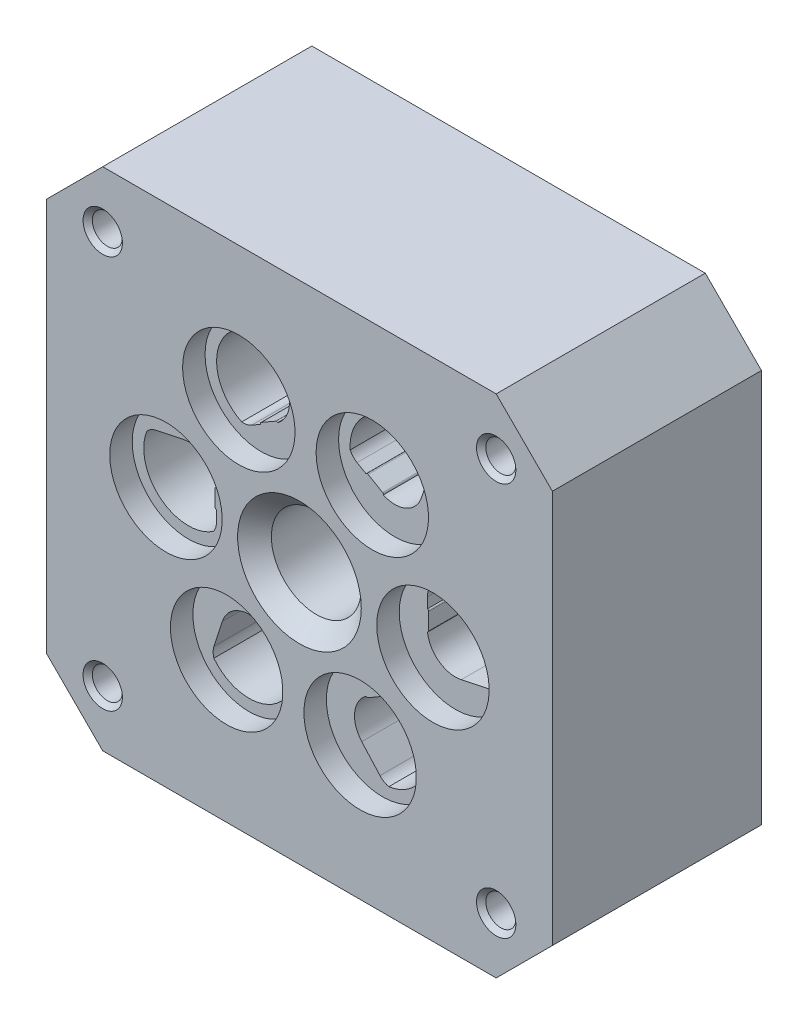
ISO-10303-21;
HEADER;
FILE_DESCRIPTION(('STEP AP214'),'2;1');
FILE_NAME('part.step','',(''),(''),'','','');
FILE_SCHEMA(('AUTOMOTIVE_DESIGN { 1 0 10303 214 1 1 1 1 }'));
ENDSEC;
DATA;
#1=APPLICATION_CONTEXT('core data for automotive mechanical design processes');
#2=APPLICATION_PROTOCOL_DEFINITION('international standard','automotive_design',2000,#1);
#3=PRODUCT_CONTEXT('',#1,'mechanical');
#4=PRODUCT('Part','Part','',(#3));
#5=PRODUCT_RELATED_PRODUCT_CATEGORY('part','',(#4));
#6=PRODUCT_DEFINITION_FORMATION('','',#4);
#7=PRODUCT_DEFINITION_CONTEXT('part definition',#1,'design');
#8=PRODUCT_DEFINITION('design','',#6,#7);
#9=PRODUCT_DEFINITION_SHAPE('','',#8);
#10=(LENGTH_UNIT() NAMED_UNIT(*) SI_UNIT(.MILLI.,.METRE.));
#11=(NAMED_UNIT(*) PLANE_ANGLE_UNIT() SI_UNIT($,.RADIAN.));
#12=(NAMED_UNIT(*) SI_UNIT($,.STERADIAN.) SOLID_ANGLE_UNIT());
#13=UNCERTAINTY_MEASURE_WITH_UNIT(LENGTH_MEASURE(1.E-05),#10,'distance_accuracy_value','');
#14=(GEOMETRIC_REPRESENTATION_CONTEXT(3) GLOBAL_UNCERTAINTY_ASSIGNED_CONTEXT((#13)) GLOBAL_UNIT_ASSIGNED_CONTEXT((#10,
#11,#12)) REPRESENTATION_CONTEXT('',''));
#15=CARTESIAN_POINT('',(0.,0.,0.));
#16=DIRECTION('',(0.,0.,1.));
#17=DIRECTION('',(1.,0.,0.));
#18=AXIS2_PLACEMENT_3D('',#15,#16,#17);
#19=CARTESIAN_POINT('',(80.,9.99700000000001,19.2000000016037));
#20=DIRECTION('',(0.,0.,1.));
#21=DIRECTION('',(1.,0.,0.));
#22=AXIS2_PLACEMENT_3D('',#19,#20,#21);
#23=CONICAL_SURFACE('',#22,2.67499999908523,1.02974425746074);
#24=CARTESIAN_POINT('',(79.9999999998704,9.99700000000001,17.5926978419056));
#25=VERTEX_POINT('',#24);
#26=VERTEX_LOOP('',#25);
#27=FACE_BOUND('',#26,.T.);
#28=CARTESIAN_POINT('',(80.,9.99700000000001,19.2));
#29=DIRECTION('',(0.,0.,1.));
#30=DIRECTION('',(1.,0.,0.));
#31=AXIS2_PLACEMENT_3D('',#28,#29,#30);
#32=CIRCLE('',#31,2.675);
#33=CARTESIAN_POINT('',(82.675,9.99700000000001,19.2));
#34=VERTEX_POINT('',#33);
#35=EDGE_CURVE('E959',#34,#34,#32,.T.);
#36=ORIENTED_EDGE('',*,*,#35,.T.);
#37=EDGE_LOOP('',(#36));
#38=FACE_BOUND('',#37,.T.);
#39=ADVANCED_FACE('F17',(#27,#38),#23,.F.);
#40=CARTESIAN_POINT('',(10.,9.99700000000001,19.2000000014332));
#41=DIRECTION('',(0.,0.,1.));
#42=DIRECTION('',(1.,0.,0.));
#43=AXIS2_PLACEMENT_3D('',#40,#41,#42);
#44=CONICAL_SURFACE('',#43,2.67499999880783,1.02974425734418);
#45=CARTESIAN_POINT('',(9.99999999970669,9.99700000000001,17.592697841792));
#46=VERTEX_POINT('',#45);
#47=VERTEX_LOOP('',#46);
#48=FACE_BOUND('',#47,.T.);
#49=CARTESIAN_POINT('',(10.,9.99700000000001,19.2));
#50=DIRECTION('',(0.,0.,1.));
#51=DIRECTION('',(1.,0.,0.));
#52=AXIS2_PLACEMENT_3D('',#49,#50,#51);
#53=CIRCLE('',#52,2.675);
#54=CARTESIAN_POINT('',(12.675,9.99700000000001,19.2));
#55=VERTEX_POINT('',#54);
#56=EDGE_CURVE('E954',#55,#55,#53,.T.);
#57=ORIENTED_EDGE('',*,*,#56,.T.);
#58=EDGE_LOOP('',(#57));
#59=FACE_BOUND('',#58,.T.);
#60=ADVANCED_FACE('F1474',(#48,#59),#44,.F.);
#61=CARTESIAN_POINT('',(80.,79.997,19.2000000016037));
#62=DIRECTION('',(0.,0.,1.));
#63=DIRECTION('',(1.,0.,0.));
#64=AXIS2_PLACEMENT_3D('',#61,#62,#63);
#65=CONICAL_SURFACE('',#64,2.67499999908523,1.02974425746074);
#66=CARTESIAN_POINT('',(79.9999999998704,79.997,17.5926978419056));
#67=VERTEX_POINT('',#66);
#68=VERTEX_LOOP('',#67);
#69=FACE_BOUND('',#68,.T.);
#70=CARTESIAN_POINT('',(80.,79.997,19.2));
#71=DIRECTION('',(0.,0.,1.));
#72=DIRECTION('',(1.,0.,0.));
#73=AXIS2_PLACEMENT_3D('',#70,#71,#72);
#74=CIRCLE('',#73,2.675);
#75=CARTESIAN_POINT('',(82.675,79.997,19.2));
#76=VERTEX_POINT('',#75);
#77=EDGE_CURVE('E949',#76,#76,#74,.T.);
#78=ORIENTED_EDGE('',*,*,#77,.T.);
#79=EDGE_LOOP('',(#78));
#80=FACE_BOUND('',#79,.T.);
#81=ADVANCED_FACE('F1471',(#69,#80),#65,.F.);
#82=CARTESIAN_POINT('',(10.,79.997,19.2000000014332));
#83=DIRECTION('',(0.,0.,1.));
#84=DIRECTION('',(1.,0.,0.));
#85=AXIS2_PLACEMENT_3D('',#82,#83,#84);
#86=CONICAL_SURFACE('',#85,2.67499999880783,1.02974425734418);
#87=CARTESIAN_POINT('',(9.99999999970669,79.997,17.592697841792));
#88=VERTEX_POINT('',#87);
#89=VERTEX_LOOP('',#88);
#90=FACE_BOUND('',#89,.T.);
#91=CARTESIAN_POINT('',(10.,79.997,19.2));
#92=DIRECTION('',(0.,0.,1.));
#93=DIRECTION('',(1.,0.,0.));
#94=AXIS2_PLACEMENT_3D('',#91,#92,#93);
#95=CIRCLE('',#94,2.675);
#96=CARTESIAN_POINT('',(12.675,79.997,19.2));
#97=VERTEX_POINT('',#96);
#98=EDGE_CURVE('E944',#97,#97,#95,.T.);
#99=ORIENTED_EDGE('',*,*,#98,.T.);
#100=EDGE_LOOP('',(#99));
#101=FACE_BOUND('',#100,.T.);
#102=ADVANCED_FACE('F1467',(#90,#101),#86,.F.);
#103=CARTESIAN_POINT('',(80.,9.99700000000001,28.2));
#104=DIRECTION('',(0.,0.,1.));
#105=DIRECTION('',(1.,0.,0.));
#106=AXIS2_PLACEMENT_3D('',#103,#104,#105);
#107=CYLINDRICAL_SURFACE('',#106,2.675);
#108=ORIENTED_EDGE('',*,*,#35,.F.);
#109=EDGE_LOOP('',(#108));
#110=FACE_BOUND('',#109,.T.);
#111=CARTESIAN_POINT('',(80.,9.99700000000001,36.374999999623));
#112=DIRECTION('',(0.,0.,1.));
#113=DIRECTION('',(1.,0.,0.));
#114=AXIS2_PLACEMENT_3D('',#111,#112,#113);
#115=CIRCLE('',#114,2.67500000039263);
#116=CARTESIAN_POINT('',(82.6750000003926,9.99700000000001,36.374999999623));
#117=VERTEX_POINT('',#116);
#118=EDGE_CURVE('E939',#117,#117,#115,.T.);
#119=ORIENTED_EDGE('',*,*,#118,.T.);
#120=EDGE_LOOP('',(#119));
#121=FACE_BOUND('',#120,.T.);
#122=ADVANCED_FACE('F1463',(#110,#121),#107,.F.);
#123=CARTESIAN_POINT('',(10.,9.99700000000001,28.2));
#124=DIRECTION('',(0.,0.,1.));
#125=DIRECTION('',(1.,0.,0.));
#126=AXIS2_PLACEMENT_3D('',#123,#124,#125);
#127=CYLINDRICAL_SURFACE('',#126,2.675);
#128=ORIENTED_EDGE('',*,*,#56,.F.);
#129=EDGE_LOOP('',(#128));
#130=FACE_BOUND('',#129,.T.);
#131=CARTESIAN_POINT('',(10.,9.99700000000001,36.374999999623));
#132=DIRECTION('',(0.,0.,1.));
#133=DIRECTION('',(1.,0.,0.));
#134=AXIS2_PLACEMENT_3D('',#131,#132,#133);
#135=CIRCLE('',#134,2.67500000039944);
#136=CARTESIAN_POINT('',(12.6750000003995,9.99700000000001,36.374999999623));
#137=VERTEX_POINT('',#136);
#138=EDGE_CURVE('E928',#137,#137,#135,.T.);
#139=ORIENTED_EDGE('',*,*,#138,.T.);
#140=EDGE_LOOP('',(#139));
#141=FACE_BOUND('',#140,.T.);
#142=ADVANCED_FACE('F1459',(#130,#141),#127,.F.);
#143=CARTESIAN_POINT('',(80.,79.997,28.2));
#144=DIRECTION('',(0.,0.,1.));
#145=DIRECTION('',(1.,0.,0.));
#146=AXIS2_PLACEMENT_3D('',#143,#144,#145);
#147=CYLINDRICAL_SURFACE('',#146,2.675);
#148=ORIENTED_EDGE('',*,*,#77,.F.);
#149=EDGE_LOOP('',(#148));
#150=FACE_BOUND('',#149,.T.);
#151=CARTESIAN_POINT('',(80.,79.997,36.374999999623));
#152=DIRECTION('',(0.,0.,1.));
#153=DIRECTION('',(1.,0.,0.));
#154=AXIS2_PLACEMENT_3D('',#151,#152,#153);
#155=CIRCLE('',#154,2.67500000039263);
#156=CARTESIAN_POINT('',(82.6750000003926,79.997,36.374999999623));
#157=VERTEX_POINT('',#156);
#158=EDGE_CURVE('E923',#157,#157,#155,.T.);
#159=ORIENTED_EDGE('',*,*,#158,.T.);
#160=EDGE_LOOP('',(#159));
#161=FACE_BOUND('',#160,.T.);
#162=ADVANCED_FACE('F1455',(#150,#161),#147,.F.);
#163=CARTESIAN_POINT('',(10.,79.997,28.2));
#164=DIRECTION('',(0.,0.,1.));
#165=DIRECTION('',(1.,0.,0.));
#166=AXIS2_PLACEMENT_3D('',#163,#164,#165);
#167=CYLINDRICAL_SURFACE('',#166,2.675);
#168=ORIENTED_EDGE('',*,*,#98,.F.);
#169=EDGE_LOOP('',(#168));
#170=FACE_BOUND('',#169,.T.);
#171=CARTESIAN_POINT('',(10.,79.997,36.374999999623));
#172=DIRECTION('',(0.,0.,1.));
#173=DIRECTION('',(1.,0.,0.));
#174=AXIS2_PLACEMENT_3D('',#171,#172,#173);
#175=CIRCLE('',#174,2.67500000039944);
#176=CARTESIAN_POINT('',(12.6750000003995,79.997,36.374999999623));
#177=VERTEX_POINT('',#176);
#178=EDGE_CURVE('E919',#177,#177,#175,.T.);
#179=ORIENTED_EDGE('',*,*,#178,.T.);
#180=EDGE_LOOP('',(#179));
#181=FACE_BOUND('',#180,.T.);
#182=ADVANCED_FACE('F1451',(#170,#181),#167,.F.);
#183=CARTESIAN_POINT('',(80.,9.99700000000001,37.2000000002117));
#184=DIRECTION('',(0.,0.,1.));
#185=DIRECTION('',(1.,0.,0.));
#186=AXIS2_PLACEMENT_3D('',#183,#184,#185);
#187=CONICAL_SURFACE('',#186,3.49999999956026,0.785398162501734);
#188=ORIENTED_EDGE('',*,*,#118,.F.);
#189=EDGE_LOOP('',(#188));
#190=FACE_BOUND('',#189,.T.);
#191=CARTESIAN_POINT('',(80.,9.99700000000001,37.2000000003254));
#192=DIRECTION('',(0.,0.,1.));
#193=DIRECTION('',(1.,0.,0.));
#194=AXIS2_PLACEMENT_3D('',#191,#192,#193);
#195=CIRCLE('',#194,3.49999999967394);
#196=CARTESIAN_POINT('',(83.4999999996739,9.99700000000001,37.2000000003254));
#197=VERTEX_POINT('',#196);
#198=EDGE_CURVE('E900',#197,#197,#195,.F.);
#199=ORIENTED_EDGE('',*,*,#198,.F.);
#200=EDGE_LOOP('',(#199));
#201=FACE_BOUND('',#200,.T.);
#202=ADVANCED_FACE('F1447',(#190,#201),#187,.F.);
#203=CARTESIAN_POINT('',(10.,9.99700000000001,37.2000000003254));
#204=DIRECTION('',(0.,0.,1.));
#205=DIRECTION('',(1.,0.,0.));
#206=AXIS2_PLACEMENT_3D('',#203,#204,#205);
#207=CONICAL_SURFACE('',#206,3.49999999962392,0.785398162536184);
#208=ORIENTED_EDGE('',*,*,#138,.F.);
#209=EDGE_LOOP('',(#208));
#210=FACE_BOUND('',#209,.T.);
#211=CARTESIAN_POINT('',(10.,9.99700000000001,37.2000000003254));
#212=DIRECTION('',(0.,0.,1.));
#213=DIRECTION('',(1.,0.,0.));
#214=AXIS2_PLACEMENT_3D('',#211,#212,#213);
#215=CIRCLE('',#214,3.49999999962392);
#216=CARTESIAN_POINT('',(13.4999999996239,9.99700000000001,37.2000000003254));
#217=VERTEX_POINT('',#216);
#218=EDGE_CURVE('E897',#217,#217,#215,.F.);
#219=ORIENTED_EDGE('',*,*,#218,.F.);
#220=EDGE_LOOP('',(#219));
#221=FACE_BOUND('',#220,.T.);
#222=ADVANCED_FACE('F1443',(#210,#221),#207,.F.);
#223=CARTESIAN_POINT('',(80.,79.997,37.2000000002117));
#224=DIRECTION('',(0.,0.,1.));
#225=DIRECTION('',(1.,0.,0.));
#226=AXIS2_PLACEMENT_3D('',#223,#224,#225);
#227=CONICAL_SURFACE('',#226,3.49999999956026,0.785398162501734);
#228=ORIENTED_EDGE('',*,*,#158,.F.);
#229=EDGE_LOOP('',(#228));
#230=FACE_BOUND('',#229,.T.);
#231=CARTESIAN_POINT('',(80.,79.997,37.2000000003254));
#232=DIRECTION('',(0.,0.,1.));
#233=DIRECTION('',(1.,0.,0.));
#234=AXIS2_PLACEMENT_3D('',#231,#232,#233);
#235=CIRCLE('',#234,3.49999999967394);
#236=CARTESIAN_POINT('',(83.4999999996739,79.997,37.2000000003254));
#237=VERTEX_POINT('',#236);
#238=EDGE_CURVE('E894',#237,#237,#235,.F.);
#239=ORIENTED_EDGE('',*,*,#238,.F.);
#240=EDGE_LOOP('',(#239));
#241=FACE_BOUND('',#240,.T.);
#242=ADVANCED_FACE('F1439',(#230,#241),#227,.F.);
#243=CARTESIAN_POINT('',(10.,79.997,37.2000000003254));
#244=DIRECTION('',(0.,0.,1.));
#245=DIRECTION('',(1.,0.,0.));
#246=AXIS2_PLACEMENT_3D('',#243,#244,#245);
#247=CONICAL_SURFACE('',#246,3.49999999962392,0.785398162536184);
#248=ORIENTED_EDGE('',*,*,#178,.F.);
#249=EDGE_LOOP('',(#248));
#250=FACE_BOUND('',#249,.T.);
#251=CARTESIAN_POINT('',(10.,79.997,37.2000000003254));
#252=DIRECTION('',(0.,0.,1.));
#253=DIRECTION('',(1.,0.,0.));
#254=AXIS2_PLACEMENT_3D('',#251,#252,#253);
#255=CIRCLE('',#254,3.49999999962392);
#256=CARTESIAN_POINT('',(13.4999999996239,79.997,37.2000000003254));
#257=VERTEX_POINT('',#256);
#258=EDGE_CURVE('E891',#257,#257,#255,.F.);
#259=ORIENTED_EDGE('',*,*,#258,.F.);
#260=EDGE_LOOP('',(#259));
#261=FACE_BOUND('',#260,.T.);
#262=ADVANCED_FACE('F1435',(#250,#261),#247,.F.);
#263=CARTESIAN_POINT('',(57.9580332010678,64.9398138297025,37.2));
#264=DIRECTION('',(0.,0.,-1.));
#265=DIRECTION('',(-1.,0.,0.));
#266=AXIS2_PLACEMENT_3D('',#263,#264,#265);
#267=CYLINDRICAL_SURFACE('',#266,10.);
#268=CARTESIAN_POINT('',(57.9580332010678,64.9398138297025,37.2));
#269=DIRECTION('',(0.,0.,-1.));
#270=DIRECTION('',(-1.,0.,0.));
#271=AXIS2_PLACEMENT_3D('',#268,#269,#270);
#272=CIRCLE('',#271,10.);
#273=CARTESIAN_POINT('',(47.9580332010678,64.9398138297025,37.2));
#274=VERTEX_POINT('',#273);
#275=EDGE_CURVE('E20',#274,#274,#272,.T.);
#276=ORIENTED_EDGE('',*,*,#275,.F.);
#277=EDGE_LOOP('',(#276));
#278=FACE_BOUND('',#277,.T.);
#279=CARTESIAN_POINT('',(57.9580332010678,64.9398138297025,33.2));
#280=DIRECTION('',(0.,0.,-1.));
#281=DIRECTION('',(-1.,0.,0.));
#282=AXIS2_PLACEMENT_3D('',#279,#280,#281);
#283=CIRCLE('',#282,10.);
#284=CARTESIAN_POINT('',(47.9580332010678,64.9398138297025,33.2));
#285=VERTEX_POINT('',#284);
#286=EDGE_CURVE('E882',#285,#285,#283,.T.);
#287=ORIENTED_EDGE('',*,*,#286,.T.);
#288=EDGE_LOOP('',(#287));
#289=FACE_BOUND('',#288,.T.);
#290=ADVANCED_FACE('F1431',(#278,#289),#267,.F.);
#291=CARTESIAN_POINT('',(55.7919667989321,23.8036071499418,37.2));
#292=DIRECTION('',(0.,0.,-1.));
#293=DIRECTION('',(-1.,0.,0.));
#294=AXIS2_PLACEMENT_3D('',#291,#292,#293);
#295=CYLINDRICAL_SURFACE('',#294,10.);
#296=CARTESIAN_POINT('',(55.7919667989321,23.8036071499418,37.2));
#297=DIRECTION('',(0.,0.,-1.));
#298=DIRECTION('',(-1.,0.,0.));
#299=AXIS2_PLACEMENT_3D('',#296,#297,#298);
#300=CIRCLE('',#299,10.);
#301=CARTESIAN_POINT('',(45.7919667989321,23.8036071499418,37.2));
#302=VERTEX_POINT('',#301);
#303=EDGE_CURVE('E914',#302,#302,#300,.T.);
#304=ORIENTED_EDGE('',*,*,#303,.F.);
#305=EDGE_LOOP('',(#304));
#306=FACE_BOUND('',#305,.T.);
#307=CARTESIAN_POINT('',(55.7919667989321,23.8036071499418,33.2));
#308=DIRECTION('',(0.,0.,-1.));
#309=DIRECTION('',(-1.,0.,0.));
#310=AXIS2_PLACEMENT_3D('',#307,#308,#309);
#311=CIRCLE('',#310,10.);
#312=CARTESIAN_POINT('',(45.7919667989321,23.8036071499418,33.2));
#313=VERTEX_POINT('',#312);
#314=EDGE_CURVE('E869',#313,#313,#311,.T.);
#315=ORIENTED_EDGE('',*,*,#314,.T.);
#316=EDGE_LOOP('',(#315));
#317=FACE_BOUND('',#316,.T.);
#318=ADVANCED_FACE('F1427',(#306,#317),#295,.F.);
#319=CARTESIAN_POINT('',(32.0419667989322,25.0541861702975,37.2));
#320=DIRECTION('',(0.,0.,-1.));
#321=DIRECTION('',(-1.,0.,0.));
#322=AXIS2_PLACEMENT_3D('',#319,#320,#321);
#323=CYLINDRICAL_SURFACE('',#322,10.);
#324=CARTESIAN_POINT('',(32.0419667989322,25.0541861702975,37.2));
#325=DIRECTION('',(0.,0.,-1.));
#326=DIRECTION('',(-1.,0.,0.));
#327=AXIS2_PLACEMENT_3D('',#324,#325,#326);
#328=CIRCLE('',#327,10.);
#329=CARTESIAN_POINT('',(22.0419667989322,25.0541861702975,37.2));
#330=VERTEX_POINT('',#329);
#331=EDGE_CURVE('E912',#330,#330,#328,.T.);
#332=ORIENTED_EDGE('',*,*,#331,.F.);
#333=EDGE_LOOP('',(#332));
#334=FACE_BOUND('',#333,.T.);
#335=CARTESIAN_POINT('',(32.0419667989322,25.0541861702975,33.2));
#336=DIRECTION('',(0.,0.,-1.));
#337=DIRECTION('',(-1.,0.,0.));
#338=AXIS2_PLACEMENT_3D('',#335,#336,#337);
#339=CIRCLE('',#338,10.);
#340=CARTESIAN_POINT('',(22.0419667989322,25.0541861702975,33.2));
#341=VERTEX_POINT('',#340);
#342=EDGE_CURVE('E856',#341,#341,#339,.T.);
#343=ORIENTED_EDGE('',*,*,#342,.T.);
#344=EDGE_LOOP('',(#343));
#345=FACE_BOUND('',#344,.T.);
#346=ADVANCED_FACE('F1423',(#334,#345),#323,.F.);
#347=CARTESIAN_POINT('',(68.7499999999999,43.7464209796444,37.2));
#348=DIRECTION('',(0.,0.,-1.));
#349=DIRECTION('',(-1.,0.,0.));
#350=AXIS2_PLACEMENT_3D('',#347,#348,#349);
#351=CYLINDRICAL_SURFACE('',#350,10.);
#352=CARTESIAN_POINT('',(68.7499999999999,43.7464209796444,37.2));
#353=DIRECTION('',(0.,0.,-1.));
#354=DIRECTION('',(-1.,0.,0.));
#355=AXIS2_PLACEMENT_3D('',#352,#353,#354);
#356=CIRCLE('',#355,10.);
#357=CARTESIAN_POINT('',(58.7499999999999,43.7464209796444,37.2));
#358=VERTEX_POINT('',#357);
#359=EDGE_CURVE('E909',#358,#358,#356,.T.);
#360=ORIENTED_EDGE('',*,*,#359,.F.);
#361=EDGE_LOOP('',(#360));
#362=FACE_BOUND('',#361,.T.);
#363=CARTESIAN_POINT('',(68.7499999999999,43.7464209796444,33.2));
#364=DIRECTION('',(0.,0.,-1.));
#365=DIRECTION('',(-1.,0.,0.));
#366=AXIS2_PLACEMENT_3D('',#363,#364,#365);
#367=CIRCLE('',#366,10.);
#368=CARTESIAN_POINT('',(58.7499999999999,43.7464209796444,33.2));
#369=VERTEX_POINT('',#368);
#370=EDGE_CURVE('E843',#369,#369,#367,.T.);
#371=ORIENTED_EDGE('',*,*,#370,.T.);
#372=EDGE_LOOP('',(#371));
#373=FACE_BOUND('',#372,.T.);
#374=ADVANCED_FACE('F1419',(#362,#373),#351,.F.);
#375=CARTESIAN_POINT('',(34.2080332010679,66.1903928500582,37.2));
#376=DIRECTION('',(0.,0.,-1.));
#377=DIRECTION('',(-1.,0.,0.));
#378=AXIS2_PLACEMENT_3D('',#375,#376,#377);
#379=CYLINDRICAL_SURFACE('',#378,10.);
#380=CARTESIAN_POINT('',(34.2080332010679,66.1903928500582,37.2));
#381=DIRECTION('',(0.,0.,-1.));
#382=DIRECTION('',(-1.,0.,0.));
#383=AXIS2_PLACEMENT_3D('',#380,#381,#382);
#384=CIRCLE('',#383,10.);
#385=CARTESIAN_POINT('',(24.2080332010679,66.1903928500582,37.2));
#386=VERTEX_POINT('',#385);
#387=EDGE_CURVE('E906',#386,#386,#384,.T.);
#388=ORIENTED_EDGE('',*,*,#387,.F.);
#389=EDGE_LOOP('',(#388));
#390=FACE_BOUND('',#389,.T.);
#391=CARTESIAN_POINT('',(34.2080332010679,66.1903928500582,33.2));
#392=DIRECTION('',(0.,0.,-1.));
#393=DIRECTION('',(-1.,0.,0.));
#394=AXIS2_PLACEMENT_3D('',#391,#392,#393);
#395=CIRCLE('',#394,10.);
#396=CARTESIAN_POINT('',(24.2080332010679,66.1903928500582,33.2));
#397=VERTEX_POINT('',#396);
#398=EDGE_CURVE('E830',#397,#397,#395,.T.);
#399=ORIENTED_EDGE('',*,*,#398,.T.);
#400=EDGE_LOOP('',(#399));
#401=FACE_BOUND('',#400,.T.);
#402=ADVANCED_FACE('F1415',(#390,#401),#379,.F.);
#403=CARTESIAN_POINT('',(21.2500000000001,46.2475790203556,37.2));
#404=DIRECTION('',(0.,0.,-1.));
#405=DIRECTION('',(-1.,0.,0.));
#406=AXIS2_PLACEMENT_3D('',#403,#404,#405);
#407=CYLINDRICAL_SURFACE('',#406,10.);
#408=CARTESIAN_POINT('',(21.2500000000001,46.2475790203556,37.2));
#409=DIRECTION('',(0.,0.,-1.));
#410=DIRECTION('',(-1.,0.,0.));
#411=AXIS2_PLACEMENT_3D('',#408,#409,#410);
#412=CIRCLE('',#411,10.);
#413=CARTESIAN_POINT('',(11.2500000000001,46.2475790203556,37.2));
#414=VERTEX_POINT('',#413);
#415=EDGE_CURVE('E903',#414,#414,#412,.T.);
#416=ORIENTED_EDGE('',*,*,#415,.F.);
#417=EDGE_LOOP('',(#416));
#418=FACE_BOUND('',#417,.T.);
#419=CARTESIAN_POINT('',(21.2500000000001,46.2475790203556,33.2));
#420=DIRECTION('',(0.,0.,-1.));
#421=DIRECTION('',(-1.,0.,0.));
#422=AXIS2_PLACEMENT_3D('',#419,#420,#421);
#423=CIRCLE('',#422,10.);
#424=CARTESIAN_POINT('',(11.2500000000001,46.2475790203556,33.2));
#425=VERTEX_POINT('',#424);
#426=EDGE_CURVE('E817',#425,#425,#423,.T.);
#427=ORIENTED_EDGE('',*,*,#426,.T.);
#428=EDGE_LOOP('',(#427));
#429=FACE_BOUND('',#428,.T.);
#430=ADVANCED_FACE('F1411',(#418,#429),#407,.F.);
#431=CARTESIAN_POINT('',(44.9985,44.9985,37.2));
#432=DIRECTION('',(0.,0.,1.));
#433=DIRECTION('',(1.,0.,0.));
#434=AXIS2_PLACEMENT_3D('',#431,#432,#433);
#435=PLANE('',#434);
#436=CARTESIAN_POINT('',(45.,44.997,37.2000000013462));
#437=DIRECTION('',(0.,0.,1.));
#438=DIRECTION('',(1.,0.,0.));
#439=AXIS2_PLACEMENT_3D('',#436,#437,#438);
#440=CIRCLE('',#439,10.9999999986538);
#441=CARTESIAN_POINT('',(55.9999999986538,44.997,37.2000000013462));
#442=VERTEX_POINT('',#441);
#443=EDGE_CURVE('E888',#442,#442,#440,.F.);
#444=ORIENTED_EDGE('',*,*,#443,.T.);
#445=EDGE_LOOP('',(#444));
#446=FACE_BOUND('',#445,.T.);
#447=ORIENTED_EDGE('',*,*,#258,.T.);
#448=EDGE_LOOP('',(#447));
#449=FACE_BOUND('',#448,.T.);
#450=ORIENTED_EDGE('',*,*,#238,.T.);
#451=EDGE_LOOP('',(#450));
#452=FACE_BOUND('',#451,.T.);
#453=ORIENTED_EDGE('',*,*,#218,.T.);
#454=EDGE_LOOP('',(#453));
#455=FACE_BOUND('',#454,.T.);
#456=ORIENTED_EDGE('',*,*,#198,.T.);
#457=EDGE_LOOP('',(#456));
#458=FACE_BOUND('',#457,.T.);
#459=ORIENTED_EDGE('',*,*,#415,.T.);
#460=EDGE_LOOP('',(#459));
#461=FACE_BOUND('',#460,.T.);
#462=ORIENTED_EDGE('',*,*,#387,.T.);
#463=EDGE_LOOP('',(#462));
#464=FACE_BOUND('',#463,.T.);
#465=ORIENTED_EDGE('',*,*,#359,.T.);
#466=EDGE_LOOP('',(#465));
#467=FACE_BOUND('',#466,.T.);
#468=ORIENTED_EDGE('',*,*,#331,.T.);
#469=EDGE_LOOP('',(#468));
#470=FACE_BOUND('',#469,.T.);
#471=ORIENTED_EDGE('',*,*,#303,.T.);
#472=EDGE_LOOP('',(#471));
#473=FACE_BOUND('',#472,.T.);
#474=ORIENTED_EDGE('',*,*,#275,.T.);
#475=EDGE_LOOP('',(#474));
#476=FACE_BOUND('',#475,.T.);
#477=DIRECTION('',(0.707106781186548,0.707106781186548,0.));
#478=VECTOR('',#477,1.);
#479=CARTESIAN_POINT('',(84.997,5.,37.2));
#480=LINE('',#479,#478);
#481=CARTESIAN_POINT('',(89.997,10.,37.2));
#482=VERTEX_POINT('',#481);
#483=CARTESIAN_POINT('',(79.997,0.,37.2));
#484=VERTEX_POINT('',#483);
#485=EDGE_CURVE('E1503',#482,#484,#480,.F.);
#486=ORIENTED_EDGE('',*,*,#485,.F.);
#487=DIRECTION('',(0.,1.,0.));
#488=VECTOR('',#487,1.);
#489=CARTESIAN_POINT('',(89.997,89.997,37.2));
#490=LINE('',#489,#488);
#491=CARTESIAN_POINT('',(89.997,79.997,37.2));
#492=VERTEX_POINT('',#491);
#493=EDGE_CURVE('E1506',#492,#482,#490,.F.);
#494=ORIENTED_EDGE('',*,*,#493,.F.);
#495=DIRECTION('',(-0.707106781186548,0.707106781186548,0.));
#496=VECTOR('',#495,1.);
#497=CARTESIAN_POINT('',(84.997,84.997,37.2));
#498=LINE('',#497,#496);
#499=CARTESIAN_POINT('',(79.997,89.997,37.2));
#500=VERTEX_POINT('',#499);
#501=EDGE_CURVE('E1523',#500,#492,#498,.F.);
#502=ORIENTED_EDGE('',*,*,#501,.F.);
#503=DIRECTION('',(1.,0.,0.));
#504=VECTOR('',#503,1.);
#505=CARTESIAN_POINT('',(0.,89.997,37.2));
#506=LINE('',#505,#504);
#507=CARTESIAN_POINT('',(9.99999999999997,89.997,37.2));
#508=VERTEX_POINT('',#507);
#509=EDGE_CURVE('E813',#508,#500,#506,.T.);
#510=ORIENTED_EDGE('',*,*,#509,.F.);
#511=DIRECTION('',(-0.707106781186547,-0.707106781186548,0.));
#512=VECTOR('',#511,1.);
#513=CARTESIAN_POINT('',(4.99999999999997,84.997,37.2));
#514=LINE('',#513,#512);
#515=CARTESIAN_POINT('',(0.,79.997,37.2));
#516=VERTEX_POINT('',#515);
#517=EDGE_CURVE('E1546',#516,#508,#514,.F.);
#518=ORIENTED_EDGE('',*,*,#517,.F.);
#519=DIRECTION('',(0.,1.,0.));
#520=VECTOR('',#519,1.);
#521=CARTESIAN_POINT('',(0.,0.,37.2));
#522=LINE('',#521,#520);
#523=CARTESIAN_POINT('',(0.,10.,37.2));
#524=VERTEX_POINT('',#523);
#525=EDGE_CURVE('E1541',#524,#516,#522,.T.);
#526=ORIENTED_EDGE('',*,*,#525,.F.);
#527=DIRECTION('',(0.707106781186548,-0.707106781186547,0.));
#528=VECTOR('',#527,1.);
#529=CARTESIAN_POINT('',(5.,5.,37.2));
#530=LINE('',#529,#528);
#531=CARTESIAN_POINT('',(10.,0.,37.2));
#532=VERTEX_POINT('',#531);
#533=EDGE_CURVE('E1536',#532,#524,#530,.F.);
#534=ORIENTED_EDGE('',*,*,#533,.F.);
#535=DIRECTION('',(1.,0.,0.));
#536=VECTOR('',#535,1.);
#537=CARTESIAN_POINT('',(89.997,0.,37.2));
#538=LINE('',#537,#536);
#539=EDGE_CURVE('E1509',#484,#532,#538,.F.);
#540=ORIENTED_EDGE('',*,*,#539,.F.);
#541=EDGE_LOOP('',(#486,#494,#502,#510,#518,#526,#534,#540));
#542=FACE_BOUND('',#541,.T.);
#543=ADVANCED_FACE('F1407',(#446,#449,#452,#455,#458,#461,#464,#467,#470,#473,#476,#542),#435,.T.);
#544=CARTESIAN_POINT('',(45.,44.997,37.2000000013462));
#545=DIRECTION('',(0.,0.,1.));
#546=DIRECTION('',(1.,0.,0.));
#547=AXIS2_PLACEMENT_3D('',#544,#545,#546);
#548=CONICAL_SURFACE('',#547,10.9999999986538,0.7853981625);
#549=CARTESIAN_POINT('',(45.,44.997,34.2));
#550=DIRECTION('',(0.,0.,1.));
#551=DIRECTION('',(1.,0.,0.));
#552=AXIS2_PLACEMENT_3D('',#549,#550,#551);
#553=CIRCLE('',#552,8.);
#554=CARTESIAN_POINT('',(53.,44.997,34.2));
#555=VERTEX_POINT('',#554);
#556=EDGE_CURVE('E651',#555,#555,#553,.F.);
#557=ORIENTED_EDGE('',*,*,#556,.T.);
#558=EDGE_LOOP('',(#557));
#559=FACE_BOUND('',#558,.T.);
#560=ORIENTED_EDGE('',*,*,#443,.F.);
#561=EDGE_LOOP('',(#560));
#562=FACE_BOUND('',#561,.T.);
#563=ADVANCED_FACE('F1403',(#559,#562),#548,.F.);
#564=CARTESIAN_POINT('',(55.6745395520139,60.4846868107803,0.));
#565=DIRECTION('',(0.,0.,1.));
#566=DIRECTION('',(1.,0.,0.));
#567=AXIS2_PLACEMENT_3D('',#564,#565,#566);
#568=CYLINDRICAL_SURFACE('',#567,0.249999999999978);
#569=CARTESIAN_POINT('',(55.6745395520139,60.4846868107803,0.));
#570=DIRECTION('',(0.,0.,1.));
#571=DIRECTION('',(1.,0.,0.));
#572=AXIS2_PLACEMENT_3D('',#569,#570,#571);
#573=CIRCLE('',#572,0.249999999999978);
#574=CARTESIAN_POINT('',(55.9024348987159,60.3819068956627,0.));
#575=VERTEX_POINT('',#574);
#576=CARTESIAN_POINT('',(55.7995395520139,60.7011931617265,0.));
#577=VERTEX_POINT('',#576);
#578=EDGE_CURVE('E228',#575,#577,#573,.T.);
#579=ORIENTED_EDGE('',*,*,#578,.T.);
#580=DIRECTION('',(0.,0.,1.));
#581=VECTOR('',#580,1.);
#582=CARTESIAN_POINT('',(55.7995395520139,60.7011931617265,0.));
#583=LINE('',#582,#581);
#584=CARTESIAN_POINT('',(55.7995395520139,60.7011931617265,33.2));
#585=VERTEX_POINT('',#584);
#586=EDGE_CURVE('E636',#577,#585,#583,.T.);
#587=ORIENTED_EDGE('',*,*,#586,.T.);
#588=CARTESIAN_POINT('',(55.6745395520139,60.4846868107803,33.2));
#589=DIRECTION('',(0.,0.,1.));
#590=DIRECTION('',(1.,0.,0.));
#591=AXIS2_PLACEMENT_3D('',#588,#589,#590);
#592=CIRCLE('',#591,0.249999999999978);
#593=CARTESIAN_POINT('',(55.9024348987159,60.3819068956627,33.2));
#594=VERTEX_POINT('',#593);
#595=EDGE_CURVE('E876',#585,#594,#592,.F.);
#596=ORIENTED_EDGE('',*,*,#595,.T.);
#597=DIRECTION('',(0.,0.,1.));
#598=VECTOR('',#597,1.);
#599=CARTESIAN_POINT('',(55.9024348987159,60.3819068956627,0.));
#600=LINE('',#599,#598);
#601=EDGE_CURVE('E643',#594,#575,#600,.F.);
#602=ORIENTED_EDGE('',*,*,#601,.T.);
#603=EDGE_LOOP('',(#579,#587,#596,#602));
#604=FACE_BOUND('',#603,.T.);
#605=ADVANCED_FACE('F1399',(#604),#568,.T.);
#606=CARTESIAN_POINT('',(53.0754604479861,61.9852658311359,0.));
#607=DIRECTION('',(0.,0.,1.));
#608=DIRECTION('',(1.,0.,0.));
#609=AXIS2_PLACEMENT_3D('',#606,#607,#608);
#610=CYLINDRICAL_SURFACE('',#609,0.249999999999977);
#611=CARTESIAN_POINT('',(53.0754604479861,61.9852658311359,0.));
#612=DIRECTION('',(0.,0.,1.));
#613=DIRECTION('',(1.,0.,0.));
#614=AXIS2_PLACEMENT_3D('',#611,#612,#613);
#615=CIRCLE('',#614,0.249999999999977);
#616=CARTESIAN_POINT('',(53.2004604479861,62.2017721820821,0.));
#617=VERTEX_POINT('',#616);
#618=CARTESIAN_POINT('',(52.85895409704,62.110265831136,0.));
#619=VERTEX_POINT('',#618);
#620=EDGE_CURVE('E885',#617,#619,#615,.T.);
#621=ORIENTED_EDGE('',*,*,#620,.T.);
#622=DIRECTION('',(0.,0.,1.));
#623=VECTOR('',#622,1.);
#624=CARTESIAN_POINT('',(52.85895409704,62.110265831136,0.));
#625=LINE('',#624,#623);
#626=CARTESIAN_POINT('',(52.85895409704,62.110265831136,33.2));
#627=VERTEX_POINT('',#626);
#628=EDGE_CURVE('E632',#619,#627,#625,.T.);
#629=ORIENTED_EDGE('',*,*,#628,.T.);
#630=CARTESIAN_POINT('',(53.0754604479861,61.9852658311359,33.2));
#631=DIRECTION('',(0.,0.,1.));
#632=DIRECTION('',(1.,0.,0.));
#633=AXIS2_PLACEMENT_3D('',#630,#631,#632);
#634=CIRCLE('',#633,0.249999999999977);
#635=CARTESIAN_POINT('',(53.2004604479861,62.2017721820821,33.2));
#636=VERTEX_POINT('',#635);
#637=EDGE_CURVE('E879',#627,#636,#634,.F.);
#638=ORIENTED_EDGE('',*,*,#637,.T.);
#639=DIRECTION('',(0.,0.,1.));
#640=VECTOR('',#639,1.);
#641=CARTESIAN_POINT('',(53.2004604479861,62.2017721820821,0.));
#642=LINE('',#641,#640);
#643=EDGE_CURVE('E639',#636,#617,#642,.F.);
#644=ORIENTED_EDGE('',*,*,#643,.T.);
#645=EDGE_LOOP('',(#621,#629,#638,#644));
#646=FACE_BOUND('',#645,.T.);
#647=ADVANCED_FACE('F1393',(#646),#610,.T.);
#648=CARTESIAN_POINT('',(57.9580332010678,64.9398138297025,33.2));
#649=DIRECTION('',(0.,0.,-1.));
#650=DIRECTION('',(-1.,0.,0.));
#651=AXIS2_PLACEMENT_3D('',#648,#649,#650);
#652=PLANE('',#651);
#653=DIRECTION('',(0.866025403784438,-0.500000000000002,0.));
#654=VECTOR('',#653,1.);
#655=CARTESIAN_POINT('',(55.7995395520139,60.7011931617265,33.2));
#656=LINE('',#655,#654);
#657=EDGE_CURVE('E635',#585,#636,#656,.F.);
#658=ORIENTED_EDGE('',*,*,#657,.T.);
#659=ORIENTED_EDGE('',*,*,#637,.F.);
#660=DIRECTION('',(0.866025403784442,-0.499999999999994,0.));
#661=VECTOR('',#660,1.);
#662=CARTESIAN_POINT('',(52.85895409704,62.110265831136,33.2));
#663=LINE('',#662,#661);
#664=CARTESIAN_POINT('',(51.2542402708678,63.0367477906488,33.2));
#665=VERTEX_POINT('',#664);
#666=EDGE_CURVE('E631',#627,#665,#663,.F.);
#667=ORIENTED_EDGE('',*,*,#666,.T.);
#668=CARTESIAN_POINT('',(52.7542402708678,65.6348240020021,33.2));
#669=DIRECTION('',(0.,0.,1.));
#670=DIRECTION('',(1.,0.,0.));
#671=AXIS2_PLACEMENT_3D('',#668,#669,#670);
#672=CIRCLE('',#671,3.00000000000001);
#673=CARTESIAN_POINT('',(50.0274948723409,64.3838805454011,33.2));
#674=VERTEX_POINT('',#673);
#675=EDGE_CURVE('E624',#665,#674,#672,.F.);
#676=ORIENTED_EDGE('',*,*,#675,.T.);
#677=CARTESIAN_POINT('',(57.9580332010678,64.9398138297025,33.2));
#678=DIRECTION('',(0.,0.,1.));
#679=DIRECTION('',(1.,0.,0.));
#680=AXIS2_PLACEMENT_3D('',#677,#678,#679);
#681=CIRCLE('',#680,7.95000000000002);
#682=CARTESIAN_POINT('',(64.223563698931,69.8332408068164,33.2));
#683=VERTEX_POINT('',#682);
#684=EDGE_CURVE('E627',#674,#683,#681,.F.);
#685=ORIENTED_EDGE('',*,*,#684,.T.);
#686=CARTESIAN_POINT('',(61.3601524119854,68.9383241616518,33.2));
#687=DIRECTION('',(0.,0.,1.));
#688=DIRECTION('',(1.,0.,0.));
#689=AXIS2_PLACEMENT_3D('',#686,#687,#688);
#690=CIRCLE('',#689,3.00000000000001);
#691=CARTESIAN_POINT('',(64.2133219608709,68.011273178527,33.2));
#692=VERTEX_POINT('',#691);
#693=EDGE_CURVE('E650',#683,#692,#690,.F.);
#694=ORIENTED_EDGE('',*,*,#693,.T.);
#695=DIRECTION('',(0.309016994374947,0.951056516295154,0.));
#696=VECTOR('',#695,1.);
#697=CARTESIAN_POINT('',(64.2133219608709,68.0112731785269,33.2));
#698=LINE('',#697,#696);
#699=CARTESIAN_POINT('',(62.7133157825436,63.3947288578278,33.2));
#700=VERTEX_POINT('',#699);
#701=EDGE_CURVE('E645',#692,#700,#698,.F.);
#702=ORIENTED_EDGE('',*,*,#701,.T.);
#703=CARTESIAN_POINT('',(57.9580332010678,64.9398138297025,33.2));
#704=DIRECTION('',(0.,0.,1.));
#705=DIRECTION('',(1.,0.,0.));
#706=AXIS2_PLACEMENT_3D('',#703,#704,#705);
#707=CIRCLE('',#706,5.00000000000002);
#708=EDGE_CURVE('E642',#700,#594,#707,.F.);
#709=ORIENTED_EDGE('',*,*,#708,.T.);
#710=ORIENTED_EDGE('',*,*,#595,.F.);
#711=EDGE_LOOP('',(#658,#659,#667,#676,#685,#694,#702,#709,#710));
#712=FACE_BOUND('',#711,.T.);
#713=ORIENTED_EDGE('',*,*,#286,.F.);
#714=EDGE_LOOP('',(#713));
#715=FACE_BOUND('',#714,.T.);
#716=ADVANCED_FACE('F1247',(#712,#715),#652,.F.);
#717=CARTESIAN_POINT('',(53.075460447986,28.008734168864,0.));
#718=DIRECTION('',(0.,0.,1.));
#719=DIRECTION('',(1.,0.,0.));
#720=AXIS2_PLACEMENT_3D('',#717,#718,#719);
#721=CYLINDRICAL_SURFACE('',#720,0.249999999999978);
#722=CARTESIAN_POINT('',(53.075460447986,28.008734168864,0.));
#723=DIRECTION('',(0.,0.,1.));
#724=DIRECTION('',(1.,0.,0.));
#725=AXIS2_PLACEMENT_3D('',#722,#723,#724);
#726=CIRCLE('',#725,0.249999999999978);
#727=CARTESIAN_POINT('',(52.8725027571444,27.8627609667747,0.));
#728=VERTEX_POINT('',#727);
#729=CARTESIAN_POINT('',(53.200460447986,27.7922278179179,0.));
#730=VERTEX_POINT('',#729);
#731=EDGE_CURVE('E874',#728,#730,#726,.T.);
#732=ORIENTED_EDGE('',*,*,#731,.T.);
#733=DIRECTION('',(0.,0.,1.));
#734=VECTOR('',#733,1.);
#735=CARTESIAN_POINT('',(53.200460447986,27.7922278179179,0.));
#736=LINE('',#735,#734);
#737=CARTESIAN_POINT('',(53.200460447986,27.7922278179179,33.2));
#738=VERTEX_POINT('',#737);
#739=EDGE_CURVE('E602',#730,#738,#736,.T.);
#740=ORIENTED_EDGE('',*,*,#739,.T.);
#741=CARTESIAN_POINT('',(53.075460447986,28.008734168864,33.2));
#742=DIRECTION('',(0.,0.,1.));
#743=DIRECTION('',(1.,0.,0.));
#744=AXIS2_PLACEMENT_3D('',#741,#742,#743);
#745=CIRCLE('',#744,0.249999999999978);
#746=CARTESIAN_POINT('',(52.8725027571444,27.8627609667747,33.2));
#747=VERTEX_POINT('',#746);
#748=EDGE_CURVE('E863',#738,#747,#745,.F.);
#749=ORIENTED_EDGE('',*,*,#748,.T.);
#750=DIRECTION('',(0.,0.,1.));
#751=VECTOR('',#750,1.);
#752=CARTESIAN_POINT('',(52.8725027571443,27.8627609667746,0.));
#753=LINE('',#752,#751);
#754=EDGE_CURVE('E609',#747,#728,#753,.F.);
#755=ORIENTED_EDGE('',*,*,#754,.T.);
#756=EDGE_LOOP('',(#732,#740,#749,#755));
#757=FACE_BOUND('',#756,.T.);
#758=ADVANCED_FACE('F1385',(#757),#721,.T.);
#759=CARTESIAN_POINT('',(55.6745395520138,29.5093131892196,0.));
#760=DIRECTION('',(0.,0.,1.));
#761=DIRECTION('',(1.,0.,0.));
#762=AXIS2_PLACEMENT_3D('',#759,#760,#761);
#763=CYLINDRICAL_SURFACE('',#762,0.249999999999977);
#764=CARTESIAN_POINT('',(55.6745395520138,29.5093131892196,0.));
#765=DIRECTION('',(0.,0.,1.));
#766=DIRECTION('',(1.,0.,0.));
#767=AXIS2_PLACEMENT_3D('',#764,#765,#766);
#768=CIRCLE('',#767,0.249999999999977);
#769=CARTESIAN_POINT('',(55.7995395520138,29.2928068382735,0.));
#770=VERTEX_POINT('',#769);
#771=CARTESIAN_POINT('',(55.89104590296,29.6343131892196,0.));
#772=VERTEX_POINT('',#771);
#773=EDGE_CURVE('E872',#770,#772,#768,.T.);
#774=ORIENTED_EDGE('',*,*,#773,.T.);
#775=DIRECTION('',(0.,0.,1.));
#776=VECTOR('',#775,1.);
#777=CARTESIAN_POINT('',(55.89104590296,29.6343131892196,0.));
#778=LINE('',#777,#776);
#779=CARTESIAN_POINT('',(55.89104590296,29.6343131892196,33.2));
#780=VERTEX_POINT('',#779);
#781=EDGE_CURVE('E598',#772,#780,#778,.T.);
#782=ORIENTED_EDGE('',*,*,#781,.T.);
#783=CARTESIAN_POINT('',(55.6745395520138,29.5093131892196,33.2));
#784=DIRECTION('',(0.,0.,1.));
#785=DIRECTION('',(1.,0.,0.));
#786=AXIS2_PLACEMENT_3D('',#783,#784,#785);
#787=CIRCLE('',#786,0.249999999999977);
#788=CARTESIAN_POINT('',(55.7995395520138,29.2928068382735,33.2));
#789=VERTEX_POINT('',#788);
#790=EDGE_CURVE('E866',#780,#789,#787,.F.);
#791=ORIENTED_EDGE('',*,*,#790,.T.);
#792=DIRECTION('',(0.,0.,1.));
#793=VECTOR('',#792,1.);
#794=CARTESIAN_POINT('',(55.7995395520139,29.2928068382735,0.));
#795=LINE('',#794,#793);
#796=EDGE_CURVE('E605',#789,#770,#795,.F.);
#797=ORIENTED_EDGE('',*,*,#796,.T.);
#798=EDGE_LOOP('',(#774,#782,#791,#797));
#799=FACE_BOUND('',#798,.T.);
#800=ADVANCED_FACE('F1380',(#799),#763,.T.);
#801=CARTESIAN_POINT('',(55.7919667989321,23.8036071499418,33.2));
#802=DIRECTION('',(0.,0.,-1.));
#803=DIRECTION('',(-1.,0.,0.));
#804=AXIS2_PLACEMENT_3D('',#801,#802,#803);
#805=PLANE('',#804);
#806=DIRECTION('',(-0.86602540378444,-0.499999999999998,0.));
#807=VECTOR('',#806,1.);
#808=CARTESIAN_POINT('',(53.200460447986,27.7922278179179,33.2));
#809=LINE('',#808,#807);
#810=EDGE_CURVE('E601',#738,#789,#809,.F.);
#811=ORIENTED_EDGE('',*,*,#810,.T.);
#812=ORIENTED_EDGE('',*,*,#790,.F.);
#813=DIRECTION('',(-0.866025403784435,-0.500000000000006,0.));
#814=VECTOR('',#813,1.);
#815=CARTESIAN_POINT('',(55.89104590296,29.6343131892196,33.2));
#816=LINE('',#815,#814);
#817=CARTESIAN_POINT('',(57.4957597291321,30.5607951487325,33.2));
#818=VERTEX_POINT('',#817);
#819=EDGE_CURVE('E597',#780,#818,#816,.F.);
#820=ORIENTED_EDGE('',*,*,#819,.T.);
#821=CARTESIAN_POINT('',(58.9957597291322,27.9627189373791,33.2));
#822=DIRECTION('',(0.,0.,1.));
#823=DIRECTION('',(1.,0.,0.));
#824=AXIS2_PLACEMENT_3D('',#821,#822,#823);
#825=CIRCLE('',#824,3.00000000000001);
#826=CARTESIAN_POINT('',(59.2757836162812,30.9496214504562,33.2));
#827=VERTEX_POINT('',#826);
#828=EDGE_CURVE('E590',#818,#827,#825,.F.);
#829=ORIENTED_EDGE('',*,*,#828,.T.);
#830=CARTESIAN_POINT('',(55.7919667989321,23.8036071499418,33.2));
#831=DIRECTION('',(0.,0.,1.));
#832=DIRECTION('',(1.,0.,0.));
#833=AXIS2_PLACEMENT_3D('',#830,#831,#832);
#834=CIRCLE('',#833,7.95000000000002);
#835=CARTESIAN_POINT('',(56.8970336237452,15.9307850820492,33.2));
#836=VERTEX_POINT('',#835);
#837=EDGE_CURVE('E593',#827,#836,#834,.F.);
#838=ORIENTED_EDGE('',*,*,#837,.T.);
#839=CARTESIAN_POINT('',(57.5537187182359,18.8580303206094,33.2));
#840=DIRECTION('',(0.,0.,1.));
#841=DIRECTION('',(1.,0.,0.));
#842=AXIS2_PLACEMENT_3D('',#839,#840,#841);
#843=CIRCLE('',#842,3.00000000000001);
#844=CARTESIAN_POINT('',(55.3242842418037,16.8506385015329,33.2));
#845=VERTEX_POINT('',#844);
#846=EDGE_CURVE('E619',#836,#845,#843,.F.);
#847=ORIENTED_EDGE('',*,*,#846,.T.);
#848=DIRECTION('',(0.669130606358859,-0.743144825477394,0.));
#849=VECTOR('',#848,1.);
#850=CARTESIAN_POINT('',(55.3242842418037,16.8506385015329,33.2));
#851=LINE('',#850,#849);
#852=CARTESIAN_POINT('',(52.0762426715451,20.4579541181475,33.2));
#853=VERTEX_POINT('',#852);
#854=EDGE_CURVE('E613',#845,#853,#851,.F.);
#855=ORIENTED_EDGE('',*,*,#854,.T.);
#856=CARTESIAN_POINT('',(55.7919667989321,23.8036071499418,33.2));
#857=DIRECTION('',(0.,0.,1.));
#858=DIRECTION('',(1.,0.,0.));
#859=AXIS2_PLACEMENT_3D('',#856,#857,#858);
#860=CIRCLE('',#859,5.00000000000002);
#861=EDGE_CURVE('E608',#853,#747,#860,.F.);
#862=ORIENTED_EDGE('',*,*,#861,.T.);
#863=ORIENTED_EDGE('',*,*,#748,.F.);
#864=EDGE_LOOP('',(#811,#812,#820,#829,#838,#847,#855,#862,#863));
#865=FACE_BOUND('',#864,.T.);
#866=ORIENTED_EDGE('',*,*,#314,.F.);
#867=EDGE_LOOP('',(#866));
#868=FACE_BOUND('',#867,.T.);
#869=ADVANCED_FACE('F1352',(#865,#868),#805,.F.);
#870=CARTESIAN_POINT('',(34.3254604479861,29.5093131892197,0.));
#871=DIRECTION('',(0.,0.,1.));
#872=DIRECTION('',(1.,0.,0.));
#873=AXIS2_PLACEMENT_3D('',#870,#871,#872);
#874=CYLINDRICAL_SURFACE('',#873,0.249999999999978);
#875=CARTESIAN_POINT('',(34.3254604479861,29.5093131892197,0.));
#876=DIRECTION('',(0.,0.,1.));
#877=DIRECTION('',(1.,0.,0.));
#878=AXIS2_PLACEMENT_3D('',#875,#876,#877);
#879=CIRCLE('',#878,0.249999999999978);
#880=CARTESIAN_POINT('',(34.0975651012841,29.6120931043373,0.));
#881=VERTEX_POINT('',#880);
#882=CARTESIAN_POINT('',(34.2004604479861,29.2928068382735,0.));
#883=VERTEX_POINT('',#882);
#884=EDGE_CURVE('E861',#881,#883,#879,.T.);
#885=ORIENTED_EDGE('',*,*,#884,.T.);
#886=DIRECTION('',(0.,0.,1.));
#887=VECTOR('',#886,1.);
#888=CARTESIAN_POINT('',(34.2004604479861,29.2928068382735,0.));
#889=LINE('',#888,#887);
#890=CARTESIAN_POINT('',(34.2004604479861,29.2928068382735,33.2));
#891=VERTEX_POINT('',#890);
#892=EDGE_CURVE('E568',#883,#891,#889,.T.);
#893=ORIENTED_EDGE('',*,*,#892,.T.);
#894=CARTESIAN_POINT('',(34.3254604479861,29.5093131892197,33.2));
#895=DIRECTION('',(0.,0.,1.));
#896=DIRECTION('',(1.,0.,0.));
#897=AXIS2_PLACEMENT_3D('',#894,#895,#896);
#898=CIRCLE('',#897,0.249999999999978);
#899=CARTESIAN_POINT('',(34.0975651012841,29.6120931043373,33.2));
#900=VERTEX_POINT('',#899);
#901=EDGE_CURVE('E850',#891,#900,#898,.F.);
#902=ORIENTED_EDGE('',*,*,#901,.T.);
#903=DIRECTION('',(0.,0.,1.));
#904=VECTOR('',#903,1.);
#905=CARTESIAN_POINT('',(34.0975651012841,29.6120931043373,0.));
#906=LINE('',#905,#904);
#907=EDGE_CURVE('E575',#900,#881,#906,.F.);
#908=ORIENTED_EDGE('',*,*,#907,.T.);
#909=EDGE_LOOP('',(#885,#893,#902,#908));
#910=FACE_BOUND('',#909,.T.);
#911=ADVANCED_FACE('F1608',(#910),#874,.T.);
#912=CARTESIAN_POINT('',(36.9245395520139,28.0087341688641,0.));
#913=DIRECTION('',(0.,0.,1.));
#914=DIRECTION('',(1.,0.,0.));
#915=AXIS2_PLACEMENT_3D('',#912,#913,#914);
#916=CYLINDRICAL_SURFACE('',#915,0.249999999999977);
#917=CARTESIAN_POINT('',(36.9245395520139,28.0087341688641,0.));
#918=DIRECTION('',(0.,0.,1.));
#919=DIRECTION('',(1.,0.,0.));
#920=AXIS2_PLACEMENT_3D('',#917,#918,#919);
#921=CIRCLE('',#920,0.249999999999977);
#922=CARTESIAN_POINT('',(36.7995395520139,27.7922278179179,0.));
#923=VERTEX_POINT('',#922);
#924=CARTESIAN_POINT('',(37.14104590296,27.883734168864,0.));
#925=VERTEX_POINT('',#924);
#926=EDGE_CURVE('E859',#923,#925,#921,.T.);
#927=ORIENTED_EDGE('',*,*,#926,.T.);
#928=DIRECTION('',(0.,0.,1.));
#929=VECTOR('',#928,1.);
#930=CARTESIAN_POINT('',(37.14104590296,27.883734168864,0.));
#931=LINE('',#930,#929);
#932=CARTESIAN_POINT('',(37.14104590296,27.883734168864,33.2));
#933=VERTEX_POINT('',#932);
#934=EDGE_CURVE('E564',#925,#933,#931,.T.);
#935=ORIENTED_EDGE('',*,*,#934,.T.);
#936=CARTESIAN_POINT('',(36.9245395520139,28.0087341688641,33.2));
#937=DIRECTION('',(0.,0.,1.));
#938=DIRECTION('',(1.,0.,0.));
#939=AXIS2_PLACEMENT_3D('',#936,#937,#938);
#940=CIRCLE('',#939,0.249999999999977);
#941=CARTESIAN_POINT('',(36.7995395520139,27.7922278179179,33.2));
#942=VERTEX_POINT('',#941);
#943=EDGE_CURVE('E853',#933,#942,#940,.F.);
#944=ORIENTED_EDGE('',*,*,#943,.T.);
#945=DIRECTION('',(0.,0.,1.));
#946=VECTOR('',#945,1.);
#947=CARTESIAN_POINT('',(36.7995395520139,27.7922278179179,0.));
#948=LINE('',#947,#946);
#949=EDGE_CURVE('E571',#942,#923,#948,.F.);
#950=ORIENTED_EDGE('',*,*,#949,.T.);
#951=EDGE_LOOP('',(#927,#935,#944,#950));
#952=FACE_BOUND('',#951,.T.);
#953=ADVANCED_FACE('F1602',(#952),#916,.T.);
#954=CARTESIAN_POINT('',(32.0419667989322,25.0541861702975,33.2));
#955=DIRECTION('',(0.,0.,-1.));
#956=DIRECTION('',(-1.,0.,0.));
#957=AXIS2_PLACEMENT_3D('',#954,#955,#956);
#958=PLANE('',#957);
#959=DIRECTION('',(-0.866025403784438,0.500000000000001,0.));
#960=VECTOR('',#959,1.);
#961=CARTESIAN_POINT('',(34.2004604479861,29.2928068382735,33.2));
#962=LINE('',#961,#960);
#963=EDGE_CURVE('E567',#891,#942,#962,.F.);
#964=ORIENTED_EDGE('',*,*,#963,.T.);
#965=ORIENTED_EDGE('',*,*,#943,.F.);
#966=DIRECTION('',(-0.866025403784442,0.499999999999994,0.));
#967=VECTOR('',#966,1.);
#968=CARTESIAN_POINT('',(37.14104590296,27.883734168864,33.2));
#969=LINE('',#968,#967);
#970=CARTESIAN_POINT('',(38.7457597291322,26.9572522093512,33.2));
#971=VERTEX_POINT('',#970);
#972=EDGE_CURVE('E563',#933,#971,#969,.F.);
#973=ORIENTED_EDGE('',*,*,#972,.T.);
#974=CARTESIAN_POINT('',(37.2457597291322,24.3591759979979,33.2));
#975=DIRECTION('',(0.,0.,1.));
#976=DIRECTION('',(1.,0.,0.));
#977=AXIS2_PLACEMENT_3D('',#974,#975,#976);
#978=CIRCLE('',#977,3.00000000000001);
#979=CARTESIAN_POINT('',(39.9725051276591,25.6101194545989,33.2));
#980=VERTEX_POINT('',#979);
#981=EDGE_CURVE('E556',#971,#980,#978,.F.);
#982=ORIENTED_EDGE('',*,*,#981,.T.);
#983=CARTESIAN_POINT('',(32.0419667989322,25.0541861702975,33.2));
#984=DIRECTION('',(0.,0.,1.));
#985=DIRECTION('',(1.,0.,0.));
#986=AXIS2_PLACEMENT_3D('',#983,#984,#985);
#987=CIRCLE('',#986,7.95000000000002);
#988=CARTESIAN_POINT('',(25.776436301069,20.1607591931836,33.2));
#989=VERTEX_POINT('',#988);
#990=EDGE_CURVE('E559',#980,#989,#987,.F.);
#991=ORIENTED_EDGE('',*,*,#990,.T.);
#992=CARTESIAN_POINT('',(28.6398475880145,21.0556758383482,33.2));
#993=DIRECTION('',(0.,0.,1.));
#994=DIRECTION('',(1.,0.,0.));
#995=AXIS2_PLACEMENT_3D('',#992,#993,#994);
#996=CIRCLE('',#995,3.00000000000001);
#997=CARTESIAN_POINT('',(25.7866780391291,21.982726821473,33.2));
#998=VERTEX_POINT('',#997);
#999=EDGE_CURVE('E585',#989,#998,#996,.F.);
#1000=ORIENTED_EDGE('',*,*,#999,.T.);
#1001=DIRECTION('',(-0.309016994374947,-0.951056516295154,0.));
#1002=VECTOR('',#1001,1.);
#1003=CARTESIAN_POINT('',(25.7866780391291,21.982726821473,33.2));
#1004=LINE('',#1003,#1002);
#1005=CARTESIAN_POINT('',(27.2866842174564,26.5992711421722,33.2));
#1006=VERTEX_POINT('',#1005);
#1007=EDGE_CURVE('E579',#998,#1006,#1004,.F.);
#1008=ORIENTED_EDGE('',*,*,#1007,.T.);
#1009=CARTESIAN_POINT('',(32.0419667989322,25.0541861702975,33.2));
#1010=DIRECTION('',(0.,0.,1.));
#1011=DIRECTION('',(1.,0.,0.));
#1012=AXIS2_PLACEMENT_3D('',#1009,#1010,#1011);
#1013=CIRCLE('',#1012,5.00000000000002);
#1014=EDGE_CURVE('E574',#1006,#900,#1013,.F.);
#1015=ORIENTED_EDGE('',*,*,#1014,.T.);
#1016=ORIENTED_EDGE('',*,*,#901,.F.);
#1017=EDGE_LOOP('',(#964,#965,#973,#982,#991,#1000,#1008,#1015,#1016));
#1018=FACE_BOUND('',#1017,.T.);
#1019=ORIENTED_EDGE('',*,*,#342,.F.);
#1020=EDGE_LOOP('',(#1019));
#1021=FACE_BOUND('',#1020,.T.);
#1022=ADVANCED_FACE('F1575',(#1018,#1021),#958,.F.);
#1023=CARTESIAN_POINT('',(63.7499999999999,43.4964209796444,0.));
#1024=DIRECTION('',(0.,0.,1.));
#1025=DIRECTION('',(1.,0.,0.));
#1026=AXIS2_PLACEMENT_3D('',#1023,#1024,#1025);
#1027=CYLINDRICAL_SURFACE('',#1026,0.249999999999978);
#1028=CARTESIAN_POINT('',(63.7499999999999,43.4964209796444,0.));
#1029=DIRECTION('',(0.,0.,1.));
#1030=DIRECTION('',(1.,0.,0.));
#1031=AXIS2_PLACEMENT_3D('',#1028,#1029,#1030);
#1032=CIRCLE('',#1031,0.249999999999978);
#1033=CARTESIAN_POINT('',(63.7749376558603,43.2476678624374,0.));
#1034=VERTEX_POINT('',#1033);
#1035=CARTESIAN_POINT('',(63.9999999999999,43.4964209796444,0.));
#1036=VERTEX_POINT('',#1035);
#1037=EDGE_CURVE('E848',#1034,#1036,#1032,.T.);
#1038=ORIENTED_EDGE('',*,*,#1037,.T.);
#1039=DIRECTION('',(0.,0.,1.));
#1040=VECTOR('',#1039,1.);
#1041=CARTESIAN_POINT('',(63.9999999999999,43.4964209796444,0.));
#1042=LINE('',#1041,#1040);
#1043=CARTESIAN_POINT('',(63.9999999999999,43.4964209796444,33.2));
#1044=VERTEX_POINT('',#1043);
#1045=EDGE_CURVE('E534',#1036,#1044,#1042,.T.);
#1046=ORIENTED_EDGE('',*,*,#1045,.T.);
#1047=CARTESIAN_POINT('',(63.7499999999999,43.4964209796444,33.2));
#1048=DIRECTION('',(0.,0.,1.));
#1049=DIRECTION('',(1.,0.,0.));
#1050=AXIS2_PLACEMENT_3D('',#1047,#1048,#1049);
#1051=CIRCLE('',#1050,0.249999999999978);
#1052=CARTESIAN_POINT('',(63.7749376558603,43.2476678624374,33.2));
#1053=VERTEX_POINT('',#1052);
#1054=EDGE_CURVE('E837',#1044,#1053,#1051,.F.);
#1055=ORIENTED_EDGE('',*,*,#1054,.T.);
#1056=DIRECTION('',(0.,0.,1.));
#1057=VECTOR('',#1056,1.);
#1058=CARTESIAN_POINT('',(63.7749376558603,43.2476678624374,0.));
#1059=LINE('',#1058,#1057);
#1060=EDGE_CURVE('E541',#1053,#1034,#1059,.F.);
#1061=ORIENTED_EDGE('',*,*,#1060,.T.);
#1062=EDGE_LOOP('',(#1038,#1046,#1055,#1061));
#1063=FACE_BOUND('',#1062,.T.);
#1064=ADVANCED_FACE('F1619',(#1063),#1027,.T.);
#1065=CARTESIAN_POINT('',(63.7499999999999,46.4975790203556,0.));
#1066=DIRECTION('',(0.,0.,1.));
#1067=DIRECTION('',(1.,0.,0.));
#1068=AXIS2_PLACEMENT_3D('',#1065,#1066,#1067);
#1069=CYLINDRICAL_SURFACE('',#1068,0.249999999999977);
#1070=CARTESIAN_POINT('',(63.7499999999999,46.4975790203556,0.));
#1071=DIRECTION('',(0.,0.,1.));
#1072=DIRECTION('',(1.,0.,0.));
#1073=AXIS2_PLACEMENT_3D('',#1070,#1071,#1072);
#1074=CIRCLE('',#1073,0.249999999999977);
#1075=CARTESIAN_POINT('',(63.9999999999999,46.4975790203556,0.));
#1076=VERTEX_POINT('',#1075);
#1077=CARTESIAN_POINT('',(63.7499999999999,46.7475790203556,0.));
#1078=VERTEX_POINT('',#1077);
#1079=EDGE_CURVE('E846',#1076,#1078,#1074,.T.);
#1080=ORIENTED_EDGE('',*,*,#1079,.T.);
#1081=DIRECTION('',(0.,0.,1.));
#1082=VECTOR('',#1081,1.);
#1083=CARTESIAN_POINT('',(63.7499999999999,46.7475790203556,0.));
#1084=LINE('',#1083,#1082);
#1085=CARTESIAN_POINT('',(63.7499999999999,46.7475790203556,33.2));
#1086=VERTEX_POINT('',#1085);
#1087=EDGE_CURVE('E530',#1078,#1086,#1084,.T.);
#1088=ORIENTED_EDGE('',*,*,#1087,.T.);
#1089=CARTESIAN_POINT('',(63.7499999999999,46.4975790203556,33.2));
#1090=DIRECTION('',(0.,0.,1.));
#1091=DIRECTION('',(1.,0.,0.));
#1092=AXIS2_PLACEMENT_3D('',#1089,#1090,#1091);
#1093=CIRCLE('',#1092,0.249999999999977);
#1094=CARTESIAN_POINT('',(63.9999999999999,46.4975790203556,33.2));
#1095=VERTEX_POINT('',#1094);
#1096=EDGE_CURVE('E840',#1086,#1095,#1093,.F.);
#1097=ORIENTED_EDGE('',*,*,#1096,.T.);
#1098=DIRECTION('',(0.,0.,1.));
#1099=VECTOR('',#1098,1.);
#1100=CARTESIAN_POINT('',(63.9999999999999,46.4975790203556,0.));
#1101=LINE('',#1100,#1099);
#1102=EDGE_CURVE('E537',#1095,#1076,#1101,.F.);
#1103=ORIENTED_EDGE('',*,*,#1102,.T.);
#1104=EDGE_LOOP('',(#1080,#1088,#1097,#1103));
#1105=FACE_BOUND('',#1104,.T.);
#1106=ADVANCED_FACE('F1622',(#1105),#1069,.T.);
#1107=CARTESIAN_POINT('',(68.7499999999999,43.7464209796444,33.2));
#1108=DIRECTION('',(0.,0.,-1.));
#1109=DIRECTION('',(-1.,0.,0.));
#1110=AXIS2_PLACEMENT_3D('',#1107,#1108,#1109);
#1111=PLANE('',#1110);
#1112=DIRECTION('',(0.,1.,0.));
#1113=VECTOR('',#1112,1.);
#1114=CARTESIAN_POINT('',(63.9999999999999,43.4964209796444,33.2));
#1115=LINE('',#1114,#1113);
#1116=EDGE_CURVE('E533',#1044,#1095,#1115,.T.);
#1117=ORIENTED_EDGE('',*,*,#1116,.T.);
#1118=ORIENTED_EDGE('',*,*,#1096,.F.);
#1119=DIRECTION('',(0.,1.,0.));
#1120=VECTOR('',#1119,1.);
#1121=CARTESIAN_POINT('',(63.7499999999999,46.7475790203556,33.2));
#1122=LINE('',#1121,#1120);
#1123=CARTESIAN_POINT('',(63.7499999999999,48.6005429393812,33.2));
#1124=VERTEX_POINT('',#1123);
#1125=EDGE_CURVE('E529',#1086,#1124,#1122,.T.);
#1126=ORIENTED_EDGE('',*,*,#1125,.T.);
#1127=CARTESIAN_POINT('',(66.7499999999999,48.6005429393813,33.2));
#1128=DIRECTION('',(0.,0.,1.));
#1129=DIRECTION('',(1.,0.,0.));
#1130=AXIS2_PLACEMENT_3D('',#1127,#1128,#1129);
#1131=CIRCLE('',#1130,3.00000000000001);
#1132=CARTESIAN_POINT('',(64.3032784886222,50.3365019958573,33.2));
#1133=VERTEX_POINT('',#1132);
#1134=EDGE_CURVE('E522',#1124,#1133,#1131,.F.);
#1135=ORIENTED_EDGE('',*,*,#1134,.T.);
#1136=CARTESIAN_POINT('',(68.7499999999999,43.7464209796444,33.2));
#1137=DIRECTION('',(0.,0.,1.));
#1138=DIRECTION('',(1.,0.,0.));
#1139=AXIS2_PLACEMENT_3D('',#1136,#1137,#1138);
#1140=CIRCLE('',#1139,7.95000000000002);
#1141=CARTESIAN_POINT('',(76.1205973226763,40.7670258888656,33.2));
#1142=VERTEX_POINT('',#1141);
#1143=EDGE_CURVE('E525',#1133,#1142,#1140,.F.);
#1144=ORIENTED_EDGE('',*,*,#1143,.T.);
#1145=CARTESIAN_POINT('',(73.9138711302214,42.7993544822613,33.2));
#1146=DIRECTION('',(0.,0.,1.));
#1147=DIRECTION('',(1.,0.,0.));
#1148=AXIS2_PLACEMENT_3D('',#1145,#1146,#1147);
#1149=CIRCLE('',#1148,3.00000000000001);
#1150=CARTESIAN_POINT('',(74.5376062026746,39.8649116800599,33.2));
#1151=VERTEX_POINT('',#1150);
#1152=EDGE_CURVE('E551',#1142,#1151,#1149,.F.);
#1153=ORIENTED_EDGE('',*,*,#1152,.T.);
#1154=DIRECTION('',(0.978147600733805,0.20791169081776,0.));
#1155=VECTOR('',#1154,1.);
#1156=CARTESIAN_POINT('',(74.5376062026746,39.8649116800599,33.2));
#1157=LINE('',#1156,#1155);
#1158=CARTESIAN_POINT('',(69.7895584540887,38.8556829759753,33.2));
#1159=VERTEX_POINT('',#1158);
#1160=EDGE_CURVE('E545',#1151,#1159,#1157,.F.);
#1161=ORIENTED_EDGE('',*,*,#1160,.T.);
#1162=CARTESIAN_POINT('',(68.7499999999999,43.7464209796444,33.2));
#1163=DIRECTION('',(0.,0.,1.));
#1164=DIRECTION('',(1.,0.,0.));
#1165=AXIS2_PLACEMENT_3D('',#1162,#1163,#1164);
#1166=CIRCLE('',#1165,5.00000000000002);
#1167=EDGE_CURVE('E540',#1159,#1053,#1166,.F.);
#1168=ORIENTED_EDGE('',*,*,#1167,.T.);
#1169=ORIENTED_EDGE('',*,*,#1054,.F.);
#1170=EDGE_LOOP('',(#1117,#1118,#1126,#1135,#1144,#1153,#1161,#1168,#1169));
#1171=FACE_BOUND('',#1170,.T.);
#1172=ORIENTED_EDGE('',*,*,#370,.F.);
#1173=EDGE_LOOP('',(#1172));
#1174=FACE_BOUND('',#1173,.T.);
#1175=ADVANCED_FACE('F1626',(#1171,#1174),#1111,.F.);
#1176=CARTESIAN_POINT('',(36.924539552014,61.985265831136,0.));
#1177=DIRECTION('',(0.,0.,1.));
#1178=DIRECTION('',(1.,0.,0.));
#1179=AXIS2_PLACEMENT_3D('',#1176,#1177,#1178);
#1180=CYLINDRICAL_SURFACE('',#1179,0.249999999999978);
#1181=CARTESIAN_POINT('',(36.924539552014,61.985265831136,0.));
#1182=DIRECTION('',(0.,0.,1.));
#1183=DIRECTION('',(1.,0.,0.));
#1184=AXIS2_PLACEMENT_3D('',#1181,#1182,#1183);
#1185=CIRCLE('',#1184,0.249999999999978);
#1186=CARTESIAN_POINT('',(37.1274972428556,62.1312390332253,0.));
#1187=VERTEX_POINT('',#1186);
#1188=CARTESIAN_POINT('',(36.799539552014,62.2017721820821,0.));
#1189=VERTEX_POINT('',#1188);
#1190=EDGE_CURVE('E835',#1187,#1189,#1185,.T.);
#1191=ORIENTED_EDGE('',*,*,#1190,.T.);
#1192=DIRECTION('',(0.,0.,1.));
#1193=VECTOR('',#1192,1.);
#1194=CARTESIAN_POINT('',(36.799539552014,62.2017721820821,0.));
#1195=LINE('',#1194,#1193);
#1196=CARTESIAN_POINT('',(36.799539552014,62.2017721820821,33.2));
#1197=VERTEX_POINT('',#1196);
#1198=EDGE_CURVE('E500',#1189,#1197,#1195,.T.);
#1199=ORIENTED_EDGE('',*,*,#1198,.T.);
#1200=CARTESIAN_POINT('',(36.924539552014,61.985265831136,33.2));
#1201=DIRECTION('',(0.,0.,1.));
#1202=DIRECTION('',(1.,0.,0.));
#1203=AXIS2_PLACEMENT_3D('',#1200,#1201,#1202);
#1204=CIRCLE('',#1203,0.249999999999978);
#1205=CARTESIAN_POINT('',(37.1274972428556,62.1312390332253,33.2));
#1206=VERTEX_POINT('',#1205);
#1207=EDGE_CURVE('E824',#1197,#1206,#1204,.F.);
#1208=ORIENTED_EDGE('',*,*,#1207,.T.);
#1209=DIRECTION('',(0.,0.,1.));
#1210=VECTOR('',#1209,1.);
#1211=CARTESIAN_POINT('',(37.1274972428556,62.1312390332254,0.));
#1212=LINE('',#1211,#1210);
#1213=EDGE_CURVE('E507',#1206,#1187,#1212,.F.);
#1214=ORIENTED_EDGE('',*,*,#1213,.T.);
#1215=EDGE_LOOP('',(#1191,#1199,#1208,#1214));
#1216=FACE_BOUND('',#1215,.T.);
#1217=ADVANCED_FACE('F1630',(#1216),#1180,.T.);
#1218=CARTESIAN_POINT('',(34.3254604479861,60.4846868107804,0.));
#1219=DIRECTION('',(0.,0.,1.));
#1220=DIRECTION('',(1.,0.,0.));
#1221=AXIS2_PLACEMENT_3D('',#1218,#1219,#1220);
#1222=CYLINDRICAL_SURFACE('',#1221,0.249999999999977);
#1223=CARTESIAN_POINT('',(34.3254604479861,60.4846868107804,0.));
#1224=DIRECTION('',(0.,0.,1.));
#1225=DIRECTION('',(1.,0.,0.));
#1226=AXIS2_PLACEMENT_3D('',#1223,#1224,#1225);
#1227=CIRCLE('',#1226,0.249999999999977);
#1228=CARTESIAN_POINT('',(34.2004604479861,60.7011931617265,0.));
#1229=VERTEX_POINT('',#1228);
#1230=CARTESIAN_POINT('',(34.10895409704,60.3596868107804,0.));
#1231=VERTEX_POINT('',#1230);
#1232=EDGE_CURVE('E833',#1229,#1231,#1227,.T.);
#1233=ORIENTED_EDGE('',*,*,#1232,.T.);
#1234=DIRECTION('',(0.,0.,1.));
#1235=VECTOR('',#1234,1.);
#1236=CARTESIAN_POINT('',(34.10895409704,60.3596868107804,0.));
#1237=LINE('',#1236,#1235);
#1238=CARTESIAN_POINT('',(34.10895409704,60.3596868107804,33.2));
#1239=VERTEX_POINT('',#1238);
#1240=EDGE_CURVE('E496',#1231,#1239,#1237,.T.);
#1241=ORIENTED_EDGE('',*,*,#1240,.T.);
#1242=CARTESIAN_POINT('',(34.3254604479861,60.4846868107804,33.2));
#1243=DIRECTION('',(0.,0.,1.));
#1244=DIRECTION('',(1.,0.,0.));
#1245=AXIS2_PLACEMENT_3D('',#1242,#1243,#1244);
#1246=CIRCLE('',#1245,0.249999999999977);
#1247=CARTESIAN_POINT('',(34.2004604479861,60.7011931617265,33.2));
#1248=VERTEX_POINT('',#1247);
#1249=EDGE_CURVE('E827',#1239,#1248,#1246,.F.);
#1250=ORIENTED_EDGE('',*,*,#1249,.T.);
#1251=DIRECTION('',(0.,0.,1.));
#1252=VECTOR('',#1251,1.);
#1253=CARTESIAN_POINT('',(34.2004604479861,60.7011931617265,0.));
#1254=LINE('',#1253,#1252);
#1255=EDGE_CURVE('E503',#1248,#1229,#1254,.F.);
#1256=ORIENTED_EDGE('',*,*,#1255,.T.);
#1257=EDGE_LOOP('',(#1233,#1241,#1250,#1256));
#1258=FACE_BOUND('',#1257,.T.);
#1259=ADVANCED_FACE('F1634',(#1258),#1222,.T.);
#1260=CARTESIAN_POINT('',(34.2080332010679,66.1903928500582,33.2));
#1261=DIRECTION('',(0.,0.,-1.));
#1262=DIRECTION('',(-1.,0.,0.));
#1263=AXIS2_PLACEMENT_3D('',#1260,#1261,#1262);
#1264=PLANE('',#1263);
#1265=DIRECTION('',(0.86602540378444,0.499999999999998,0.));
#1266=VECTOR('',#1265,1.);
#1267=CARTESIAN_POINT('',(36.799539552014,62.2017721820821,33.2));
#1268=LINE('',#1267,#1266);
#1269=EDGE_CURVE('E499',#1197,#1248,#1268,.F.);
#1270=ORIENTED_EDGE('',*,*,#1269,.T.);
#1271=ORIENTED_EDGE('',*,*,#1249,.F.);
#1272=DIRECTION('',(0.866025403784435,0.500000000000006,0.));
#1273=VECTOR('',#1272,1.);
#1274=CARTESIAN_POINT('',(34.10895409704,60.3596868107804,33.2));
#1275=LINE('',#1274,#1273);
#1276=CARTESIAN_POINT('',(32.5042402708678,59.4332048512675,33.2));
#1277=VERTEX_POINT('',#1276);
#1278=EDGE_CURVE('E495',#1239,#1277,#1275,.F.);
#1279=ORIENTED_EDGE('',*,*,#1278,.T.);
#1280=CARTESIAN_POINT('',(31.0042402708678,62.0312810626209,33.2));
#1281=DIRECTION('',(0.,0.,1.));
#1282=DIRECTION('',(1.,0.,0.));
#1283=AXIS2_PLACEMENT_3D('',#1280,#1281,#1282);
#1284=CIRCLE('',#1283,3.00000000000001);
#1285=CARTESIAN_POINT('',(30.7242163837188,59.0443785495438,33.2));
#1286=VERTEX_POINT('',#1285);
#1287=EDGE_CURVE('E488',#1277,#1286,#1284,.F.);
#1288=ORIENTED_EDGE('',*,*,#1287,.T.);
#1289=CARTESIAN_POINT('',(34.2080332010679,66.1903928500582,33.2));
#1290=DIRECTION('',(0.,0.,1.));
#1291=DIRECTION('',(1.,0.,0.));
#1292=AXIS2_PLACEMENT_3D('',#1289,#1290,#1291);
#1293=CIRCLE('',#1292,7.95000000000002);
#1294=CARTESIAN_POINT('',(33.1029663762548,74.0632149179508,33.2));
#1295=VERTEX_POINT('',#1294);
#1296=EDGE_CURVE('E491',#1286,#1295,#1293,.F.);
#1297=ORIENTED_EDGE('',*,*,#1296,.T.);
#1298=CARTESIAN_POINT('',(32.4462812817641,71.1359696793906,33.2));
#1299=DIRECTION('',(0.,0.,1.));
#1300=DIRECTION('',(1.,0.,0.));
#1301=AXIS2_PLACEMENT_3D('',#1298,#1299,#1300);
#1302=CIRCLE('',#1301,3.00000000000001);
#1303=CARTESIAN_POINT('',(34.6757157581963,73.1433614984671,33.2));
#1304=VERTEX_POINT('',#1303);
#1305=EDGE_CURVE('E517',#1295,#1304,#1302,.F.);
#1306=ORIENTED_EDGE('',*,*,#1305,.T.);
#1307=DIRECTION('',(-0.669130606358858,0.743144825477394,0.));
#1308=VECTOR('',#1307,1.);
#1309=CARTESIAN_POINT('',(34.6757157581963,73.1433614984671,33.2));
#1310=LINE('',#1309,#1308);
#1311=CARTESIAN_POINT('',(37.9237573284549,69.5360458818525,33.2));
#1312=VERTEX_POINT('',#1311);
#1313=EDGE_CURVE('E511',#1304,#1312,#1310,.F.);
#1314=ORIENTED_EDGE('',*,*,#1313,.T.);
#1315=CARTESIAN_POINT('',(34.2080332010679,66.1903928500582,33.2));
#1316=DIRECTION('',(0.,0.,1.));
#1317=DIRECTION('',(1.,0.,0.));
#1318=AXIS2_PLACEMENT_3D('',#1315,#1316,#1317);
#1319=CIRCLE('',#1318,5.00000000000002);
#1320=EDGE_CURVE('E506',#1312,#1206,#1319,.F.);
#1321=ORIENTED_EDGE('',*,*,#1320,.T.);
#1322=ORIENTED_EDGE('',*,*,#1207,.F.);
#1323=EDGE_LOOP('',(#1270,#1271,#1279,#1288,#1297,#1306,#1314,#1321,#1322));
#1324=FACE_BOUND('',#1323,.T.);
#1325=ORIENTED_EDGE('',*,*,#398,.F.);
#1326=EDGE_LOOP('',(#1325));
#1327=FACE_BOUND('',#1326,.T.);
#1328=ADVANCED_FACE('F1638',(#1324,#1327),#1264,.F.);
#1329=CARTESIAN_POINT('',(26.2500000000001,46.4975790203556,0.));
#1330=DIRECTION('',(0.,0.,1.));
#1331=DIRECTION('',(1.,0.,0.));
#1332=AXIS2_PLACEMENT_3D('',#1329,#1330,#1331);
#1333=CYLINDRICAL_SURFACE('',#1332,0.249999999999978);
#1334=CARTESIAN_POINT('',(26.2500000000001,46.4975790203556,0.));
#1335=DIRECTION('',(0.,0.,1.));
#1336=DIRECTION('',(1.,0.,0.));
#1337=AXIS2_PLACEMENT_3D('',#1334,#1335,#1336);
#1338=CIRCLE('',#1337,0.249999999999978);
#1339=CARTESIAN_POINT('',(26.2250623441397,46.7463321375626,0.));
#1340=VERTEX_POINT('',#1339);
#1341=CARTESIAN_POINT('',(26.0000000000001,46.4975790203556,0.));
#1342=VERTEX_POINT('',#1341);
#1343=EDGE_CURVE('E822',#1340,#1342,#1338,.T.);
#1344=ORIENTED_EDGE('',*,*,#1343,.T.);
#1345=DIRECTION('',(0.,0.,-1.));
#1346=VECTOR('',#1345,1.);
#1347=CARTESIAN_POINT('',(26.0000000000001,46.4975790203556,0.));
#1348=LINE('',#1347,#1346);
#1349=CARTESIAN_POINT('',(26.0000000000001,46.4975790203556,33.2));
#1350=VERTEX_POINT('',#1349);
#1351=EDGE_CURVE('E462',#1342,#1350,#1348,.F.);
#1352=ORIENTED_EDGE('',*,*,#1351,.T.);
#1353=CARTESIAN_POINT('',(26.2500000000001,46.4975790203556,33.2));
#1354=DIRECTION('',(0.,0.,1.));
#1355=DIRECTION('',(1.,0.,0.));
#1356=AXIS2_PLACEMENT_3D('',#1353,#1354,#1355);
#1357=CIRCLE('',#1356,0.249999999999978);
#1358=CARTESIAN_POINT('',(26.2250623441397,46.7463321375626,33.2));
#1359=VERTEX_POINT('',#1358);
#1360=EDGE_CURVE('E810',#1350,#1359,#1357,.F.);
#1361=ORIENTED_EDGE('',*,*,#1360,.T.);
#1362=DIRECTION('',(0.,0.,1.));
#1363=VECTOR('',#1362,1.);
#1364=CARTESIAN_POINT('',(26.2250623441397,46.7463321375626,0.));
#1365=LINE('',#1364,#1363);
#1366=EDGE_CURVE('E469',#1359,#1340,#1365,.F.);
#1367=ORIENTED_EDGE('',*,*,#1366,.T.);
#1368=EDGE_LOOP('',(#1344,#1352,#1361,#1367));
#1369=FACE_BOUND('',#1368,.T.);
#1370=ADVANCED_FACE('F1642',(#1369),#1333,.T.);
#1371=CARTESIAN_POINT('',(26.2500000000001,43.4964209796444,0.));
#1372=DIRECTION('',(0.,0.,1.));
#1373=DIRECTION('',(1.,0.,0.));
#1374=AXIS2_PLACEMENT_3D('',#1371,#1372,#1373);
#1375=CYLINDRICAL_SURFACE('',#1374,0.249999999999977);
#1376=CARTESIAN_POINT('',(26.2500000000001,43.4964209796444,0.));
#1377=DIRECTION('',(0.,0.,1.));
#1378=DIRECTION('',(1.,0.,0.));
#1379=AXIS2_PLACEMENT_3D('',#1376,#1377,#1378);
#1380=CIRCLE('',#1379,0.249999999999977);
#1381=CARTESIAN_POINT('',(26.0000000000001,43.4964209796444,0.));
#1382=VERTEX_POINT('',#1381);
#1383=CARTESIAN_POINT('',(26.2500000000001,43.2464209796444,0.));
#1384=VERTEX_POINT('',#1383);
#1385=EDGE_CURVE('E820',#1382,#1384,#1380,.T.);
#1386=ORIENTED_EDGE('',*,*,#1385,.T.);
#1387=DIRECTION('',(0.,0.,-1.));
#1388=VECTOR('',#1387,1.);
#1389=CARTESIAN_POINT('',(26.2500000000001,43.2464209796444,0.));
#1390=LINE('',#1389,#1388);
#1391=CARTESIAN_POINT('',(26.2500000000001,43.2464209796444,33.2));
#1392=VERTEX_POINT('',#1391);
#1393=EDGE_CURVE('E458',#1384,#1392,#1390,.F.);
#1394=ORIENTED_EDGE('',*,*,#1393,.T.);
#1395=CARTESIAN_POINT('',(26.2500000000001,43.4964209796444,33.2));
#1396=DIRECTION('',(0.,0.,1.));
#1397=DIRECTION('',(1.,0.,0.));
#1398=AXIS2_PLACEMENT_3D('',#1395,#1396,#1397);
#1399=CIRCLE('',#1398,0.249999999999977);
#1400=CARTESIAN_POINT('',(26.0000000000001,43.4964209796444,33.2));
#1401=VERTEX_POINT('',#1400);
#1402=EDGE_CURVE('E814',#1392,#1401,#1399,.F.);
#1403=ORIENTED_EDGE('',*,*,#1402,.T.);
#1404=DIRECTION('',(0.,0.,-1.));
#1405=VECTOR('',#1404,1.);
#1406=CARTESIAN_POINT('',(26.0000000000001,43.4964209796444,0.));
#1407=LINE('',#1406,#1405);
#1408=EDGE_CURVE('E465',#1401,#1382,#1407,.T.);
#1409=ORIENTED_EDGE('',*,*,#1408,.T.);
#1410=EDGE_LOOP('',(#1386,#1394,#1403,#1409));
#1411=FACE_BOUND('',#1410,.T.);
#1412=ADVANCED_FACE('F1646',(#1411),#1375,.T.);
#1413=CARTESIAN_POINT('',(21.2500000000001,46.2475790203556,33.2));
#1414=DIRECTION('',(0.,0.,-1.));
#1415=DIRECTION('',(-1.,0.,0.));
#1416=AXIS2_PLACEMENT_3D('',#1413,#1414,#1415);
#1417=PLANE('',#1416);
#1418=DIRECTION('',(0.,1.,0.));
#1419=VECTOR('',#1418,1.);
#1420=CARTESIAN_POINT('',(26.0000000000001,46.4975790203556,33.2));
#1421=LINE('',#1420,#1419);
#1422=EDGE_CURVE('E461',#1350,#1401,#1421,.F.);
#1423=ORIENTED_EDGE('',*,*,#1422,.T.);
#1424=ORIENTED_EDGE('',*,*,#1402,.F.);
#1425=DIRECTION('',(0.,1.,0.));
#1426=VECTOR('',#1425,1.);
#1427=CARTESIAN_POINT('',(26.2500000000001,43.2464209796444,33.2));
#1428=LINE('',#1427,#1426);
#1429=CARTESIAN_POINT('',(26.2500000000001,41.3934570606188,33.2));
#1430=VERTEX_POINT('',#1429);
#1431=EDGE_CURVE('E455',#1392,#1430,#1428,.F.);
#1432=ORIENTED_EDGE('',*,*,#1431,.T.);
#1433=CARTESIAN_POINT('',(23.2500000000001,41.3934570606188,33.2));
#1434=DIRECTION('',(0.,0.,1.));
#1435=DIRECTION('',(1.,0.,0.));
#1436=AXIS2_PLACEMENT_3D('',#1433,#1434,#1435);
#1437=CIRCLE('',#1436,3.00000000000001);
#1438=CARTESIAN_POINT('',(25.6967215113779,39.6574980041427,33.2));
#1439=VERTEX_POINT('',#1438);
#1440=EDGE_CURVE('E450',#1430,#1439,#1437,.F.);
#1441=ORIENTED_EDGE('',*,*,#1440,.T.);
#1442=CARTESIAN_POINT('',(21.2500000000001,46.2475790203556,33.2));
#1443=DIRECTION('',(0.,0.,1.));
#1444=DIRECTION('',(1.,0.,0.));
#1445=AXIS2_PLACEMENT_3D('',#1442,#1443,#1444);
#1446=CIRCLE('',#1445,7.95000000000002);
#1447=CARTESIAN_POINT('',(13.8794026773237,49.2269741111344,33.2));
#1448=VERTEX_POINT('',#1447);
#1449=EDGE_CURVE('E483',#1439,#1448,#1446,.F.);
#1450=ORIENTED_EDGE('',*,*,#1449,.T.);
#1451=CARTESIAN_POINT('',(16.0861288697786,47.1946455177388,33.2));
#1452=DIRECTION('',(0.,0.,1.));
#1453=DIRECTION('',(1.,0.,0.));
#1454=AXIS2_PLACEMENT_3D('',#1451,#1452,#1453);
#1455=CIRCLE('',#1454,3.00000000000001);
#1456=CARTESIAN_POINT('',(15.4623937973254,50.1290883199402,33.2));
#1457=VERTEX_POINT('',#1456);
#1458=EDGE_CURVE('E479',#1448,#1457,#1455,.F.);
#1459=ORIENTED_EDGE('',*,*,#1458,.T.);
#1460=DIRECTION('',(-0.978147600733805,-0.20791169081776,0.));
#1461=VECTOR('',#1460,1.);
#1462=CARTESIAN_POINT('',(15.4623937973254,50.1290883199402,33.2));
#1463=LINE('',#1462,#1461);
#1464=CARTESIAN_POINT('',(20.2104415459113,51.1383170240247,33.2));
#1465=VERTEX_POINT('',#1464);
#1466=EDGE_CURVE('E473',#1457,#1465,#1463,.F.);
#1467=ORIENTED_EDGE('',*,*,#1466,.T.);
#1468=CARTESIAN_POINT('',(21.2500000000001,46.2475790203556,33.2));
#1469=DIRECTION('',(0.,0.,1.));
#1470=DIRECTION('',(1.,0.,0.));
#1471=AXIS2_PLACEMENT_3D('',#1468,#1469,#1470);
#1472=CIRCLE('',#1471,5.00000000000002);
#1473=EDGE_CURVE('E468',#1465,#1359,#1472,.F.);
#1474=ORIENTED_EDGE('',*,*,#1473,.T.);
#1475=ORIENTED_EDGE('',*,*,#1360,.F.);
#1476=EDGE_LOOP('',(#1423,#1424,#1432,#1441,#1450,#1459,#1467,#1474,#1475));
#1477=FACE_BOUND('',#1476,.T.);
#1478=ORIENTED_EDGE('',*,*,#426,.F.);
#1479=EDGE_LOOP('',(#1478));
#1480=FACE_BOUND('',#1479,.T.);
#1481=ADVANCED_FACE('F1650',(#1477,#1480),#1417,.F.);
#1482=CARTESIAN_POINT('',(0.,89.997,0.));
#1483=DIRECTION('',(0.,1.,0.));
#1484=DIRECTION('',(0.,0.,1.));
#1485=AXIS2_PLACEMENT_3D('',#1482,#1483,#1484);
#1486=PLANE('',#1485);
#1487=DIRECTION('',(0.,0.,1.));
#1488=VECTOR('',#1487,1.);
#1489=CARTESIAN_POINT('',(9.99999999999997,89.997,0.));
#1490=LINE('',#1489,#1488);
#1491=CARTESIAN_POINT('',(9.99999999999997,89.997,0.));
#1492=VERTEX_POINT('',#1491);
#1493=EDGE_CURVE('E1543',#508,#1492,#1490,.F.);
#1494=ORIENTED_EDGE('',*,*,#1493,.F.);
#1495=ORIENTED_EDGE('',*,*,#509,.T.);
#1496=DIRECTION('',(0.,0.,1.));
#1497=VECTOR('',#1496,1.);
#1498=CARTESIAN_POINT('',(79.997,89.997,0.));
#1499=LINE('',#1498,#1497);
#1500=CARTESIAN_POINT('',(79.997,89.997,0.));
#1501=VERTEX_POINT('',#1500);
#1502=EDGE_CURVE('E804',#1501,#500,#1499,.T.);
#1503=ORIENTED_EDGE('',*,*,#1502,.F.);
#1504=DIRECTION('',(1.,0.,0.));
#1505=VECTOR('',#1504,1.);
#1506=CARTESIAN_POINT('',(44.9985,89.997,0.));
#1507=LINE('',#1506,#1505);
#1508=EDGE_CURVE('E447',#1501,#1492,#1507,.F.);
#1509=ORIENTED_EDGE('',*,*,#1508,.T.);
#1510=EDGE_LOOP('',(#1494,#1495,#1503,#1509));
#1511=FACE_BOUND('',#1510,.T.);
#1512=ADVANCED_FACE('F1654',(#1511),#1486,.T.);
#1513=CARTESIAN_POINT('',(4.99999999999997,84.997,0.));
#1514=DIRECTION('',(-0.707106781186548,0.707106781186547,0.));
#1515=DIRECTION('',(-0.707106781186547,-0.707106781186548,0.));
#1516=AXIS2_PLACEMENT_3D('',#1513,#1514,#1515);
#1517=PLANE('',#1516);
#1518=DIRECTION('',(-0.707106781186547,-0.707106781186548,0.));
#1519=VECTOR('',#1518,1.);
#1520=CARTESIAN_POINT('',(9.99999999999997,89.997,0.));
#1521=LINE('',#1520,#1519);
#1522=CARTESIAN_POINT('',(0.,79.997,0.));
#1523=VERTEX_POINT('',#1522);
#1524=EDGE_CURVE('E444',#1492,#1523,#1521,.T.);
#1525=ORIENTED_EDGE('',*,*,#1524,.T.);
#1526=DIRECTION('',(0.,0.,1.));
#1527=VECTOR('',#1526,1.);
#1528=CARTESIAN_POINT('',(0.,79.997,0.));
#1529=LINE('',#1528,#1527);
#1530=EDGE_CURVE('E1538',#516,#1523,#1529,.F.);
#1531=ORIENTED_EDGE('',*,*,#1530,.F.);
#1532=ORIENTED_EDGE('',*,*,#517,.T.);
#1533=ORIENTED_EDGE('',*,*,#1493,.T.);
#1534=EDGE_LOOP('',(#1525,#1531,#1532,#1533));
#1535=FACE_BOUND('',#1534,.T.);
#1536=ADVANCED_FACE('F1657',(#1535),#1517,.T.);
#1537=CARTESIAN_POINT('',(0.,0.,0.));
#1538=DIRECTION('',(-1.,0.,0.));
#1539=DIRECTION('',(0.,0.,1.));
#1540=AXIS2_PLACEMENT_3D('',#1537,#1538,#1539);
#1541=PLANE('',#1540);
#1542=ORIENTED_EDGE('',*,*,#1530,.T.);
#1543=DIRECTION('',(0.,1.,0.));
#1544=VECTOR('',#1543,1.);
#1545=CARTESIAN_POINT('',(0.,44.9985,0.));
#1546=LINE('',#1545,#1544);
#1547=CARTESIAN_POINT('',(0.,10.,0.));
#1548=VERTEX_POINT('',#1547);
#1549=EDGE_CURVE('E441',#1523,#1548,#1546,.F.);
#1550=ORIENTED_EDGE('',*,*,#1549,.T.);
#1551=DIRECTION('',(0.,0.,1.));
#1552=VECTOR('',#1551,1.);
#1553=CARTESIAN_POINT('',(0.,10.,0.));
#1554=LINE('',#1553,#1552);
#1555=EDGE_CURVE('E1533',#524,#1548,#1554,.F.);
#1556=ORIENTED_EDGE('',*,*,#1555,.F.);
#1557=ORIENTED_EDGE('',*,*,#525,.T.);
#1558=EDGE_LOOP('',(#1542,#1550,#1556,#1557));
#1559=FACE_BOUND('',#1558,.T.);
#1560=ADVANCED_FACE('F1661',(#1559),#1541,.T.);
#1561=CARTESIAN_POINT('',(5.,5.,0.));
#1562=DIRECTION('',(-0.707106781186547,-0.707106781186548,0.));
#1563=DIRECTION('',(0.707106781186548,-0.707106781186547,0.));
#1564=AXIS2_PLACEMENT_3D('',#1561,#1562,#1563);
#1565=PLANE('',#1564);
#1566=DIRECTION('',(0.707106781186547,-0.707106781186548,0.));
#1567=VECTOR('',#1566,1.);
#1568=CARTESIAN_POINT('',(0.,10.,0.));
#1569=LINE('',#1568,#1567);
#1570=CARTESIAN_POINT('',(10.,0.,0.));
#1571=VERTEX_POINT('',#1570);
#1572=EDGE_CURVE('E438',#1548,#1571,#1569,.T.);
#1573=ORIENTED_EDGE('',*,*,#1572,.T.);
#1574=DIRECTION('',(0.,0.,-1.));
#1575=VECTOR('',#1574,1.);
#1576=CARTESIAN_POINT('',(9.99999999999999,0.,0.));
#1577=LINE('',#1576,#1575);
#1578=EDGE_CURVE('E1514',#532,#1571,#1577,.T.);
#1579=ORIENTED_EDGE('',*,*,#1578,.F.);
#1580=ORIENTED_EDGE('',*,*,#533,.T.);
#1581=ORIENTED_EDGE('',*,*,#1555,.T.);
#1582=EDGE_LOOP('',(#1573,#1579,#1580,#1581));
#1583=FACE_BOUND('',#1582,.T.);
#1584=ADVANCED_FACE('F1665',(#1583),#1565,.T.);
#1585=CARTESIAN_POINT('',(89.997,0.,0.));
#1586=DIRECTION('',(0.,-1.,0.));
#1587=DIRECTION('',(0.,0.,-1.));
#1588=AXIS2_PLACEMENT_3D('',#1585,#1586,#1587);
#1589=PLANE('',#1588);
#1590=ORIENTED_EDGE('',*,*,#1578,.T.);
#1591=DIRECTION('',(1.,0.,0.));
#1592=VECTOR('',#1591,1.);
#1593=CARTESIAN_POINT('',(44.9985,0.,0.));
#1594=LINE('',#1593,#1592);
#1595=CARTESIAN_POINT('',(79.997,0.,0.));
#1596=VERTEX_POINT('',#1595);
#1597=EDGE_CURVE('E435',#1571,#1596,#1594,.T.);
#1598=ORIENTED_EDGE('',*,*,#1597,.T.);
#1599=DIRECTION('',(0.,0.,1.));
#1600=VECTOR('',#1599,1.);
#1601=CARTESIAN_POINT('',(79.997,0.,0.));
#1602=LINE('',#1601,#1600);
#1603=EDGE_CURVE('E1513',#484,#1596,#1602,.F.);
#1604=ORIENTED_EDGE('',*,*,#1603,.F.);
#1605=ORIENTED_EDGE('',*,*,#539,.T.);
#1606=EDGE_LOOP('',(#1590,#1598,#1604,#1605));
#1607=FACE_BOUND('',#1606,.T.);
#1608=ADVANCED_FACE('F1669',(#1607),#1589,.T.);
#1609=CARTESIAN_POINT('',(84.997,5.,0.));
#1610=DIRECTION('',(0.707106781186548,-0.707106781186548,0.));
#1611=DIRECTION('',(0.707106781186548,0.707106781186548,0.));
#1612=AXIS2_PLACEMENT_3D('',#1609,#1610,#1611);
#1613=PLANE('',#1612);
#1614=DIRECTION('',(0.707106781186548,0.707106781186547,0.));
#1615=VECTOR('',#1614,1.);
#1616=CARTESIAN_POINT('',(79.997,0.,0.));
#1617=LINE('',#1616,#1615);
#1618=CARTESIAN_POINT('',(89.997,10.,0.));
#1619=VERTEX_POINT('',#1618);
#1620=EDGE_CURVE('E432',#1596,#1619,#1617,.T.);
#1621=ORIENTED_EDGE('',*,*,#1620,.T.);
#1622=DIRECTION('',(0.,0.,-1.));
#1623=VECTOR('',#1622,1.);
#1624=CARTESIAN_POINT('',(89.997,9.99999999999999,0.));
#1625=LINE('',#1624,#1623);
#1626=EDGE_CURVE('E1517',#482,#1619,#1625,.T.);
#1627=ORIENTED_EDGE('',*,*,#1626,.F.);
#1628=ORIENTED_EDGE('',*,*,#485,.T.);
#1629=ORIENTED_EDGE('',*,*,#1603,.T.);
#1630=EDGE_LOOP('',(#1621,#1627,#1628,#1629));
#1631=FACE_BOUND('',#1630,.T.);
#1632=ADVANCED_FACE('F1518',(#1631),#1613,.T.);
#1633=CARTESIAN_POINT('',(89.997,89.997,0.));
#1634=DIRECTION('',(1.,0.,0.));
#1635=DIRECTION('',(0.,0.,-1.));
#1636=AXIS2_PLACEMENT_3D('',#1633,#1634,#1635);
#1637=PLANE('',#1636);
#1638=ORIENTED_EDGE('',*,*,#1626,.T.);
#1639=DIRECTION('',(0.,1.,0.));
#1640=VECTOR('',#1639,1.);
#1641=CARTESIAN_POINT('',(89.997,44.9985,0.));
#1642=LINE('',#1641,#1640);
#1643=CARTESIAN_POINT('',(89.997,79.997,0.));
#1644=VERTEX_POINT('',#1643);
#1645=EDGE_CURVE('E429',#1619,#1644,#1642,.T.);
#1646=ORIENTED_EDGE('',*,*,#1645,.T.);
#1647=DIRECTION('',(0.,0.,1.));
#1648=VECTOR('',#1647,1.);
#1649=CARTESIAN_POINT('',(89.997,79.997,0.));
#1650=LINE('',#1649,#1648);
#1651=EDGE_CURVE('E807',#492,#1644,#1650,.F.);
#1652=ORIENTED_EDGE('',*,*,#1651,.F.);
#1653=ORIENTED_EDGE('',*,*,#493,.T.);
#1654=EDGE_LOOP('',(#1638,#1646,#1652,#1653));
#1655=FACE_BOUND('',#1654,.T.);
#1656=ADVANCED_FACE('F1265',(#1655),#1637,.T.);
#1657=CARTESIAN_POINT('',(84.997,84.997,0.));
#1658=DIRECTION('',(0.707106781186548,0.707106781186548,0.));
#1659=DIRECTION('',(-0.707106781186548,0.707106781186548,0.));
#1660=AXIS2_PLACEMENT_3D('',#1657,#1658,#1659);
#1661=PLANE('',#1660);
#1662=DIRECTION('',(-0.707106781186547,0.707106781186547,0.));
#1663=VECTOR('',#1662,1.);
#1664=CARTESIAN_POINT('',(89.997,79.997,0.));
#1665=LINE('',#1664,#1663);
#1666=EDGE_CURVE('E426',#1644,#1501,#1665,.T.);
#1667=ORIENTED_EDGE('',*,*,#1666,.T.);
#1668=ORIENTED_EDGE('',*,*,#1502,.T.);
#1669=ORIENTED_EDGE('',*,*,#501,.T.);
#1670=ORIENTED_EDGE('',*,*,#1651,.T.);
#1671=EDGE_LOOP('',(#1667,#1668,#1669,#1670));
#1672=FACE_BOUND('',#1671,.T.);
#1673=ADVANCED_FACE('F1260',(#1672),#1661,.T.);
#1674=CARTESIAN_POINT('',(36.5000000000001,59.7194318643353,0.));
#1675=DIRECTION('',(-0.707106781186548,0.,0.707106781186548));
#1676=DIRECTION('',(0.408248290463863,-0.816496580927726,0.408248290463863));
#1677=AXIS2_PLACEMENT_3D('',#1674,#1675,#1676);
#1678=SPHERICAL_SURFACE('',#1677,1.50000000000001);
#1679=CARTESIAN_POINT('',(35.4393398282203,59.7194318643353,1.06066017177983));
#1680=VERTEX_POINT('',#1679);
#1681=VERTEX_LOOP('',#1680);
#1682=FACE_BOUND('',#1681,.T.);
#1683=CARTESIAN_POINT('',(36.5000000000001,59.7194318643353,0.));
#1684=DIRECTION('',(-0.499999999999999,0.866025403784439,0.));
#1685=DIRECTION('',(-0.866025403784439,-0.499999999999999,0.));
#1686=AXIS2_PLACEMENT_3D('',#1683,#1684,#1685);
#1687=CIRCLE('',#1686,1.5);
#1688=CARTESIAN_POINT('',(37.7990381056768,60.4694318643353,0.));
#1689=VERTEX_POINT('',#1688);
#1690=CARTESIAN_POINT('',(35.2009618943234,58.9694318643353,0.));
#1691=VERTEX_POINT('',#1690);
#1692=EDGE_CURVE('E1256',#1689,#1691,#1687,.F.);
#1693=ORIENTED_EDGE('',*,*,#1692,.T.);
#1694=CARTESIAN_POINT('',(35.2009618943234,58.9694318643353,0.));
#1695=CARTESIAN_POINT('',(35.1798609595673,59.0059789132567,0.));
#1696=CARTESIAN_POINT('',(35.1603131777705,59.0434010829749,0.));
#1697=CARTESIAN_POINT('',(35.124439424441,59.1197543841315,0.));
#1698=CARTESIAN_POINT('',(35.1081131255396,59.1586853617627,0.));
#1699=CARTESIAN_POINT('',(35.0641797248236,59.2772668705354,0.));
#1700=CARTESIAN_POINT('',(35.0415511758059,59.3588222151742,0.));
#1701=CARTESIAN_POINT('',(35.0103136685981,59.5246145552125,0.));
#1702=CARTESIAN_POINT('',(35.0017112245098,59.6088527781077,0.));
#1703=CARTESIAN_POINT('',(34.9994898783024,59.735293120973,0.));
#1704=CARTESIAN_POINT('',(35.0005305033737,59.7774582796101,0.));
#1705=CARTESIAN_POINT('',(35.0061560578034,59.8615920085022,0.));
#1706=CARTESIAN_POINT('',(35.0107443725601,59.9035603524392,0.));
#1707=CARTESIAN_POINT('',(35.0297943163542,60.0286094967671,0.));
#1708=CARTESIAN_POINT('',(35.0495391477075,60.11094279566,0.));
#1709=CARTESIAN_POINT('',(35.1025882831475,60.2711185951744,0.));
#1710=CARTESIAN_POINT('',(35.1358926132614,60.3489610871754,0.));
#1711=CARTESIAN_POINT('',(35.1952551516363,60.4606651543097,0.));
#1712=CARTESIAN_POINT('',(35.216628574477,60.4970802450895,0.));
#1713=CARTESIAN_POINT('',(35.262341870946,60.5679476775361,0.));
#1714=CARTESIAN_POINT('',(35.2866788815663,60.6024018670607,0.));
#1715=CARTESIAN_POINT('',(35.3639367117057,60.7025152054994,0.));
#1716=CARTESIAN_POINT('',(35.4211233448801,60.7649608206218,0.));
#1717=CARTESIAN_POINT('',(35.5451412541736,60.8793326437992,0.));
#1718=CARTESIAN_POINT('',(35.6119727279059,60.9312586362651,0.));
#1719=CARTESIAN_POINT('',(35.7534131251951,61.0231639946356,0.));
#1720=CARTESIAN_POINT('',(35.8280222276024,61.0631430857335,0.));
#1721=CARTESIAN_POINT('',(35.9828937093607,61.1300044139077,0.));
#1722=CARTESIAN_POINT('',(36.0631560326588,61.1568867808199,0.));
#1723=CARTESIAN_POINT('',(36.2270433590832,61.1967982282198,0.));
#1724=CARTESIAN_POINT('',(36.3106683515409,61.2098273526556,0.));
#1725=CARTESIAN_POINT('',(36.4789640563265,61.2216515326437,0.));
#1726=CARTESIAN_POINT('',(36.5636347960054,61.22044621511,0.));
#1727=CARTESIAN_POINT('',(36.6894819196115,61.2080152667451,0.));
#1728=CARTESIAN_POINT('',(36.7312451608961,61.2020991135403,0.));
#1729=CARTESIAN_POINT('',(36.8141672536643,61.1867689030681,0.));
#1730=CARTESIAN_POINT('',(36.8553254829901,61.1773514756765,0.));
#1731=CARTESIAN_POINT('',(36.977332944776,61.1439491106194,0.));
#1732=CARTESIAN_POINT('',(37.0568277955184,61.114802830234,0.));
#1733=CARTESIAN_POINT('',(37.2097830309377,61.0435639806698,0.));
#1734=CARTESIAN_POINT('',(37.2832436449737,61.0014719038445,0.));
#1735=CARTESIAN_POINT('',(37.3873456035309,60.9295580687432,0.));
#1736=CARTESIAN_POINT('',(37.4210632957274,60.904093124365,0.));
#1737=CARTESIAN_POINT('',(37.4862039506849,60.8504414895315,0.));
#1738=CARTESIAN_POINT('',(37.517628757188,60.8222570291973,0.));
#1739=CARTESIAN_POINT('',(37.6081031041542,60.733918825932,0.));
#1740=CARTESIAN_POINT('',(37.6634940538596,60.6698823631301,0.));
#1741=CARTESIAN_POINT('',(37.7285400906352,60.5804714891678,0.));
#1742=CARTESIAN_POINT('',(37.743468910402,60.5587659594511,0.));
#1743=CARTESIAN_POINT('',(37.7721395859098,60.5146355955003,0.));
#1744=CARTESIAN_POINT('',(37.7858833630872,60.4922120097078,0.));
#1745=CARTESIAN_POINT('',(37.7990381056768,60.4694318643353,0.));
#1746=B_SPLINE_CURVE_WITH_KNOTS('',3,(#1694,#1695,#1696,#1697,#1698,#1699,#1700,#1701,#1702,
#1703,#1704,#1705,#1706,#1707,#1708,#1709,#1710,#1711,#1712,#1713,#1714,#1715,#1716,#1717,#1718,
#1719,#1720,#1721,#1722,#1723,#1724,#1725,#1726,#1727,#1728,#1729,#1730,#1731,#1732,#1733,#1734,
#1735,#1736,#1737,#1738,#1739,#1740,#1741,#1742,#1743,#1744,#1745),.UNSPECIFIED.,.F.,.F.,(4,2,2,
2,2,2,2,2,2,2,2,2,2,2,2,2,2,2,2,2,2,2,2,2,2,4),(0.,0.126528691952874,0.253044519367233,
0.505678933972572,0.758430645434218,0.884833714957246,1.01135755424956,1.26408420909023,
1.51681134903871,1.64335194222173,1.76977124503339,2.02249005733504,2.27521404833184,
2.52794385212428,2.78067115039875,3.03339764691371,3.28613076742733,3.41254254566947,
3.53907631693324,3.7918080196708,4.04453011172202,4.17115464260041,4.29767620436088,
4.5502093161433,4.62921898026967,4.70809802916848),.UNSPECIFIED.);
#1747=EDGE_CURVE('E425',#1691,#1689,#1746,.T.);
#1748=ORIENTED_EDGE('',*,*,#1747,.T.);
#1749=EDGE_LOOP('',(#1693,#1748));
#1750=FACE_BOUND('',#1749,.T.);
#1751=ADVANCED_FACE('F753',(#1682,#1750),#1678,.F.);
#1752=CARTESIAN_POINT('',(53.4999999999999,59.7194318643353,0.));
#1753=DIRECTION('',(-0.707106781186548,0.,0.707106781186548));
#1754=DIRECTION('',(0.408248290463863,-0.816496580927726,0.408248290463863));
#1755=AXIS2_PLACEMENT_3D('',#1752,#1753,#1754);
#1756=SPHERICAL_SURFACE('',#1755,1.50000000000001);
#1757=CARTESIAN_POINT('',(53.4999999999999,59.7194318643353,0.));
#1758=DIRECTION('',(-0.500000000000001,-0.866025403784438,0.));
#1759=DIRECTION('',(0.866025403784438,-0.500000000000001,0.));
#1760=AXIS2_PLACEMENT_3D('',#1757,#1758,#1759);
#1761=CIRCLE('',#1760,1.5);
#1762=CARTESIAN_POINT('',(54.7990381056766,58.9694318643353,0.));
#1763=VERTEX_POINT('',#1762);
#1764=CARTESIAN_POINT('',(52.2009618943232,60.4694318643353,0.));
#1765=VERTEX_POINT('',#1764);
#1766=EDGE_CURVE('E803',#1763,#1765,#1761,.T.);
#1767=ORIENTED_EDGE('',*,*,#1766,.T.);
#1768=CARTESIAN_POINT('',(52.2009618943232,60.4694318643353,0.));
#1769=CARTESIAN_POINT('',(52.2220620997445,60.5059793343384,0.));
#1770=CARTESIAN_POINT('',(52.2446967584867,60.5416192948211,0.));
#1771=CARTESIAN_POINT('',(52.2928837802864,60.6108635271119,0.));
#1772=CARTESIAN_POINT('',(52.3184358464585,60.6444680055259,0.));
#1773=CARTESIAN_POINT('',(52.3991637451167,60.741806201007,0.));
#1774=CARTESIAN_POINT('',(52.4584784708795,60.8021807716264,0.));
#1775=CARTESIAN_POINT('',(52.5864400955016,60.9121294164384,0.));
#1776=CARTESIAN_POINT('',(52.6550913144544,60.9616984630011,0.));
#1777=CARTESIAN_POINT('',(52.7634811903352,61.02684237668,0.));
#1778=CARTESIAN_POINT('',(52.8005176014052,61.047023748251,0.));
#1779=CARTESIAN_POINT('',(52.8761923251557,61.0842187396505,0.));
#1780=CARTESIAN_POINT('',(52.9148321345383,61.1012293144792,0.));
#1781=CARTESIAN_POINT('',(53.0326528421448,61.1472561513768,0.));
#1782=CARTESIAN_POINT('',(53.1138279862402,61.1713232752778,0.));
#1783=CARTESIAN_POINT('',(53.2790688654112,61.2054692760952,0.));
#1784=CARTESIAN_POINT('',(53.363134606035,61.2155481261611,0.));
#1785=CARTESIAN_POINT('',(53.4895544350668,61.2199906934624,0.));
#1786=CARTESIAN_POINT('',(53.5317775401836,61.2196883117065,0.));
#1787=CARTESIAN_POINT('',(53.6160071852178,61.2155331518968,0.));
#1788=CARTESIAN_POINT('',(53.658013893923,61.2116837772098,0.));
#1789=CARTESIAN_POINT('',(53.7833435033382,61.1948332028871,0.));
#1790=CARTESIAN_POINT('',(53.8660163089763,61.1765309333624,0.));
#1791=CARTESIAN_POINT('',(54.0270741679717,61.1263141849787,0.));
#1792=CARTESIAN_POINT('',(54.1054591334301,61.0943994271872,0.));
#1793=CARTESIAN_POINT('',(54.2557717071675,61.0178611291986,0.));
#1794=CARTESIAN_POINT('',(54.3276991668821,60.9732372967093,0.));
#1795=CARTESIAN_POINT('',(54.4630385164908,60.872545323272,0.));
#1796=CARTESIAN_POINT('',(54.5264504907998,60.8164772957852,0.));
#1797=CARTESIAN_POINT('',(54.642958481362,60.6945024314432,0.));
#1798=CARTESIAN_POINT('',(54.6960545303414,60.6285956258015,0.));
#1799=CARTESIAN_POINT('',(54.7904424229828,60.4887593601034,0.));
#1800=CARTESIAN_POINT('',(54.8317339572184,60.4148296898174,0.));
#1801=CARTESIAN_POINT('',(54.8838920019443,60.2996274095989,0.));
#1802=CARTESIAN_POINT('',(54.8996500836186,60.2605013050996,0.));
#1803=CARTESIAN_POINT('',(54.9278347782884,60.1810235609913,0.));
#1804=CARTESIAN_POINT('',(54.940258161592,60.1406707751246,0.));
#1805=CARTESIAN_POINT('',(54.972334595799,60.0183080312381,0.));
#1806=CARTESIAN_POINT('',(54.9868406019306,59.9348903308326,0.));
#1807=CARTESIAN_POINT('',(55.0016235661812,59.7668077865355,0.));
#1808=CARTESIAN_POINT('',(55.0019010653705,59.68214299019,0.));
#1809=CARTESIAN_POINT('',(54.9916728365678,59.5560311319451,0.));
#1810=CARTESIAN_POINT('',(54.9864783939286,59.5140982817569,0.));
#1811=CARTESIAN_POINT('',(54.9725850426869,59.4308590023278,0.));
#1812=CARTESIAN_POINT('',(54.9638889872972,59.38955209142,0.));
#1813=CARTESIAN_POINT('',(54.9326230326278,59.2670299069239,0.));
#1814=CARTESIAN_POINT('',(54.9048613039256,59.1870417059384,0.));
#1815=CARTESIAN_POINT('',(54.8599522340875,59.0860047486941,0.));
#1816=CARTESIAN_POINT('',(54.8486191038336,59.0622232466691,0.));
#1817=CARTESIAN_POINT('',(54.8247364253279,59.0153285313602,0.));
#1818=CARTESIAN_POINT('',(54.8121889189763,58.9922142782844,0.));
#1819=CARTESIAN_POINT('',(54.7990381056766,58.9694318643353,0.));
#1820=B_SPLINE_CURVE_WITH_KNOTS('',3,(#1768,#1769,#1770,#1771,#1772,#1773,#1774,#1775,#1776,
#1777,#1778,#1779,#1780,#1781,#1782,#1783,#1784,#1785,#1786,#1787,#1788,#1789,#1790,#1791,#1792,
#1793,#1794,#1795,#1796,#1797,#1798,#1799,#1800,#1801,#1802,#1803,#1804,#1805,#1806,#1807,#1808,
#1809,#1810,#1811,#1812,#1813,#1814,#1815,#1816,#1817,#1818,#1819),.UNSPECIFIED.,.F.,.F.,(4,2,2,
2,2,2,2,2,2,2,2,2,2,2,2,2,2,2,2,2,2,2,2,2,2,4),(0.,0.126528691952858,0.25304451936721,
0.50567893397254,0.758430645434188,0.884833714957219,1.01135755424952,1.26408420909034,
1.51681134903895,1.64335194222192,1.76977124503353,2.02249005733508,2.27521404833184,
2.52794385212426,2.78067115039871,3.03339764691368,3.2861307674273,3.41254254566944,
3.53907631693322,3.79180801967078,4.04453011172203,4.17115464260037,4.29767620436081,
4.55020931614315,4.62921898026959,4.70809802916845),.UNSPECIFIED.);
#1821=EDGE_CURVE('E417',#1765,#1763,#1820,.T.);
#1822=ORIENTED_EDGE('',*,*,#1821,.T.);
#1823=EDGE_LOOP('',(#1767,#1822));
#1824=FACE_BOUND('',#1823,.T.);
#1825=ADVANCED_FACE('F749',(#1824),#1756,.F.);
#1826=CARTESIAN_POINT('',(40.75,37.6357840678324,0.));
#1827=DIRECTION('',(-0.500000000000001,-0.866025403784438,0.));
#1828=DIRECTION('',(0.866025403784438,-0.500000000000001,0.));
#1829=AXIS2_PLACEMENT_3D('',#1826,#1827,#1828);
#1830=CYLINDRICAL_SURFACE('',#1829,1.5);
#1831=DIRECTION('',(0.5,0.866025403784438,0.));
#1832=VECTOR('',#1831,1.);
#1833=CARTESIAN_POINT('',(47.6300203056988,52.5523287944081,0.));
#1834=LINE('',#1833,#1832);
#1835=CARTESIAN_POINT('',(47.6300203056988,52.5523287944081,0.));
#1836=VERTEX_POINT('',#1835);
#1837=EDGE_CURVE('E418',#1836,#1765,#1834,.T.);
#1838=ORIENTED_EDGE('',*,*,#1837,.T.);
#1839=ORIENTED_EDGE('',*,*,#1766,.F.);
#1840=DIRECTION('',(-0.500000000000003,-0.866025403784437,0.));
#1841=VECTOR('',#1840,1.);
#1842=CARTESIAN_POINT('',(54.7990381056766,58.9694318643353,0.));
#1843=LINE('',#1842,#1841);
#1844=CARTESIAN_POINT('',(50.2280965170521,51.0523287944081,0.));
#1845=VERTEX_POINT('',#1844);
#1846=EDGE_CURVE('E414',#1763,#1845,#1843,.T.);
#1847=ORIENTED_EDGE('',*,*,#1846,.T.);
#1848=CARTESIAN_POINT('',(50.2280965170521,51.0523287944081,0.));
#1849=CARTESIAN_POINT('',(50.2280956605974,51.052326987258,0.0418052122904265));
#1850=CARTESIAN_POINT('',(50.2267490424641,51.0534924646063,0.0835900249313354));
#1851=CARTESIAN_POINT('',(50.2213727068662,51.0581290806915,0.166853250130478));
#1852=CARTESIAN_POINT('',(50.2173432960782,51.0615999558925,0.208331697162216));
#1853=CARTESIAN_POINT('',(50.2012678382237,51.0754064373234,0.331733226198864));
#1854=CARTESIAN_POINT('',(50.1852344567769,51.0891361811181,0.412818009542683));
#1855=CARTESIAN_POINT('',(50.1428588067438,51.1249493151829,0.570273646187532));
#1856=CARTESIAN_POINT('',(50.1165149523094,51.1470339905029,0.646643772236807));
#1857=CARTESIAN_POINT('',(50.0540351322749,51.1984805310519,0.792639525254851));
#1858=CARTESIAN_POINT('',(50.0178985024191,51.2278428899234,0.862264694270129));
#1859=CARTESIAN_POINT('',(49.936079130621,51.2928617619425,0.993628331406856));
#1860=CARTESIAN_POINT('',(49.8902954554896,51.3285841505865,1.05527129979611));
#1861=CARTESIAN_POINT('',(49.7903334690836,51.4045454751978,1.16809956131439));
#1862=CARTESIAN_POINT('',(49.7361538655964,51.444785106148,1.21928324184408));
#1863=CARTESIAN_POINT('',(49.6201019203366,51.5284474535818,1.31010072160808));
#1864=CARTESIAN_POINT('',(49.5581742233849,51.5718920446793,1.34964374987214));
#1865=CARTESIAN_POINT('',(49.4284117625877,51.6599806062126,1.41547098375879));
#1866=CARTESIAN_POINT('',(49.360577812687,51.7046244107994,1.44175701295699));
#1867=CARTESIAN_POINT('',(49.2215665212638,51.7929602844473,1.48002932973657));
#1868=CARTESIAN_POINT('',(49.1504371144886,51.836657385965,1.49217802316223));
#1869=CARTESIAN_POINT('',(49.006084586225,51.9221947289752,1.50233693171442));
#1870=CARTESIAN_POINT('',(48.9328615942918,51.9640350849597,1.50034801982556));
#1871=CARTESIAN_POINT('',(48.7873955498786,52.0441588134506,1.48241219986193));
#1872=CARTESIAN_POINT('',(48.7151517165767,52.0824801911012,1.46664052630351));
#1873=CARTESIAN_POINT('',(48.5728670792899,52.1552827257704,1.42186414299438));
#1874=CARTESIAN_POINT('',(48.5028263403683,52.1897637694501,1.39285904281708));
#1875=CARTESIAN_POINT('',(48.3666837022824,52.2544899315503,1.32227168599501));
#1876=CARTESIAN_POINT('',(48.3006063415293,52.2847099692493,1.28061916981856));
#1877=CARTESIAN_POINT('',(48.1748697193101,52.3403600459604,1.1859724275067));
#1878=CARTESIAN_POINT('',(48.115210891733,52.3657897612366,1.13297743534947));
#1879=CARTESIAN_POINT('',(48.003361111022,52.4120892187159,1.01619241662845));
#1880=CARTESIAN_POINT('',(47.9512976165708,52.4328836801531,0.952250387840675));
#1881=CARTESIAN_POINT('',(47.8575077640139,52.4694287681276,0.815868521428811));
#1882=CARTESIAN_POINT('',(47.8157842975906,52.4851779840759,0.743426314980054));
#1883=CARTESIAN_POINT('',(47.7441262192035,52.5117349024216,0.591893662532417));
#1884=CARTESIAN_POINT('',(47.7142184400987,52.5225313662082,0.512788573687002));
#1885=CARTESIAN_POINT('',(47.6675240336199,52.5392105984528,0.350366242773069));
#1886=CARTESIAN_POINT('',(47.6507178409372,52.5451006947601,0.267055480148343));
#1887=CARTESIAN_POINT('',(47.6371956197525,52.5498277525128,0.152576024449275));
#1888=CARTESIAN_POINT('',(47.6345042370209,52.550766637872,0.122103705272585));
#1889=CARTESIAN_POINT('',(47.6309188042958,52.5520162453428,0.0610921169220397));
#1890=CARTESIAN_POINT('',(47.630021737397,52.5523280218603,0.0305530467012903));
#1891=CARTESIAN_POINT('',(47.6300203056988,52.5523287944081,0.));
#1892=B_SPLINE_CURVE_WITH_KNOTS('',3,(#1848,#1849,#1850,#1851,#1852,#1853,#1854,#1855,#1856,
#1857,#1858,#1859,#1860,#1861,#1862,#1863,#1864,#1865,#1866,#1867,#1868,#1869,#1870,#1871,#1872,
#1873,#1874,#1875,#1876,#1877,#1878,#1879,#1880,#1881,#1882,#1883,#1884,#1885,#1886,#1887,#1888,
#1889,#1890,#1891),.UNSPECIFIED.,.F.,.F.,(4,2,2,2,2,2,2,2,2,2,2,2,2,2,2,2,2,2,2,2,2,4),(0.,
0.125337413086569,0.250660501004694,0.500727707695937,0.750833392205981,1.00095604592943,
1.25383858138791,1.50676007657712,1.76160450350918,2.01641386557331,2.26826621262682,
2.52010300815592,2.76878377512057,3.01747187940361,3.26756759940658,3.51768021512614,
3.77159894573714,4.02558860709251,4.28015179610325,4.5343340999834,4.62610503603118,
4.7177215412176),.UNSPECIFIED.);
#1893=EDGE_CURVE('E717',#1845,#1836,#1892,.T.);
#1894=ORIENTED_EDGE('',*,*,#1893,.T.);
#1895=EDGE_LOOP('',(#1838,#1839,#1847,#1894));
#1896=FACE_BOUND('',#1895,.T.);
#1897=ADVANCED_FACE('F737',(#1896),#1830,.F.);
#1898=CARTESIAN_POINT('',(61.9999999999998,44.997,0.));
#1899=DIRECTION('',(0.,0.,-1.));
#1900=DIRECTION('',(-1.,0.,0.));
#1901=AXIS2_PLACEMENT_3D('',#1898,#1899,#1900);
#1902=SPHERICAL_SURFACE('',#1901,1.50000000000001);
#1903=CARTESIAN_POINT('',(61.9999999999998,44.997,0.));
#1904=DIRECTION('',(1.,0.,0.));
#1905=DIRECTION('',(0.,1.,0.));
#1906=AXIS2_PLACEMENT_3D('',#1903,#1904,#1905);
#1907=CIRCLE('',#1906,1.5);
#1908=CARTESIAN_POINT('',(61.9999999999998,43.497,0.));
#1909=VERTEX_POINT('',#1908);
#1910=CARTESIAN_POINT('',(61.9999999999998,44.997,1.5));
#1911=VERTEX_POINT('',#1910);
#1912=EDGE_CURVE('E744',#1909,#1911,#1907,.F.);
#1913=ORIENTED_EDGE('',*,*,#1912,.T.);
#1914=CARTESIAN_POINT('',(61.9999999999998,44.997,0.));
#1915=DIRECTION('',(1.,0.,0.));
#1916=DIRECTION('',(0.,1.,0.));
#1917=AXIS2_PLACEMENT_3D('',#1914,#1915,#1916);
#1918=CIRCLE('',#1917,1.5);
#1919=CARTESIAN_POINT('',(61.9999999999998,46.497,0.));
#1920=VERTEX_POINT('',#1919);
#1921=EDGE_CURVE('E35',#1911,#1920,#1918,.F.);
#1922=ORIENTED_EDGE('',*,*,#1921,.T.);
#1923=CARTESIAN_POINT('',(61.9999999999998,44.997,0.));
#1924=DIRECTION('',(0.,0.,-1.));
#1925=DIRECTION('',(-1.,0.,0.));
#1926=AXIS2_PLACEMENT_3D('',#1923,#1924,#1925);
#1927=CIRCLE('',#1926,1.50000000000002);
#1928=EDGE_CURVE('E410',#1920,#1909,#1927,.T.);
#1929=ORIENTED_EDGE('',*,*,#1928,.T.);
#1930=EDGE_LOOP('',(#1913,#1922,#1929));
#1931=FACE_BOUND('',#1930,.T.);
#1932=ADVANCED_FACE('F733',(#1931),#1902,.F.);
#1933=CARTESIAN_POINT('',(53.4999999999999,44.997,0.));
#1934=DIRECTION('',(1.,0.,0.));
#1935=DIRECTION('',(0.,1.,0.));
#1936=AXIS2_PLACEMENT_3D('',#1933,#1934,#1935);
#1937=CYLINDRICAL_SURFACE('',#1936,1.5);
#1938=DIRECTION('',(1.,0.,0.));
#1939=VECTOR('',#1938,1.);
#1940=CARTESIAN_POINT('',(44.9985,46.497,0.));
#1941=LINE('',#1940,#1939);
#1942=CARTESIAN_POINT('',(52.8581168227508,46.497,0.));
#1943=VERTEX_POINT('',#1942);
#1944=EDGE_CURVE('E411',#1943,#1920,#1941,.T.);
#1945=ORIENTED_EDGE('',*,*,#1944,.T.);
#1946=ORIENTED_EDGE('',*,*,#1921,.F.);
#1947=ORIENTED_EDGE('',*,*,#1912,.F.);
#1948=DIRECTION('',(1.,0.,0.));
#1949=VECTOR('',#1948,1.);
#1950=CARTESIAN_POINT('',(44.9985,43.497,0.));
#1951=LINE('',#1950,#1949);
#1952=CARTESIAN_POINT('',(52.8581168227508,43.497,0.));
#1953=VERTEX_POINT('',#1952);
#1954=EDGE_CURVE('E403',#1909,#1953,#1951,.F.);
#1955=ORIENTED_EDGE('',*,*,#1954,.T.);
#1956=CARTESIAN_POINT('',(52.8581168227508,43.497,0.));
#1957=CARTESIAN_POINT('',(52.8581148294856,43.4969998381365,0.0418052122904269));
#1958=CARTESIAN_POINT('',(52.8584508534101,43.4987487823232,0.0835900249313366));
#1959=CARTESIAN_POINT('',(52.8597781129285,43.5057231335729,0.166853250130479));
#1960=CARTESIAN_POINT('',(52.860769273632,43.5109481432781,0.208331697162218));
#1961=CARTESIAN_POINT('',(52.8646883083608,43.531773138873,0.331733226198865));
#1962=CARTESIAN_POINT('',(52.868561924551,43.5525233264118,0.412818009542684));
#1963=CARTESIAN_POINT('',(52.8783891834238,43.6071282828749,0.570273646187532));
#1964=CARTESIAN_POINT('',(52.884343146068,43.6409850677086,0.646643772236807));
#1965=CARTESIAN_POINT('',(52.897657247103,43.7208174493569,0.792639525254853));
#1966=CARTESIAN_POINT('',(52.9050174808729,43.7667938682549,0.862264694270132));
#1967=CARTESIAN_POINT('',(52.9204157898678,43.8701609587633,0.993628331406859));
#1968=CARTESIAN_POINT('',(52.9284604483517,43.9276719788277,1.05527129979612));
#1969=CARTESIAN_POINT('',(52.9442638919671,44.0522222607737,1.16809956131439));
#1970=CARTESIAN_POINT('',(52.9520226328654,44.1192629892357,1.21928324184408));
#1971=CARTESIAN_POINT('',(52.9664503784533,44.2615980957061,1.31010072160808));
#1972=CARTESIAN_POINT('',(52.973110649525,44.3369513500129,1.34964374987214));
#1973=CARTESIAN_POINT('',(52.984516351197,44.4933732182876,1.41547098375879));
#1974=CARTESIAN_POINT('',(52.9892620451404,44.574441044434,1.44175701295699));
#1975=CARTESIAN_POINT('',(52.9962575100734,44.7389962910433,1.48002932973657));
#1976=CARTESIAN_POINT('',(52.9985356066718,44.8224447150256,1.49217802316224));
#1977=CARTESIAN_POINT('',(53.0004368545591,44.9902263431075,1.50233693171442));
#1978=CARTESIAN_POINT('',(53.0000601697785,45.074559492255,1.50034801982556));
#1979=CARTESIAN_POINT('',(52.9967163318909,45.2405986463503,1.48241219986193));
#1980=CARTESIAN_POINT('',(52.9937817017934,45.3223243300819,1.46664052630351));
#1981=CARTESIAN_POINT('',(52.9856882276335,45.4819477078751,1.42186414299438));
#1982=CARTESIAN_POINT('',(52.9805293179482,45.5598452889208,1.39285904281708));
#1983=CARTESIAN_POINT('',(52.9685124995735,45.7101113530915,1.32227168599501));
#1984=CARTESIAN_POINT('',(52.9616451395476,45.7824460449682,1.28061916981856));
#1985=CARTESIAN_POINT('',(52.9469712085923,45.9191621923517,1.1859724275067));
#1986=CARTESIAN_POINT('',(52.939164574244,45.9835431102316,1.13297743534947));
#1987=CARTESIAN_POINT('',(52.9233361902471,46.1035575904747,1.01619241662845));
#1988=CARTESIAN_POINT('',(52.9153129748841,46.1590431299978,0.952250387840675));
#1989=CARTESIAN_POINT('',(52.9000670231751,46.2585400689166,0.815868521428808));
#1990=CARTESIAN_POINT('',(52.8928445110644,46.3025482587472,0.743426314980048));
#1991=CARTESIAN_POINT('',(52.8800144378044,46.3778844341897,0.591893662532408));
#1992=CARTESIAN_POINT('',(52.8744105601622,46.4091835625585,0.512788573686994));
#1993=CARTESIAN_POINT('',(52.8655079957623,46.457961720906,0.350366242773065));
#1994=CARTESIAN_POINT('',(52.8622058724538,46.4754613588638,0.267055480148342));
#1995=CARTESIAN_POINT('',(52.8595385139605,46.4895354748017,0.152576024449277));
#1996=CARTESIAN_POINT('',(52.8590059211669,46.4923357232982,0.122103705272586));
#1997=CARTESIAN_POINT('',(52.8582953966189,46.4960656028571,0.0610921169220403));
#1998=CARTESIAN_POINT('',(52.8581168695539,46.4969983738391,0.0305530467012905));
#1999=CARTESIAN_POINT('',(52.8581168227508,46.497,0.));
#2000=B_SPLINE_CURVE_WITH_KNOTS('',3,(#1956,#1957,#1958,#1959,#1960,#1961,#1962,#1963,#1964,
#1965,#1966,#1967,#1968,#1969,#1970,#1971,#1972,#1973,#1974,#1975,#1976,#1977,#1978,#1979,#1980,
#1981,#1982,#1983,#1984,#1985,#1986,#1987,#1988,#1989,#1990,#1991,#1992,#1993,#1994,#1995,#1996,
#1997,#1998,#1999),.UNSPECIFIED.,.F.,.F.,(4,2,2,2,2,2,2,2,2,2,2,2,2,2,2,2,2,2,2,2,2,4),(0.,
0.125337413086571,0.250660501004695,0.500727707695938,0.75083339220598,1.00095604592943,
1.25383858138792,1.50676007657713,1.76160450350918,2.01641386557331,2.26826621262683,
2.52010300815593,2.76878377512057,3.01747187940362,3.26756759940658,3.51768021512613,
3.77159894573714,4.02558860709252,4.28015179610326,4.5343340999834,4.62610503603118,
4.7177215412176),.UNSPECIFIED.);
#2001=EDGE_CURVE('E723',#1953,#1943,#2000,.T.);
#2002=ORIENTED_EDGE('',*,*,#2001,.T.);
#2003=EDGE_LOOP('',(#1945,#1946,#1947,#1955,#2002));
#2004=FACE_BOUND('',#2003,.T.);
#2005=ADVANCED_FACE('F728',(#2004),#1937,.F.);
#2006=CARTESIAN_POINT('',(53.4999999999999,30.2745681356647,0.));
#2007=DIRECTION('',(-0.707106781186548,0.,0.707106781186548));
#2008=DIRECTION('',(0.408248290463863,-0.816496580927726,0.408248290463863));
#2009=AXIS2_PLACEMENT_3D('',#2006,#2007,#2008);
#2010=SPHERICAL_SURFACE('',#2009,1.50000000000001);
#2011=CARTESIAN_POINT('',(53.4999999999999,30.2745681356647,0.));
#2012=DIRECTION('',(0.499999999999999,-0.866025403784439,0.));
#2013=DIRECTION('',(0.866025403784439,0.499999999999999,0.));
#2014=AXIS2_PLACEMENT_3D('',#2011,#2012,#2013);
#2015=CIRCLE('',#2014,1.5);
#2016=CARTESIAN_POINT('',(52.2009618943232,29.5245681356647,0.));
#2017=VERTEX_POINT('',#2016);
#2018=CARTESIAN_POINT('',(54.7990381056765,31.0245681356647,0.));
#2019=VERTEX_POINT('',#2018);
#2020=EDGE_CURVE('E379',#2017,#2019,#2015,.F.);
#2021=ORIENTED_EDGE('',*,*,#2020,.T.);
#2022=CARTESIAN_POINT('',(54.7990381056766,31.0245681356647,0.));
#2023=CARTESIAN_POINT('',(54.8201390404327,30.9880210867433,0.));
#2024=CARTESIAN_POINT('',(54.8396868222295,30.9505989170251,0.));
#2025=CARTESIAN_POINT('',(54.875560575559,30.8742456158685,0.));
#2026=CARTESIAN_POINT('',(54.8918868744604,30.8353146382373,0.));
#2027=CARTESIAN_POINT('',(54.9358202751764,30.7167331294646,0.));
#2028=CARTESIAN_POINT('',(54.9584488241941,30.6351777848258,0.));
#2029=CARTESIAN_POINT('',(54.9896863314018,30.4693854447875,0.));
#2030=CARTESIAN_POINT('',(54.9982887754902,30.3851472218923,0.));
#2031=CARTESIAN_POINT('',(55.0005101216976,30.258706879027,0.));
#2032=CARTESIAN_POINT('',(54.9994694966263,30.2165417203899,0.));
#2033=CARTESIAN_POINT('',(54.9938439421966,30.1324079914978,0.));
#2034=CARTESIAN_POINT('',(54.9892556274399,30.0904396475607,0.));
#2035=CARTESIAN_POINT('',(54.9702056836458,29.9653905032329,0.));
#2036=CARTESIAN_POINT('',(54.9504608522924,29.88305720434,0.));
#2037=CARTESIAN_POINT('',(54.8974117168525,29.7228814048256,0.));
#2038=CARTESIAN_POINT('',(54.8641073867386,29.6450389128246,0.));
#2039=CARTESIAN_POINT('',(54.8047448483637,29.5333348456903,0.));
#2040=CARTESIAN_POINT('',(54.783371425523,29.4969197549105,0.));
#2041=CARTESIAN_POINT('',(54.7376581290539,29.4260523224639,0.));
#2042=CARTESIAN_POINT('',(54.7133211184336,29.3915981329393,0.));
#2043=CARTESIAN_POINT('',(54.6360632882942,29.2914847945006,0.));
#2044=CARTESIAN_POINT('',(54.5788766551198,29.2290391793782,0.));
#2045=CARTESIAN_POINT('',(54.4548587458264,29.1146673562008,0.));
#2046=CARTESIAN_POINT('',(54.3880272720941,29.0627413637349,0.));
#2047=CARTESIAN_POINT('',(54.2465868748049,28.9708360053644,0.));
#2048=CARTESIAN_POINT('',(54.1719777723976,28.9308569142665,0.));
#2049=CARTESIAN_POINT('',(54.0171062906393,28.8639955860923,0.));
#2050=CARTESIAN_POINT('',(53.9368439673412,28.8371132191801,0.));
#2051=CARTESIAN_POINT('',(53.7729566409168,28.7972017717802,0.));
#2052=CARTESIAN_POINT('',(53.6893316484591,28.7841726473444,0.));
#2053=CARTESIAN_POINT('',(53.5210359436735,28.7723484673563,0.));
#2054=CARTESIAN_POINT('',(53.4363652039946,28.77355378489,0.));
#2055=CARTESIAN_POINT('',(53.3105180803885,28.7859847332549,0.));
#2056=CARTESIAN_POINT('',(53.2687548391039,28.7919008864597,0.));
#2057=CARTESIAN_POINT('',(53.1858327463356,28.8072310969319,0.));
#2058=CARTESIAN_POINT('',(53.1446745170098,28.8166485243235,0.));
#2059=CARTESIAN_POINT('',(53.0226670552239,28.8500508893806,0.));
#2060=CARTESIAN_POINT('',(52.9431722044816,28.879197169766,0.));
#2061=CARTESIAN_POINT('',(52.7902169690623,28.9504360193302,0.));
#2062=CARTESIAN_POINT('',(52.7167563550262,28.9925280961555,0.));
#2063=CARTESIAN_POINT('',(52.6126543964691,29.0644419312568,0.));
#2064=CARTESIAN_POINT('',(52.5789367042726,29.089906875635,0.));
#2065=CARTESIAN_POINT('',(52.5137960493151,29.1435585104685,0.));
#2066=CARTESIAN_POINT('',(52.4823712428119,29.1717429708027,0.));
#2067=CARTESIAN_POINT('',(52.3918968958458,29.260081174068,0.));
#2068=CARTESIAN_POINT('',(52.3365059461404,29.3241176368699,0.));
#2069=CARTESIAN_POINT('',(52.2714599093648,29.4135285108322,0.));
#2070=CARTESIAN_POINT('',(52.256531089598,29.4352340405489,0.));
#2071=CARTESIAN_POINT('',(52.2278604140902,29.4793644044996,0.));
#2072=CARTESIAN_POINT('',(52.2141166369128,29.5017879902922,0.));
#2073=CARTESIAN_POINT('',(52.2009618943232,29.5245681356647,0.));
#2074=B_SPLINE_CURVE_WITH_KNOTS('',3,(#2022,#2023,#2024,#2025,#2026,#2027,#2028,#2029,#2030,
#2031,#2032,#2033,#2034,#2035,#2036,#2037,#2038,#2039,#2040,#2041,#2042,#2043,#2044,#2045,#2046,
#2047,#2048,#2049,#2050,#2051,#2052,#2053,#2054,#2055,#2056,#2057,#2058,#2059,#2060,#2061,#2062,
#2063,#2064,#2065,#2066,#2067,#2068,#2069,#2070,#2071,#2072,#2073),.UNSPECIFIED.,.F.,.F.,(4,2,2,
2,2,2,2,2,2,2,2,2,2,2,2,2,2,2,2,2,2,2,2,2,2,4),(0.,0.126528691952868,0.253044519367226,
0.505678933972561,0.758430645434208,0.884833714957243,1.01135755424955,1.26408420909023,
1.51681134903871,1.64335194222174,1.7697712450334,2.02249005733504,2.27521404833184,
2.52794385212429,2.78067115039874,3.03339764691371,3.28613076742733,3.41254254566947,
3.53907631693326,3.79180801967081,4.04453011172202,4.1711546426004,4.29767620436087,
4.55020931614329,4.62921898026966,4.70809802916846),.UNSPECIFIED.);
#2075=EDGE_CURVE('E385',#2019,#2017,#2074,.T.);
#2076=ORIENTED_EDGE('',*,*,#2075,.T.);
#2077=EDGE_LOOP('',(#2021,#2076));
#2078=FACE_BOUND('',#2077,.T.);
#2079=ADVANCED_FACE('F384',(#2078),#2010,.F.);
#2080=CARTESIAN_POINT('',(49.2499999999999,37.6357840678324,0.));
#2081=DIRECTION('',(0.499999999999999,-0.866025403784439,0.));
#2082=DIRECTION('',(0.866025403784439,0.499999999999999,0.));
#2083=AXIS2_PLACEMENT_3D('',#2080,#2081,#2082);
#2084=CYLINDRICAL_SURFACE('',#2083,1.5);
#2085=DIRECTION('',(0.5,-0.866025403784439,0.));
#2086=VECTOR('',#2085,1.);
#2087=CARTESIAN_POINT('',(50.2280965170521,38.9416712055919,0.));
#2088=LINE('',#2087,#2086);
#2089=CARTESIAN_POINT('',(50.2280965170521,38.9416712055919,0.));
#2090=VERTEX_POINT('',#2089);
#2091=EDGE_CURVE('E394',#2090,#2019,#2088,.T.);
#2092=ORIENTED_EDGE('',*,*,#2091,.T.);
#2093=ORIENTED_EDGE('',*,*,#2020,.F.);
#2094=DIRECTION('',(-0.499999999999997,0.86602540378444,0.));
#2095=VECTOR('',#2094,1.);
#2096=CARTESIAN_POINT('',(52.2009618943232,29.5245681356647,0.));
#2097=LINE('',#2096,#2095);
#2098=CARTESIAN_POINT('',(47.6300203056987,37.4416712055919,0.));
#2099=VERTEX_POINT('',#2098);
#2100=EDGE_CURVE('E397',#2017,#2099,#2097,.T.);
#2101=ORIENTED_EDGE('',*,*,#2100,.T.);
#2102=CARTESIAN_POINT('',(47.6300203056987,37.4416712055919,0.));
#2103=CARTESIAN_POINT('',(47.6300191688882,37.4416728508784,0.0418052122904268));
#2104=CARTESIAN_POINT('',(47.631701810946,37.4422563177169,0.0835900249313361));
#2105=CARTESIAN_POINT('',(47.6384054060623,37.4445940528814,0.166853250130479));
#2106=CARTESIAN_POINT('',(47.6434259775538,37.4463481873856,0.208331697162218));
#2107=CARTESIAN_POINT('',(47.6634204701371,37.4533667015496,0.331733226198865));
#2108=CARTESIAN_POINT('',(47.6833274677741,37.4603871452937,0.412818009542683));
#2109=CARTESIAN_POINT('',(47.73553037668,37.4791789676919,0.570273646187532));
#2110=CARTESIAN_POINT('',(47.7678281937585,37.4909510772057,0.646643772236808));
#2111=CARTESIAN_POINT('',(47.8436221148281,37.519336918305,0.792639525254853));
#2112=CARTESIAN_POINT('',(47.8871189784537,37.5359509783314,0.862264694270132));
#2113=CARTESIAN_POINT('',(47.9843366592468,37.5742991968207,0.993628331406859));
#2114=CARTESIAN_POINT('',(48.038164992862,37.5960878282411,1.05527129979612));
#2115=CARTESIAN_POINT('',(48.1539304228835,37.6446767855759,1.16809956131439));
#2116=CARTESIAN_POINT('',(48.2158687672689,37.6714778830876,1.21928324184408));
#2117=CARTESIAN_POINT('',(48.3463484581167,37.7301506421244,1.31010072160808));
#2118=CARTESIAN_POINT('',(48.41493642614,37.7620593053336,1.34964374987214));
#2119=CARTESIAN_POINT('',(48.5561045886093,37.8303926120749,1.41547098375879));
#2120=CARTESIAN_POINT('',(48.6286842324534,37.8668166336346,1.44175701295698));
#2121=CARTESIAN_POINT('',(48.7746909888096,37.943036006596,1.48002932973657));
#2122=CARTESIAN_POINT('',(48.8480984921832,37.9827873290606,1.49217802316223));
#2123=CARTESIAN_POINT('',(48.9943522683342,38.0650316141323,1.50233693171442));
#2124=CARTESIAN_POINT('',(49.0671985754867,38.1075244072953,1.50034801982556));
#2125=CARTESIAN_POINT('',(49.2093207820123,38.1934398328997,1.48241219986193));
#2126=CARTESIAN_POINT('',(49.2786299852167,38.2368441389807,1.46664052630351));
#2127=CARTESIAN_POINT('',(49.4128211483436,38.3236649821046,1.42186414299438));
#2128=CARTESIAN_POINT('',(49.4777029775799,38.3670815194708,1.39285904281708));
#2129=CARTESIAN_POINT('',(49.6018287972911,38.4526214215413,1.32227168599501));
#2130=CARTESIAN_POINT('',(49.6610387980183,38.4947360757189,1.28061916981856));
#2131=CARTESIAN_POINT('',(49.7721014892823,38.5758021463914,1.1859724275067));
#2132=CARTESIAN_POINT('',(49.823953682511,38.614753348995,1.13297743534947));
#2133=CARTESIAN_POINT('',(49.9199750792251,38.6884683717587,1.01619241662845));
#2134=CARTESIAN_POINT('',(49.9640153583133,38.7231594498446,0.952250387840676));
#2135=CARTESIAN_POINT('',(50.0425592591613,38.7861113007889,0.815868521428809));
#2136=CARTESIAN_POINT('',(50.0770602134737,38.8143702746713,0.74342631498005));
#2137=CARTESIAN_POINT('',(50.1358882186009,38.863149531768,0.591893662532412));
#2138=CARTESIAN_POINT('',(50.1601921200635,38.8836521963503,0.512788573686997));
#2139=CARTESIAN_POINT('',(50.1979839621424,38.9157511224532,0.350366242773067));
#2140=CARTESIAN_POINT('',(50.2114880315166,38.9273606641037,0.267055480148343));
#2141=CARTESIAN_POINT('',(50.222342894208,38.9367077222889,0.152576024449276));
#2142=CARTESIAN_POINT('',(50.224501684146,38.9385690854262,0.122103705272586));
#2143=CARTESIAN_POINT('',(50.2273765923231,38.9410493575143,0.06109211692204));
#2144=CARTESIAN_POINT('',(50.2280951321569,38.9416703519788,0.0305530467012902));
#2145=CARTESIAN_POINT('',(50.2280965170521,38.9416712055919,0.));
#2146=B_SPLINE_CURVE_WITH_KNOTS('',3,(#2102,#2103,#2104,#2105,#2106,#2107,#2108,#2109,#2110,
#2111,#2112,#2113,#2114,#2115,#2116,#2117,#2118,#2119,#2120,#2121,#2122,#2123,#2124,#2125,#2126,
#2127,#2128,#2129,#2130,#2131,#2132,#2133,#2134,#2135,#2136,#2137,#2138,#2139,#2140,#2141,#2142,
#2143,#2144,#2145),.UNSPECIFIED.,.F.,.F.,(4,2,2,2,2,2,2,2,2,2,2,2,2,2,2,2,2,2,2,2,2,4),(0.,
0.12533741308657,0.250660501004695,0.500727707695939,0.750833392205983,1.00095604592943,
1.25383858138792,1.50676007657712,1.76160450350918,2.01641386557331,2.26826621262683,
2.52010300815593,2.76878377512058,3.01747187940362,3.26756759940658,3.51768021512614,
3.77159894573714,4.02558860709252,4.28015179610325,4.5343340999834,4.62610503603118,
4.7177215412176),.UNSPECIFIED.);
#2147=EDGE_CURVE('E400',#2099,#2090,#2146,.T.);
#2148=ORIENTED_EDGE('',*,*,#2147,.T.);
#2149=EDGE_LOOP('',(#2092,#2093,#2101,#2148));
#2150=FACE_BOUND('',#2149,.T.);
#2151=ADVANCED_FACE('F399',(#2150),#2084,.F.);
#2152=CARTESIAN_POINT('',(36.5000000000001,30.2745681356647,0.));
#2153=DIRECTION('',(-0.707106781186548,0.,0.707106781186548));
#2154=DIRECTION('',(0.408248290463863,-0.816496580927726,0.408248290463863));
#2155=AXIS2_PLACEMENT_3D('',#2152,#2153,#2154);
#2156=SPHERICAL_SURFACE('',#2155,1.50000000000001);
#2157=CARTESIAN_POINT('',(35.4393398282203,30.2745681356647,1.06066017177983));
#2158=VERTEX_POINT('',#2157);
#2159=VERTEX_LOOP('',#2158);
#2160=FACE_BOUND('',#2159,.T.);
#2161=CARTESIAN_POINT('',(36.5000000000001,30.2745681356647,0.));
#2162=DIRECTION('',(-0.500000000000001,-0.866025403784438,0.));
#2163=DIRECTION('',(0.866025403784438,-0.500000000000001,0.));
#2164=AXIS2_PLACEMENT_3D('',#2161,#2162,#2163);
#2165=CIRCLE('',#2164,1.5);
#2166=CARTESIAN_POINT('',(35.2009618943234,31.0245681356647,0.));
#2167=VERTEX_POINT('',#2166);
#2168=CARTESIAN_POINT('',(37.7990381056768,29.5245681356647,0.));
#2169=VERTEX_POINT('',#2168);
#2170=EDGE_CURVE('E386',#2167,#2169,#2165,.F.);
#2171=ORIENTED_EDGE('',*,*,#2170,.T.);
#2172=CARTESIAN_POINT('',(37.7990381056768,29.5245681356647,0.));
#2173=CARTESIAN_POINT('',(37.7779379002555,29.4880206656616,0.));
#2174=CARTESIAN_POINT('',(37.7553032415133,29.4523807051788,0.));
#2175=CARTESIAN_POINT('',(37.7071162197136,29.3831364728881,0.));
#2176=CARTESIAN_POINT('',(37.6815641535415,29.3495319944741,0.));
#2177=CARTESIAN_POINT('',(37.6008362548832,29.252193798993,0.));
#2178=CARTESIAN_POINT('',(37.5415215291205,29.1918192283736,0.));
#2179=CARTESIAN_POINT('',(37.4135599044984,29.0818705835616,0.));
#2180=CARTESIAN_POINT('',(37.3449086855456,29.0323015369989,0.));
#2181=CARTESIAN_POINT('',(37.2365188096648,28.96715762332,0.));
#2182=CARTESIAN_POINT('',(37.1994823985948,28.9469762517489,0.));
#2183=CARTESIAN_POINT('',(37.1238076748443,28.9097812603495,0.));
#2184=CARTESIAN_POINT('',(37.0851678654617,28.8927706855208,0.));
#2185=CARTESIAN_POINT('',(36.9673471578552,28.8467438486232,0.));
#2186=CARTESIAN_POINT('',(36.8861720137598,28.8226767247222,0.));
#2187=CARTESIAN_POINT('',(36.7209311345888,28.7885307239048,0.));
#2188=CARTESIAN_POINT('',(36.636865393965,28.7784518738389,0.));
#2189=CARTESIAN_POINT('',(36.5104455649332,28.7740093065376,0.));
#2190=CARTESIAN_POINT('',(36.4682224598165,28.7743116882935,0.));
#2191=CARTESIAN_POINT('',(36.3839928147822,28.7784668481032,0.));
#2192=CARTESIAN_POINT('',(36.341986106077,28.7823162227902,0.));
#2193=CARTESIAN_POINT('',(36.2166564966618,28.7991667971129,0.));
#2194=CARTESIAN_POINT('',(36.1339836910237,28.8174690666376,0.));
#2195=CARTESIAN_POINT('',(35.9729258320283,28.8676858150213,0.));
#2196=CARTESIAN_POINT('',(35.8945408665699,28.8996005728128,0.));
#2197=CARTESIAN_POINT('',(35.7442282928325,28.9761388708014,0.));
#2198=CARTESIAN_POINT('',(35.6723008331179,29.0207627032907,0.));
#2199=CARTESIAN_POINT('',(35.5369614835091,29.121454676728,0.));
#2200=CARTESIAN_POINT('',(35.4735495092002,29.1775227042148,0.));
#2201=CARTESIAN_POINT('',(35.3570415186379,29.2994975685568,0.));
#2202=CARTESIAN_POINT('',(35.3039454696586,29.3654043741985,0.));
#2203=CARTESIAN_POINT('',(35.2095575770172,29.5052406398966,0.));
#2204=CARTESIAN_POINT('',(35.1682660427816,29.5791703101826,0.));
#2205=CARTESIAN_POINT('',(35.1161079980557,29.6943725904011,0.));
#2206=CARTESIAN_POINT('',(35.1003499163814,29.7334986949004,0.));
#2207=CARTESIAN_POINT('',(35.0721652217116,29.8129764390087,0.));
#2208=CARTESIAN_POINT('',(35.059741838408,29.8533292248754,0.));
#2209=CARTESIAN_POINT('',(35.027665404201,29.9756919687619,0.));
#2210=CARTESIAN_POINT('',(35.0131593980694,30.0591096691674,0.));
#2211=CARTESIAN_POINT('',(34.9983764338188,30.2271922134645,0.));
#2212=CARTESIAN_POINT('',(34.9980989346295,30.31185700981,0.));
#2213=CARTESIAN_POINT('',(35.0083271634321,30.4379688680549,0.));
#2214=CARTESIAN_POINT('',(35.0135216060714,30.4799017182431,0.));
#2215=CARTESIAN_POINT('',(35.0274149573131,30.5631409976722,0.));
#2216=CARTESIAN_POINT('',(35.0361110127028,30.60444790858,0.));
#2217=CARTESIAN_POINT('',(35.0673769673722,30.7269700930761,0.));
#2218=CARTESIAN_POINT('',(35.0951386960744,30.8069582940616,0.));
#2219=CARTESIAN_POINT('',(35.1400477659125,30.9079952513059,0.));
#2220=CARTESIAN_POINT('',(35.1513808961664,30.9317767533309,0.));
#2221=CARTESIAN_POINT('',(35.1752635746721,30.9786714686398,0.));
#2222=CARTESIAN_POINT('',(35.1878110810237,31.0017857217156,0.));
#2223=CARTESIAN_POINT('',(35.2009618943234,31.0245681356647,0.));
#2224=B_SPLINE_CURVE_WITH_KNOTS('',3,(#2172,#2173,#2174,#2175,#2176,#2177,#2178,#2179,#2180,
#2181,#2182,#2183,#2184,#2185,#2186,#2187,#2188,#2189,#2190,#2191,#2192,#2193,#2194,#2195,#2196,
#2197,#2198,#2199,#2200,#2201,#2202,#2203,#2204,#2205,#2206,#2207,#2208,#2209,#2210,#2211,#2212,
#2213,#2214,#2215,#2216,#2217,#2218,#2219,#2220,#2221,#2222,#2223),.UNSPECIFIED.,.F.,.F.,(4,2,2,
2,2,2,2,2,2,2,2,2,2,2,2,2,2,2,2,2,2,2,2,2,2,4),(0.,0.126528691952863,0.253044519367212,
0.505678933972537,0.758430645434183,0.884833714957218,1.01135755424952,1.26408420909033,
1.51681134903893,1.64335194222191,1.76977124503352,2.02249005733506,2.27521404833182,
2.52794385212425,2.78067115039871,3.03339764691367,3.28613076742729,3.41254254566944,
3.53907631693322,3.79180801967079,4.04453011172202,4.17115464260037,4.2976762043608,
4.55020931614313,4.62921898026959,4.70809802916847),.UNSPECIFIED.);
#2225=EDGE_CURVE('E781',#2169,#2167,#2224,.T.);
#2226=ORIENTED_EDGE('',*,*,#2225,.T.);
#2227=EDGE_LOOP('',(#2171,#2226));
#2228=FACE_BOUND('',#2227,.T.);
#2229=ADVANCED_FACE('F678',(#2160,#2228),#2156,.F.);
#2230=CARTESIAN_POINT('',(40.75,37.6357840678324,0.));
#2231=DIRECTION('',(-0.500000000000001,-0.866025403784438,0.));
#2232=DIRECTION('',(0.866025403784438,-0.500000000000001,0.));
#2233=AXIS2_PLACEMENT_3D('',#2230,#2231,#2232);
#2234=CYLINDRICAL_SURFACE('',#2233,1.5);
#2235=DIRECTION('',(-0.499999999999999,-0.866025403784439,0.));
#2236=VECTOR('',#2235,1.);
#2237=CARTESIAN_POINT('',(42.3699796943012,37.4416712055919,0.));
#2238=LINE('',#2237,#2236);
#2239=CARTESIAN_POINT('',(42.3699796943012,37.4416712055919,0.));
#2240=VERTEX_POINT('',#2239);
#2241=EDGE_CURVE('E1069',#2240,#2169,#2238,.T.);
#2242=ORIENTED_EDGE('',*,*,#2241,.T.);
#2243=ORIENTED_EDGE('',*,*,#2170,.F.);
#2244=DIRECTION('',(0.500000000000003,0.866025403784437,0.));
#2245=VECTOR('',#2244,1.);
#2246=CARTESIAN_POINT('',(35.2009618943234,31.0245681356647,0.));
#2247=LINE('',#2246,#2245);
#2248=CARTESIAN_POINT('',(39.7719034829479,38.9416712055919,0.));
#2249=VERTEX_POINT('',#2248);
#2250=EDGE_CURVE('E1061',#2167,#2249,#2247,.T.);
#2251=ORIENTED_EDGE('',*,*,#2250,.T.);
#2252=CARTESIAN_POINT('',(39.7719034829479,38.9416712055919,0.));
#2253=CARTESIAN_POINT('',(39.7719043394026,38.941673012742,0.0418052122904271));
#2254=CARTESIAN_POINT('',(39.7732509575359,38.9405075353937,0.0835900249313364));
#2255=CARTESIAN_POINT('',(39.7786272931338,38.9358709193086,0.166853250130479));
#2256=CARTESIAN_POINT('',(39.7826567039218,38.9324000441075,0.208331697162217));
#2257=CARTESIAN_POINT('',(39.7987321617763,38.9185935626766,0.331733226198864));
#2258=CARTESIAN_POINT('',(39.8147655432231,38.9048638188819,0.412818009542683));
#2259=CARTESIAN_POINT('',(39.8571411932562,38.8690506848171,0.570273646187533));
#2260=CARTESIAN_POINT('',(39.8834850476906,38.8469660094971,0.646643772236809));
#2261=CARTESIAN_POINT('',(39.9459648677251,38.7955194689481,0.792639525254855));
#2262=CARTESIAN_POINT('',(39.9821014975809,38.7661571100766,0.862264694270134));
#2263=CARTESIAN_POINT('',(40.063920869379,38.7011382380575,0.993628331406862));
#2264=CARTESIAN_POINT('',(40.1097045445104,38.6654158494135,1.05527129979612));
#2265=CARTESIAN_POINT('',(40.2096665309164,38.5894545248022,1.16809956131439));
#2266=CARTESIAN_POINT('',(40.2638461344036,38.549214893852,1.21928324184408));
#2267=CARTESIAN_POINT('',(40.3798980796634,38.4655525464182,1.31010072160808));
#2268=CARTESIAN_POINT('',(40.4418257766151,38.4221079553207,1.34964374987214));
#2269=CARTESIAN_POINT('',(40.5715882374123,38.3340193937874,1.41547098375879));
#2270=CARTESIAN_POINT('',(40.639422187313,38.2893755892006,1.44175701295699));
#2271=CARTESIAN_POINT('',(40.7784334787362,38.2010397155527,1.48002932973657));
#2272=CARTESIAN_POINT('',(40.8495628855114,38.157342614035,1.49217802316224));
#2273=CARTESIAN_POINT('',(40.993915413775,38.0718052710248,1.50233693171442));
#2274=CARTESIAN_POINT('',(41.0671384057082,38.0299649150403,1.50034801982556));
#2275=CARTESIAN_POINT('',(41.2126044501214,37.9498411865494,1.48241219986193));
#2276=CARTESIAN_POINT('',(41.2848482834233,37.9115198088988,1.46664052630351));
#2277=CARTESIAN_POINT('',(41.4271329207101,37.8387172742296,1.42186414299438));
#2278=CARTESIAN_POINT('',(41.4971736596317,37.8042362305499,1.39285904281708));
#2279=CARTESIAN_POINT('',(41.6333162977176,37.7395100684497,1.322271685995));
#2280=CARTESIAN_POINT('',(41.6993936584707,37.7092900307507,1.28061916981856));
#2281=CARTESIAN_POINT('',(41.8251302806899,37.6536399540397,1.18597242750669));
#2282=CARTESIAN_POINT('',(41.884789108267,37.6282102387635,1.13297743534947));
#2283=CARTESIAN_POINT('',(41.996638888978,37.5819107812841,1.01619241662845));
#2284=CARTESIAN_POINT('',(42.0487023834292,37.5611163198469,0.952250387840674));
#2285=CARTESIAN_POINT('',(42.1424922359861,37.5245712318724,0.815868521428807));
#2286=CARTESIAN_POINT('',(42.1842157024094,37.5088220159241,0.743426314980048));
#2287=CARTESIAN_POINT('',(42.2558737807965,37.4822650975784,0.591893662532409));
#2288=CARTESIAN_POINT('',(42.2857815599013,37.4714686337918,0.512788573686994));
#2289=CARTESIAN_POINT('',(42.3324759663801,37.4547894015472,0.350366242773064));
#2290=CARTESIAN_POINT('',(42.3492821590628,37.4488993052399,0.267055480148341));
#2291=CARTESIAN_POINT('',(42.3628043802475,37.4441722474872,0.152576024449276));
#2292=CARTESIAN_POINT('',(42.3654957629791,37.443233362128,0.122103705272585));
#2293=CARTESIAN_POINT('',(42.3690811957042,37.4419837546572,0.0610921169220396));
#2294=CARTESIAN_POINT('',(42.369978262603,37.4416719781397,0.0305530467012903));
#2295=CARTESIAN_POINT('',(42.3699796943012,37.4416712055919,0.));
#2296=B_SPLINE_CURVE_WITH_KNOTS('',3,(#2252,#2253,#2254,#2255,#2256,#2257,#2258,#2259,#2260,
#2261,#2262,#2263,#2264,#2265,#2266,#2267,#2268,#2269,#2270,#2271,#2272,#2273,#2274,#2275,#2276,
#2277,#2278,#2279,#2280,#2281,#2282,#2283,#2284,#2285,#2286,#2287,#2288,#2289,#2290,#2291,#2292,
#2293,#2294,#2295),.UNSPECIFIED.,.F.,.F.,(4,2,2,2,2,2,2,2,2,2,2,2,2,2,2,2,2,2,2,2,2,4),(0.,
0.12533741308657,0.250660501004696,0.500727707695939,0.750833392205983,1.00095604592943,
1.25383858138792,1.50676007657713,1.76160450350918,2.01641386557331,2.26826621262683,
2.52010300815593,2.76878377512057,3.01747187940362,3.26756759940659,3.51768021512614,
3.77159894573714,4.02558860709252,4.28015179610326,4.5343340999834,4.62610503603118,
4.7177215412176),.UNSPECIFIED.);
#2297=EDGE_CURVE('E683',#2249,#2240,#2296,.T.);
#2298=ORIENTED_EDGE('',*,*,#2297,.T.);
#2299=EDGE_LOOP('',(#2242,#2243,#2251,#2298));
#2300=FACE_BOUND('',#2299,.T.);
#2301=ADVANCED_FACE('F671',(#2300),#2234,.F.);
#2302=CARTESIAN_POINT('',(28.0000000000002,44.997,0.));
#2303=DIRECTION('',(0.,0.,-1.));
#2304=DIRECTION('',(-1.,0.,0.));
#2305=AXIS2_PLACEMENT_3D('',#2302,#2303,#2304);
#2306=SPHERICAL_SURFACE('',#2305,1.50000000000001);
#2307=CARTESIAN_POINT('',(28.0000000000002,44.997,0.));
#2308=DIRECTION('',(-1.,0.,0.));
#2309=DIRECTION('',(0.,-1.,0.));
#2310=AXIS2_PLACEMENT_3D('',#2307,#2308,#2309);
#2311=CIRCLE('',#2310,1.5);
#2312=CARTESIAN_POINT('',(28.0000000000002,46.497,0.));
#2313=VERTEX_POINT('',#2312);
#2314=CARTESIAN_POINT('',(28.0000000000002,44.997,1.5));
#2315=VERTEX_POINT('',#2314);
#2316=EDGE_CURVE('E658',#2313,#2315,#2311,.F.);
#2317=ORIENTED_EDGE('',*,*,#2316,.T.);
#2318=CARTESIAN_POINT('',(28.0000000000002,44.997,0.));
#2319=DIRECTION('',(-1.,0.,0.));
#2320=DIRECTION('',(0.,-1.,0.));
#2321=AXIS2_PLACEMENT_3D('',#2318,#2319,#2320);
#2322=CIRCLE('',#2321,1.5);
#2323=CARTESIAN_POINT('',(28.0000000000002,43.497,0.));
#2324=VERTEX_POINT('',#2323);
#2325=EDGE_CURVE('E655',#2315,#2324,#2322,.F.);
#2326=ORIENTED_EDGE('',*,*,#2325,.T.);
#2327=CARTESIAN_POINT('',(28.0000000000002,44.997,0.));
#2328=DIRECTION('',(0.,0.,-1.));
#2329=DIRECTION('',(-1.,0.,0.));
#2330=AXIS2_PLACEMENT_3D('',#2327,#2328,#2329);
#2331=CIRCLE('',#2330,1.50000000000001);
#2332=EDGE_CURVE('E1056',#2324,#2313,#2331,.T.);
#2333=ORIENTED_EDGE('',*,*,#2332,.T.);
#2334=EDGE_LOOP('',(#2317,#2326,#2333));
#2335=FACE_BOUND('',#2334,.T.);
#2336=ADVANCED_FACE('F666',(#2335),#2306,.F.);
#2337=CARTESIAN_POINT('',(36.5000000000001,44.997,0.));
#2338=DIRECTION('',(-1.,0.,0.));
#2339=DIRECTION('',(0.,-1.,0.));
#2340=AXIS2_PLACEMENT_3D('',#2337,#2338,#2339);
#2341=CYLINDRICAL_SURFACE('',#2340,1.5);
#2342=DIRECTION('',(1.,0.,0.));
#2343=VECTOR('',#2342,1.);
#2344=CARTESIAN_POINT('',(44.9985,43.497,0.));
#2345=LINE('',#2344,#2343);
#2346=CARTESIAN_POINT('',(37.1418831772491,43.497,0.));
#2347=VERTEX_POINT('',#2346);
#2348=EDGE_CURVE('E1058',#2347,#2324,#2345,.F.);
#2349=ORIENTED_EDGE('',*,*,#2348,.T.);
#2350=ORIENTED_EDGE('',*,*,#2325,.F.);
#2351=ORIENTED_EDGE('',*,*,#2316,.F.);
#2352=DIRECTION('',(1.,0.,0.));
#2353=VECTOR('',#2352,1.);
#2354=CARTESIAN_POINT('',(44.9985,46.497,0.));
#2355=LINE('',#2354,#2353);
#2356=CARTESIAN_POINT('',(37.1418831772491,46.497,0.));
#2357=VERTEX_POINT('',#2356);
#2358=EDGE_CURVE('E1055',#2313,#2357,#2355,.T.);
#2359=ORIENTED_EDGE('',*,*,#2358,.T.);
#2360=CARTESIAN_POINT('',(37.1418831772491,46.497,0.));
#2361=CARTESIAN_POINT('',(37.1418851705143,46.4970001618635,0.041805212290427));
#2362=CARTESIAN_POINT('',(37.1415491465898,46.4952512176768,0.0835900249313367));
#2363=CARTESIAN_POINT('',(37.1402218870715,46.4882768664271,0.16685325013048));
#2364=CARTESIAN_POINT('',(37.139230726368,46.4830518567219,0.208331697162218));
#2365=CARTESIAN_POINT('',(37.1353116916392,46.462226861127,0.331733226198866));
#2366=CARTESIAN_POINT('',(37.1314380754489,46.4414766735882,0.412818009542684));
#2367=CARTESIAN_POINT('',(37.1216108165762,46.3868717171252,0.570273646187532));
#2368=CARTESIAN_POINT('',(37.115656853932,46.3530149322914,0.646643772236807));
#2369=CARTESIAN_POINT('',(37.102342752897,46.2731825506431,0.792639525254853));
#2370=CARTESIAN_POINT('',(37.0949825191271,46.2272061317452,0.862264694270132));
#2371=CARTESIAN_POINT('',(37.0795842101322,46.1238390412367,0.993628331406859));
#2372=CARTESIAN_POINT('',(37.0715395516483,46.0663280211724,1.05527129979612));
#2373=CARTESIAN_POINT('',(37.0557361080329,45.9417777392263,1.16809956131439));
#2374=CARTESIAN_POINT('',(37.0479773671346,45.8747370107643,1.21928324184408));
#2375=CARTESIAN_POINT('',(37.0335496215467,45.7324019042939,1.31010072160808));
#2376=CARTESIAN_POINT('',(37.026889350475,45.6570486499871,1.34964374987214));
#2377=CARTESIAN_POINT('',(37.015483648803,45.5006267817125,1.41547098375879));
#2378=CARTESIAN_POINT('',(37.0107379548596,45.419558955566,1.44175701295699));
#2379=CARTESIAN_POINT('',(37.0037424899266,45.2550037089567,1.48002932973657));
#2380=CARTESIAN_POINT('',(37.0014643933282,45.1715552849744,1.49217802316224));
#2381=CARTESIAN_POINT('',(36.9995631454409,45.0037736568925,1.50233693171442));
#2382=CARTESIAN_POINT('',(36.9999398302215,44.919440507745,1.50034801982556));
#2383=CARTESIAN_POINT('',(37.0032836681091,44.7534013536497,1.48241219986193));
#2384=CARTESIAN_POINT('',(37.0062182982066,44.6716756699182,1.46664052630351));
#2385=CARTESIAN_POINT('',(37.0143117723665,44.512052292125,1.42186414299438));
#2386=CARTESIAN_POINT('',(37.0194706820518,44.4341547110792,1.39285904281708));
#2387=CARTESIAN_POINT('',(37.0314875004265,44.2838886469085,1.32227168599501));
#2388=CARTESIAN_POINT('',(37.0383548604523,44.2115539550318,1.28061916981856));
#2389=CARTESIAN_POINT('',(37.0530287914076,44.0748378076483,1.1859724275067));
#2390=CARTESIAN_POINT('',(37.060835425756,44.0104568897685,1.13297743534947));
#2391=CARTESIAN_POINT('',(37.0766638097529,43.8904424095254,1.01619241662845));
#2392=CARTESIAN_POINT('',(37.0846870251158,43.8349568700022,0.952250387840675));
#2393=CARTESIAN_POINT('',(37.0999329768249,43.7354599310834,0.815868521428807));
#2394=CARTESIAN_POINT('',(37.1071554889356,43.6914517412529,0.743426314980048));
#2395=CARTESIAN_POINT('',(37.1199855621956,43.6161155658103,0.591893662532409));
#2396=CARTESIAN_POINT('',(37.1255894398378,43.5848164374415,0.512788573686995));
#2397=CARTESIAN_POINT('',(37.1344920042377,43.536038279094,0.350366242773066));
#2398=CARTESIAN_POINT('',(37.1377941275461,43.5185386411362,0.267055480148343));
#2399=CARTESIAN_POINT('',(37.1404614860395,43.5044645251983,0.152576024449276));
#2400=CARTESIAN_POINT('',(37.140994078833,43.5016642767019,0.122103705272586));
#2401=CARTESIAN_POINT('',(37.1417046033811,43.4979343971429,0.0610921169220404));
#2402=CARTESIAN_POINT('',(37.1418831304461,43.4970016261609,0.0305530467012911));
#2403=CARTESIAN_POINT('',(37.1418831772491,43.497,0.));
#2404=B_SPLINE_CURVE_WITH_KNOTS('',3,(#2360,#2361,#2362,#2363,#2364,#2365,#2366,#2367,#2368,
#2369,#2370,#2371,#2372,#2373,#2374,#2375,#2376,#2377,#2378,#2379,#2380,#2381,#2382,#2383,#2384,
#2385,#2386,#2387,#2388,#2389,#2390,#2391,#2392,#2393,#2394,#2395,#2396,#2397,#2398,#2399,#2400,
#2401,#2402,#2403),.UNSPECIFIED.,.F.,.F.,(4,2,2,2,2,2,2,2,2,2,2,2,2,2,2,2,2,2,2,2,2,4),(0.,
0.125337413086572,0.250660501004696,0.500727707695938,0.75083339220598,1.00095604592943,
1.25383858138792,1.50676007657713,1.76160450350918,2.01641386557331,2.26826621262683,
2.52010300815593,2.76878377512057,3.01747187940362,3.26756759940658,3.51768021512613,
3.77159894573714,4.02558860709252,4.28015179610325,4.53433409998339,4.62610503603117,
4.7177215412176),.UNSPECIFIED.);
#2405=EDGE_CURVE('E654',#2357,#2347,#2404,.T.);
#2406=ORIENTED_EDGE('',*,*,#2405,.T.);
#2407=EDGE_LOOP('',(#2349,#2350,#2351,#2359,#2406));
#2408=FACE_BOUND('',#2407,.T.);
#2409=ADVANCED_FACE('F670',(#2408),#2341,.F.);
#2410=CARTESIAN_POINT('',(45.,44.997,-95.4000000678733));
#2411=DIRECTION('',(0.,0.,1.));
#2412=DIRECTION('',(1.,0.,0.));
#2413=AXIS2_PLACEMENT_3D('',#2410,#2411,#2412);
#2414=CYLINDRICAL_SURFACE('',#2413,8.);
#2415=CARTESIAN_POINT('',(45.,44.997,0.));
#2416=DIRECTION('',(0.,0.,1.));
#2417=DIRECTION('',(1.,0.,0.));
#2418=AXIS2_PLACEMENT_3D('',#2415,#2416,#2417);
#2419=CIRCLE('',#2418,8.);
#2420=CARTESIAN_POINT('',(42.3699796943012,52.5523287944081,0.));
#2421=VERTEX_POINT('',#2420);
#2422=EDGE_CURVE('E421',#2421,#1836,#2419,.F.);
#2423=ORIENTED_EDGE('',*,*,#2422,.T.);
#2424=ORIENTED_EDGE('',*,*,#1893,.F.);
#2425=CARTESIAN_POINT('',(45.,44.997,0.));
#2426=DIRECTION('',(0.,0.,1.));
#2427=DIRECTION('',(1.,0.,0.));
#2428=AXIS2_PLACEMENT_3D('',#2425,#2426,#2427);
#2429=CIRCLE('',#2428,8.);
#2430=EDGE_CURVE('E413',#1845,#1943,#2429,.F.);
#2431=ORIENTED_EDGE('',*,*,#2430,.T.);
#2432=ORIENTED_EDGE('',*,*,#2001,.F.);
#2433=CARTESIAN_POINT('',(45.,44.997,0.));
#2434=DIRECTION('',(0.,0.,1.));
#2435=DIRECTION('',(1.,0.,0.));
#2436=AXIS2_PLACEMENT_3D('',#2433,#2434,#2435);
#2437=CIRCLE('',#2436,8.);
#2438=EDGE_CURVE('E401',#1953,#2090,#2437,.F.);
#2439=ORIENTED_EDGE('',*,*,#2438,.T.);
#2440=ORIENTED_EDGE('',*,*,#2147,.F.);
#2441=CARTESIAN_POINT('',(45.,44.997,0.));
#2442=DIRECTION('',(0.,0.,1.));
#2443=DIRECTION('',(1.,0.,0.));
#2444=AXIS2_PLACEMENT_3D('',#2441,#2442,#2443);
#2445=CIRCLE('',#2444,8.);
#2446=EDGE_CURVE('E790',#2099,#2240,#2445,.F.);
#2447=ORIENTED_EDGE('',*,*,#2446,.T.);
#2448=ORIENTED_EDGE('',*,*,#2297,.F.);
#2449=CARTESIAN_POINT('',(45.,44.997,0.));
#2450=DIRECTION('',(0.,0.,1.));
#2451=DIRECTION('',(1.,0.,0.));
#2452=AXIS2_PLACEMENT_3D('',#2449,#2450,#2451);
#2453=CIRCLE('',#2452,8.);
#2454=EDGE_CURVE('E1059',#2249,#2347,#2453,.F.);
#2455=ORIENTED_EDGE('',*,*,#2454,.T.);
#2456=ORIENTED_EDGE('',*,*,#2405,.F.);
#2457=CARTESIAN_POINT('',(45.,44.997,0.));
#2458=DIRECTION('',(0.,0.,1.));
#2459=DIRECTION('',(1.,0.,0.));
#2460=AXIS2_PLACEMENT_3D('',#2457,#2458,#2459);
#2461=CIRCLE('',#2460,8.);
#2462=CARTESIAN_POINT('',(39.7719034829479,51.0523287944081,0.));
#2463=VERTEX_POINT('',#2462);
#2464=EDGE_CURVE('E1052',#2357,#2463,#2461,.F.);
#2465=ORIENTED_EDGE('',*,*,#2464,.T.);
#2466=CARTESIAN_POINT('',(39.7719034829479,51.0523287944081,0.));
#2467=CARTESIAN_POINT('',(39.7719043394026,51.052326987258,0.041805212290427));
#2468=CARTESIAN_POINT('',(39.7732509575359,51.0534924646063,0.0835900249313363));
#2469=CARTESIAN_POINT('',(39.7786272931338,51.0581290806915,0.166853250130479));
#2470=CARTESIAN_POINT('',(39.7826567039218,51.0615999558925,0.208331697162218));
#2471=CARTESIAN_POINT('',(39.7987321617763,51.0754064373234,0.331733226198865));
#2472=CARTESIAN_POINT('',(39.8147655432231,51.0891361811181,0.412818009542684));
#2473=CARTESIAN_POINT('',(39.8571411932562,51.124949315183,0.570273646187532));
#2474=CARTESIAN_POINT('',(39.8834850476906,51.1470339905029,0.646643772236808));
#2475=CARTESIAN_POINT('',(39.9459648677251,51.1984805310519,0.792639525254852));
#2476=CARTESIAN_POINT('',(39.9821014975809,51.2278428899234,0.862264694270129));
#2477=CARTESIAN_POINT('',(40.063920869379,51.2928617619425,0.993628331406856));
#2478=CARTESIAN_POINT('',(40.1097045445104,51.3285841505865,1.05527129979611));
#2479=CARTESIAN_POINT('',(40.2096665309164,51.4045454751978,1.16809956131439));
#2480=CARTESIAN_POINT('',(40.2638461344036,51.444785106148,1.21928324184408));
#2481=CARTESIAN_POINT('',(40.3798980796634,51.5284474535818,1.31010072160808));
#2482=CARTESIAN_POINT('',(40.4418257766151,51.5718920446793,1.34964374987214));
#2483=CARTESIAN_POINT('',(40.5715882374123,51.6599806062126,1.41547098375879));
#2484=CARTESIAN_POINT('',(40.639422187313,51.7046244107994,1.44175701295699));
#2485=CARTESIAN_POINT('',(40.7784334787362,51.7929602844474,1.48002932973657));
#2486=CARTESIAN_POINT('',(40.8495628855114,51.836657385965,1.49217802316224));
#2487=CARTESIAN_POINT('',(40.993915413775,51.9221947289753,1.50233693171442));
#2488=CARTESIAN_POINT('',(41.0671384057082,51.9640350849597,1.50034801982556));
#2489=CARTESIAN_POINT('',(41.2126044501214,52.0441588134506,1.48241219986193));
#2490=CARTESIAN_POINT('',(41.2848482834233,52.0824801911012,1.46664052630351));
#2491=CARTESIAN_POINT('',(41.4271329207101,52.1552827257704,1.42186414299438));
#2492=CARTESIAN_POINT('',(41.4971736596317,52.1897637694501,1.39285904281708));
#2493=CARTESIAN_POINT('',(41.6333162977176,52.2544899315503,1.32227168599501));
#2494=CARTESIAN_POINT('',(41.6993936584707,52.2847099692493,1.28061916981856));
#2495=CARTESIAN_POINT('',(41.8251302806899,52.3403600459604,1.1859724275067));
#2496=CARTESIAN_POINT('',(41.884789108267,52.3657897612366,1.13297743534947));
#2497=CARTESIAN_POINT('',(41.996638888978,52.4120892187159,1.01619241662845));
#2498=CARTESIAN_POINT('',(42.0487023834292,52.4328836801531,0.952250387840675));
#2499=CARTESIAN_POINT('',(42.1424922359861,52.4694287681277,0.81586852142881));
#2500=CARTESIAN_POINT('',(42.1842157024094,52.4851779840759,0.743426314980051));
#2501=CARTESIAN_POINT('',(42.2558737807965,52.5117349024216,0.591893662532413));
#2502=CARTESIAN_POINT('',(42.2857815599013,52.5225313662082,0.512788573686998));
#2503=CARTESIAN_POINT('',(42.3324759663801,52.5392105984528,0.350366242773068));
#2504=CARTESIAN_POINT('',(42.3492821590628,52.5451006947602,0.267055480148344));
#2505=CARTESIAN_POINT('',(42.3628043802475,52.5498277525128,0.152576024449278));
#2506=CARTESIAN_POINT('',(42.3654957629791,52.550766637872,0.122103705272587));
#2507=CARTESIAN_POINT('',(42.3690811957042,52.5520162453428,0.0610921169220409));
#2508=CARTESIAN_POINT('',(42.369978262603,52.5523280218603,0.030553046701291));
#2509=CARTESIAN_POINT('',(42.3699796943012,52.5523287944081,0.));
#2510=B_SPLINE_CURVE_WITH_KNOTS('',3,(#2466,#2467,#2468,#2469,#2470,#2471,#2472,#2473,#2474,
#2475,#2476,#2477,#2478,#2479,#2480,#2481,#2482,#2483,#2484,#2485,#2486,#2487,#2488,#2489,#2490,
#2491,#2492,#2493,#2494,#2495,#2496,#2497,#2498,#2499,#2500,#2501,#2502,#2503,#2504,#2505,#2506,
#2507,#2508,#2509),.UNSPECIFIED.,.F.,.F.,(4,2,2,2,2,2,2,2,2,2,2,2,2,2,2,2,2,2,2,2,2,4),(0.,
0.12533741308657,0.250660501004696,0.500727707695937,0.750833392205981,1.00095604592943,
1.25383858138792,1.50676007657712,1.76160450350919,2.01641386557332,2.26826621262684,
2.52010300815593,2.76878377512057,3.01747187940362,3.26756759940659,3.51768021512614,
3.77159894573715,4.02558860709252,4.28015179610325,4.53433409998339,4.62610503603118,
4.7177215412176),.UNSPECIFIED.);
#2511=EDGE_CURVE('E708',#2463,#2421,#2510,.T.);
#2512=ORIENTED_EDGE('',*,*,#2511,.T.);
#2513=EDGE_LOOP('',(#2423,#2424,#2431,#2432,#2439,#2440,#2447,#2448,#2455,#2456,#2465,#2512));
#2514=FACE_BOUND('',#2513,.T.);
#2515=ORIENTED_EDGE('',*,*,#556,.F.);
#2516=EDGE_LOOP('',(#2515));
#2517=FACE_BOUND('',#2516,.T.);
#2518=ADVANCED_FACE('F697',(#2514,#2517),#2414,.F.);
#2519=CARTESIAN_POINT('',(40.75,52.3582159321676,0.));
#2520=DIRECTION('',(-0.499999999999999,0.866025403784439,0.));
#2521=DIRECTION('',(-0.866025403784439,-0.499999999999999,0.));
#2522=AXIS2_PLACEMENT_3D('',#2519,#2520,#2521);
#2523=CYLINDRICAL_SURFACE('',#2522,1.5);
#2524=DIRECTION('',(-0.500000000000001,0.866025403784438,0.));
#2525=VECTOR('',#2524,1.);
#2526=CARTESIAN_POINT('',(39.7719034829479,51.0523287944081,0.));
#2527=LINE('',#2526,#2525);
#2528=EDGE_CURVE('E1051',#2463,#1691,#2527,.T.);
#2529=ORIENTED_EDGE('',*,*,#2528,.T.);
#2530=ORIENTED_EDGE('',*,*,#1692,.F.);
#2531=DIRECTION('',(0.499999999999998,-0.86602540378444,0.));
#2532=VECTOR('',#2531,1.);
#2533=CARTESIAN_POINT('',(37.7990381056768,60.4694318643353,0.));
#2534=LINE('',#2533,#2532);
#2535=EDGE_CURVE('E422',#1689,#2421,#2534,.T.);
#2536=ORIENTED_EDGE('',*,*,#2535,.T.);
#2537=ORIENTED_EDGE('',*,*,#2511,.F.);
#2538=EDGE_LOOP('',(#2529,#2530,#2536,#2537));
#2539=FACE_BOUND('',#2538,.T.);
#2540=ADVANCED_FACE('F701',(#2539),#2523,.F.);
#2541=CARTESIAN_POINT('',(61.3601524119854,68.9383241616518,0.));
#2542=DIRECTION('',(0.,0.,1.));
#2543=DIRECTION('',(1.,0.,0.));
#2544=AXIS2_PLACEMENT_3D('',#2541,#2542,#2543);
#2545=CYLINDRICAL_SURFACE('',#2544,3.00000000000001);
#2546=DIRECTION('',(0.,0.,1.));
#2547=VECTOR('',#2546,1.);
#2548=CARTESIAN_POINT('',(64.223563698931,69.8332408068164,0.));
#2549=LINE('',#2548,#2547);
#2550=CARTESIAN_POINT('',(64.223563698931,69.8332408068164,0.));
#2551=VERTEX_POINT('',#2550);
#2552=EDGE_CURVE('E620',#683,#2551,#2549,.F.);
#2553=ORIENTED_EDGE('',*,*,#2552,.T.);
#2554=CARTESIAN_POINT('',(61.3601524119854,68.9383241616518,0.));
#2555=DIRECTION('',(0.,0.,1.));
#2556=DIRECTION('',(1.,0.,0.));
#2557=AXIS2_PLACEMENT_3D('',#2554,#2555,#2556);
#2558=CIRCLE('',#2557,3.00000000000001);
#2559=CARTESIAN_POINT('',(64.2133219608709,68.011273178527,0.));
#2560=VERTEX_POINT('',#2559);
#2561=EDGE_CURVE('E1048',#2551,#2560,#2558,.F.);
#2562=ORIENTED_EDGE('',*,*,#2561,.T.);
#2563=DIRECTION('',(0.,0.,1.));
#2564=VECTOR('',#2563,1.);
#2565=CARTESIAN_POINT('',(64.2133219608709,68.0112731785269,0.));
#2566=LINE('',#2565,#2564);
#2567=EDGE_CURVE('E647',#2560,#692,#2566,.T.);
#2568=ORIENTED_EDGE('',*,*,#2567,.T.);
#2569=ORIENTED_EDGE('',*,*,#693,.F.);
#2570=EDGE_LOOP('',(#2553,#2562,#2568,#2569));
#2571=FACE_BOUND('',#2570,.T.);
#2572=ADVANCED_FACE('F1238',(#2571),#2545,.F.);
#2573=CARTESIAN_POINT('',(64.2133219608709,68.0112731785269,0.));
#2574=DIRECTION('',(0.951056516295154,-0.309016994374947,0.));
#2575=DIRECTION('',(0.309016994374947,0.951056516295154,0.));
#2576=AXIS2_PLACEMENT_3D('',#2573,#2574,#2575);
#2577=PLANE('',#2576);
#2578=ORIENTED_EDGE('',*,*,#2567,.F.);
#2579=DIRECTION('',(-0.309016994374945,-0.951056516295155,0.));
#2580=VECTOR('',#2579,1.);
#2581=CARTESIAN_POINT('',(64.2133219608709,68.0112731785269,0.));
#2582=LINE('',#2581,#2580);
#2583=CARTESIAN_POINT('',(62.7133157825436,63.3947288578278,0.));
#2584=VERTEX_POINT('',#2583);
#2585=EDGE_CURVE('E1047',#2560,#2584,#2582,.T.);
#2586=ORIENTED_EDGE('',*,*,#2585,.T.);
#2587=DIRECTION('',(0.,0.,1.));
#2588=VECTOR('',#2587,1.);
#2589=CARTESIAN_POINT('',(62.7133157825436,63.3947288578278,0.));
#2590=LINE('',#2589,#2588);
#2591=EDGE_CURVE('E237',#2584,#700,#2590,.T.);
#2592=ORIENTED_EDGE('',*,*,#2591,.T.);
#2593=ORIENTED_EDGE('',*,*,#701,.F.);
#2594=EDGE_LOOP('',(#2578,#2586,#2592,#2593));
#2595=FACE_BOUND('',#2594,.T.);
#2596=ADVANCED_FACE('F1236',(#2595),#2577,.F.);
#2597=CARTESIAN_POINT('',(57.9580332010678,64.9398138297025,0.));
#2598=DIRECTION('',(0.,0.,1.));
#2599=DIRECTION('',(1.,0.,0.));
#2600=AXIS2_PLACEMENT_3D('',#2597,#2598,#2599);
#2601=CYLINDRICAL_SURFACE('',#2600,5.00000000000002);
#2602=ORIENTED_EDGE('',*,*,#2591,.F.);
#2603=CARTESIAN_POINT('',(57.9580332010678,64.9398138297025,0.));
#2604=DIRECTION('',(0.,0.,1.));
#2605=DIRECTION('',(1.,0.,0.));
#2606=AXIS2_PLACEMENT_3D('',#2603,#2604,#2605);
#2607=CIRCLE('',#2606,5.00000000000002);
#2608=EDGE_CURVE('E1044',#2584,#575,#2607,.F.);
#2609=ORIENTED_EDGE('',*,*,#2608,.T.);
#2610=ORIENTED_EDGE('',*,*,#601,.F.);
#2611=ORIENTED_EDGE('',*,*,#708,.F.);
#2612=EDGE_LOOP('',(#2602,#2609,#2610,#2611));
#2613=FACE_BOUND('',#2612,.T.);
#2614=ADVANCED_FACE('F1232',(#2613),#2601,.F.);
#2615=CARTESIAN_POINT('',(55.7995395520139,60.7011931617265,0.));
#2616=DIRECTION('',(-0.500000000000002,-0.866025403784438,0.));
#2617=DIRECTION('',(0.866025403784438,-0.500000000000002,0.));
#2618=AXIS2_PLACEMENT_3D('',#2615,#2616,#2617);
#2619=PLANE('',#2618);
#2620=ORIENTED_EDGE('',*,*,#586,.F.);
#2621=DIRECTION('',(-0.866025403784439,0.499999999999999,0.));
#2622=VECTOR('',#2621,1.);
#2623=CARTESIAN_POINT('',(55.7995395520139,60.7011931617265,0.));
#2624=LINE('',#2623,#2622);
#2625=EDGE_CURVE('E1046',#577,#617,#2624,.T.);
#2626=ORIENTED_EDGE('',*,*,#2625,.T.);
#2627=ORIENTED_EDGE('',*,*,#643,.F.);
#2628=ORIENTED_EDGE('',*,*,#657,.F.);
#2629=EDGE_LOOP('',(#2620,#2626,#2627,#2628));
#2630=FACE_BOUND('',#2629,.T.);
#2631=ADVANCED_FACE('F1225',(#2630),#2619,.F.);
#2632=CARTESIAN_POINT('',(52.85895409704,62.110265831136,0.));
#2633=DIRECTION('',(-0.499999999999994,-0.866025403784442,0.));
#2634=DIRECTION('',(0.866025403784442,-0.499999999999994,0.));
#2635=AXIS2_PLACEMENT_3D('',#2632,#2633,#2634);
#2636=PLANE('',#2635);
#2637=ORIENTED_EDGE('',*,*,#628,.F.);
#2638=DIRECTION('',(-0.866025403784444,0.49999999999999,0.));
#2639=VECTOR('',#2638,1.);
#2640=CARTESIAN_POINT('',(52.85895409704,62.110265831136,0.));
#2641=LINE('',#2640,#2639);
#2642=CARTESIAN_POINT('',(51.2542402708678,63.0367477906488,0.));
#2643=VERTEX_POINT('',#2642);
#2644=EDGE_CURVE('E1043',#619,#2643,#2641,.T.);
#2645=ORIENTED_EDGE('',*,*,#2644,.T.);
#2646=DIRECTION('',(0.,0.,1.));
#2647=VECTOR('',#2646,1.);
#2648=CARTESIAN_POINT('',(51.2542402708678,63.0367477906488,0.));
#2649=LINE('',#2648,#2647);
#2650=EDGE_CURVE('E628',#2643,#665,#2649,.T.);
#2651=ORIENTED_EDGE('',*,*,#2650,.T.);
#2652=ORIENTED_EDGE('',*,*,#666,.F.);
#2653=EDGE_LOOP('',(#2637,#2645,#2651,#2652));
#2654=FACE_BOUND('',#2653,.T.);
#2655=ADVANCED_FACE('F1216',(#2654),#2636,.F.);
#2656=CARTESIAN_POINT('',(52.7542402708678,65.6348240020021,0.));
#2657=DIRECTION('',(0.,0.,1.));
#2658=DIRECTION('',(1.,0.,0.));
#2659=AXIS2_PLACEMENT_3D('',#2656,#2657,#2658);
#2660=CYLINDRICAL_SURFACE('',#2659,3.00000000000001);
#2661=ORIENTED_EDGE('',*,*,#2650,.F.);
#2662=CARTESIAN_POINT('',(52.7542402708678,65.6348240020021,0.));
#2663=DIRECTION('',(0.,0.,1.));
#2664=DIRECTION('',(1.,0.,0.));
#2665=AXIS2_PLACEMENT_3D('',#2662,#2663,#2664);
#2666=CIRCLE('',#2665,3.00000000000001);
#2667=CARTESIAN_POINT('',(50.0274948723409,64.3838805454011,0.));
#2668=VERTEX_POINT('',#2667);
#2669=EDGE_CURVE('E1040',#2643,#2668,#2666,.F.);
#2670=ORIENTED_EDGE('',*,*,#2669,.T.);
#2671=DIRECTION('',(0.,0.,1.));
#2672=VECTOR('',#2671,1.);
#2673=CARTESIAN_POINT('',(50.0274948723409,64.3838805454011,0.));
#2674=LINE('',#2673,#2672);
#2675=EDGE_CURVE('E623',#2668,#674,#2674,.T.);
#2676=ORIENTED_EDGE('',*,*,#2675,.T.);
#2677=ORIENTED_EDGE('',*,*,#675,.F.);
#2678=EDGE_LOOP('',(#2661,#2670,#2676,#2677));
#2679=FACE_BOUND('',#2678,.T.);
#2680=ADVANCED_FACE('F1214',(#2679),#2660,.F.);
#2681=CARTESIAN_POINT('',(57.9580332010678,64.9398138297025,0.));
#2682=DIRECTION('',(0.,0.,1.));
#2683=DIRECTION('',(1.,0.,0.));
#2684=AXIS2_PLACEMENT_3D('',#2681,#2682,#2683);
#2685=CYLINDRICAL_SURFACE('',#2684,7.95000000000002);
#2686=ORIENTED_EDGE('',*,*,#2675,.F.);
#2687=CARTESIAN_POINT('',(57.9580332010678,64.9398138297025,0.));
#2688=DIRECTION('',(0.,0.,1.));
#2689=DIRECTION('',(1.,0.,0.));
#2690=AXIS2_PLACEMENT_3D('',#2687,#2688,#2689);
#2691=CIRCLE('',#2690,7.95000000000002);
#2692=EDGE_CURVE('E1037',#2668,#2551,#2691,.F.);
#2693=ORIENTED_EDGE('',*,*,#2692,.T.);
#2694=ORIENTED_EDGE('',*,*,#2552,.F.);
#2695=ORIENTED_EDGE('',*,*,#684,.F.);
#2696=EDGE_LOOP('',(#2686,#2693,#2694,#2695));
#2697=FACE_BOUND('',#2696,.T.);
#2698=ADVANCED_FACE('F1209',(#2697),#2685,.F.);
#2699=CARTESIAN_POINT('',(57.5537187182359,18.8580303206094,0.));
#2700=DIRECTION('',(0.,0.,1.));
#2701=DIRECTION('',(1.,0.,0.));
#2702=AXIS2_PLACEMENT_3D('',#2699,#2700,#2701);
#2703=CYLINDRICAL_SURFACE('',#2702,3.00000000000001);
#2704=DIRECTION('',(0.,0.,1.));
#2705=VECTOR('',#2704,1.);
#2706=CARTESIAN_POINT('',(56.8970336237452,15.9307850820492,0.));
#2707=LINE('',#2706,#2705);
#2708=CARTESIAN_POINT('',(56.8970336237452,15.9307850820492,0.));
#2709=VERTEX_POINT('',#2708);
#2710=EDGE_CURVE('E586',#836,#2709,#2707,.F.);
#2711=ORIENTED_EDGE('',*,*,#2710,.T.);
#2712=CARTESIAN_POINT('',(57.5537187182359,18.8580303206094,0.));
#2713=DIRECTION('',(0.,0.,1.));
#2714=DIRECTION('',(1.,0.,0.));
#2715=AXIS2_PLACEMENT_3D('',#2712,#2713,#2714);
#2716=CIRCLE('',#2715,3.00000000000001);
#2717=CARTESIAN_POINT('',(55.3242842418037,16.8506385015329,0.));
#2718=VERTEX_POINT('',#2717);
#2719=EDGE_CURVE('E1034',#2709,#2718,#2716,.F.);
#2720=ORIENTED_EDGE('',*,*,#2719,.T.);
#2721=DIRECTION('',(0.,0.,1.));
#2722=VECTOR('',#2721,1.);
#2723=CARTESIAN_POINT('',(55.3242842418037,16.8506385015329,0.));
#2724=LINE('',#2723,#2722);
#2725=EDGE_CURVE('E616',#2718,#845,#2724,.T.);
#2726=ORIENTED_EDGE('',*,*,#2725,.T.);
#2727=ORIENTED_EDGE('',*,*,#846,.F.);
#2728=EDGE_LOOP('',(#2711,#2720,#2726,#2727));
#2729=FACE_BOUND('',#2728,.T.);
#2730=ADVANCED_FACE('F1223',(#2729),#2703,.F.);
#2731=CARTESIAN_POINT('',(55.3242842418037,16.8506385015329,0.));
#2732=DIRECTION('',(-0.743144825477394,-0.669130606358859,0.));
#2733=DIRECTION('',(0.669130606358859,-0.743144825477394,0.));
#2734=AXIS2_PLACEMENT_3D('',#2731,#2732,#2733);
#2735=PLANE('',#2734);
#2736=ORIENTED_EDGE('',*,*,#2725,.F.);
#2737=DIRECTION('',(-0.66913060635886,0.743144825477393,0.));
#2738=VECTOR('',#2737,1.);
#2739=CARTESIAN_POINT('',(55.3242842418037,16.8506385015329,0.));
#2740=LINE('',#2739,#2738);
#2741=CARTESIAN_POINT('',(52.0762426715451,20.4579541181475,0.));
#2742=VERTEX_POINT('',#2741);
#2743=EDGE_CURVE('E1033',#2718,#2742,#2740,.T.);
#2744=ORIENTED_EDGE('',*,*,#2743,.T.);
#2745=DIRECTION('',(0.,0.,1.));
#2746=VECTOR('',#2745,1.);
#2747=CARTESIAN_POINT('',(52.0762426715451,20.4579541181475,0.));
#2748=LINE('',#2747,#2746);
#2749=EDGE_CURVE('E612',#2742,#853,#2748,.T.);
#2750=ORIENTED_EDGE('',*,*,#2749,.T.);
#2751=ORIENTED_EDGE('',*,*,#854,.F.);
#2752=EDGE_LOOP('',(#2736,#2744,#2750,#2751));
#2753=FACE_BOUND('',#2752,.T.);
#2754=ADVANCED_FACE('F1360',(#2753),#2735,.F.);
#2755=CARTESIAN_POINT('',(55.7919667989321,23.8036071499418,0.));
#2756=DIRECTION('',(0.,0.,1.));
#2757=DIRECTION('',(1.,0.,0.));
#2758=AXIS2_PLACEMENT_3D('',#2755,#2756,#2757);
#2759=CYLINDRICAL_SURFACE('',#2758,5.00000000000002);
#2760=ORIENTED_EDGE('',*,*,#2749,.F.);
#2761=CARTESIAN_POINT('',(55.7919667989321,23.8036071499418,0.));
#2762=DIRECTION('',(0.,0.,1.));
#2763=DIRECTION('',(1.,0.,0.));
#2764=AXIS2_PLACEMENT_3D('',#2761,#2762,#2763);
#2765=CIRCLE('',#2764,5.00000000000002);
#2766=EDGE_CURVE('E1029',#2742,#728,#2765,.F.);
#2767=ORIENTED_EDGE('',*,*,#2766,.T.);
#2768=ORIENTED_EDGE('',*,*,#754,.F.);
#2769=ORIENTED_EDGE('',*,*,#861,.F.);
#2770=EDGE_LOOP('',(#2760,#2767,#2768,#2769));
#2771=FACE_BOUND('',#2770,.T.);
#2772=ADVANCED_FACE('F1357',(#2771),#2759,.F.);
#2773=CARTESIAN_POINT('',(53.200460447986,27.7922278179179,0.));
#2774=DIRECTION('',(-0.499999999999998,0.86602540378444,0.));
#2775=DIRECTION('',(-0.86602540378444,-0.499999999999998,0.));
#2776=AXIS2_PLACEMENT_3D('',#2773,#2774,#2775);
#2777=PLANE('',#2776);
#2778=ORIENTED_EDGE('',*,*,#739,.F.);
#2779=DIRECTION('',(0.86602540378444,0.499999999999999,0.));
#2780=VECTOR('',#2779,1.);
#2781=CARTESIAN_POINT('',(53.200460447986,27.7922278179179,0.));
#2782=LINE('',#2781,#2780);
#2783=EDGE_CURVE('E1032',#730,#770,#2782,.T.);
#2784=ORIENTED_EDGE('',*,*,#2783,.T.);
#2785=ORIENTED_EDGE('',*,*,#796,.F.);
#2786=ORIENTED_EDGE('',*,*,#810,.F.);
#2787=EDGE_LOOP('',(#2778,#2784,#2785,#2786));
#2788=FACE_BOUND('',#2787,.T.);
#2789=ADVANCED_FACE('F1383',(#2788),#2777,.F.);
#2790=CARTESIAN_POINT('',(55.89104590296,29.6343131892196,0.));
#2791=DIRECTION('',(-0.500000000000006,0.866025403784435,0.));
#2792=DIRECTION('',(-0.866025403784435,-0.500000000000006,0.));
#2793=AXIS2_PLACEMENT_3D('',#2790,#2791,#2792);
#2794=PLANE('',#2793);
#2795=ORIENTED_EDGE('',*,*,#781,.F.);
#2796=DIRECTION('',(0.866025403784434,0.500000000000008,0.));
#2797=VECTOR('',#2796,1.);
#2798=CARTESIAN_POINT('',(55.89104590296,29.6343131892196,0.));
#2799=LINE('',#2798,#2797);
#2800=CARTESIAN_POINT('',(57.4957597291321,30.5607951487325,0.));
#2801=VERTEX_POINT('',#2800);
#2802=EDGE_CURVE('E1028',#772,#2801,#2799,.T.);
#2803=ORIENTED_EDGE('',*,*,#2802,.T.);
#2804=DIRECTION('',(0.,0.,1.));
#2805=VECTOR('',#2804,1.);
#2806=CARTESIAN_POINT('',(57.4957597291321,30.5607951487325,0.));
#2807=LINE('',#2806,#2805);
#2808=EDGE_CURVE('E594',#2801,#818,#2807,.T.);
#2809=ORIENTED_EDGE('',*,*,#2808,.T.);
#2810=ORIENTED_EDGE('',*,*,#819,.F.);
#2811=EDGE_LOOP('',(#2795,#2803,#2809,#2810));
#2812=FACE_BOUND('',#2811,.T.);
#2813=ADVANCED_FACE('F1377',(#2812),#2794,.F.);
#2814=CARTESIAN_POINT('',(58.9957597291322,27.9627189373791,0.));
#2815=DIRECTION('',(0.,0.,1.));
#2816=DIRECTION('',(1.,0.,0.));
#2817=AXIS2_PLACEMENT_3D('',#2814,#2815,#2816);
#2818=CYLINDRICAL_SURFACE('',#2817,3.00000000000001);
#2819=ORIENTED_EDGE('',*,*,#2808,.F.);
#2820=CARTESIAN_POINT('',(58.9957597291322,27.9627189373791,0.));
#2821=DIRECTION('',(0.,0.,1.));
#2822=DIRECTION('',(1.,0.,0.));
#2823=AXIS2_PLACEMENT_3D('',#2820,#2821,#2822);
#2824=CIRCLE('',#2823,3.00000000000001);
#2825=CARTESIAN_POINT('',(59.2757836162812,30.9496214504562,0.));
#2826=VERTEX_POINT('',#2825);
#2827=EDGE_CURVE('E1025',#2801,#2826,#2824,.F.);
#2828=ORIENTED_EDGE('',*,*,#2827,.T.);
#2829=DIRECTION('',(0.,0.,1.));
#2830=VECTOR('',#2829,1.);
#2831=CARTESIAN_POINT('',(59.2757836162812,30.9496214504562,0.));
#2832=LINE('',#2831,#2830);
#2833=EDGE_CURVE('E589',#2826,#827,#2832,.T.);
#2834=ORIENTED_EDGE('',*,*,#2833,.T.);
#2835=ORIENTED_EDGE('',*,*,#828,.F.);
#2836=EDGE_LOOP('',(#2819,#2828,#2834,#2835));
#2837=FACE_BOUND('',#2836,.T.);
#2838=ADVANCED_FACE('F1372',(#2837),#2818,.F.);
#2839=CARTESIAN_POINT('',(55.7919667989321,23.8036071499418,0.));
#2840=DIRECTION('',(0.,0.,1.));
#2841=DIRECTION('',(1.,0.,0.));
#2842=AXIS2_PLACEMENT_3D('',#2839,#2840,#2841);
#2843=CYLINDRICAL_SURFACE('',#2842,7.95000000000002);
#2844=ORIENTED_EDGE('',*,*,#2833,.F.);
#2845=CARTESIAN_POINT('',(55.7919667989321,23.8036071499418,0.));
#2846=DIRECTION('',(0.,0.,1.));
#2847=DIRECTION('',(1.,0.,0.));
#2848=AXIS2_PLACEMENT_3D('',#2845,#2846,#2847);
#2849=CIRCLE('',#2848,7.95000000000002);
#2850=EDGE_CURVE('E1022',#2826,#2709,#2849,.F.);
#2851=ORIENTED_EDGE('',*,*,#2850,.T.);
#2852=ORIENTED_EDGE('',*,*,#2710,.F.);
#2853=ORIENTED_EDGE('',*,*,#837,.F.);
#2854=EDGE_LOOP('',(#2844,#2851,#2852,#2853));
#2855=FACE_BOUND('',#2854,.T.);
#2856=ADVANCED_FACE('F1369',(#2855),#2843,.F.);
#2857=CARTESIAN_POINT('',(28.6398475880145,21.0556758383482,0.));
#2858=DIRECTION('',(0.,0.,1.));
#2859=DIRECTION('',(1.,0.,0.));
#2860=AXIS2_PLACEMENT_3D('',#2857,#2858,#2859);
#2861=CYLINDRICAL_SURFACE('',#2860,3.00000000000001);
#2862=DIRECTION('',(0.,0.,1.));
#2863=VECTOR('',#2862,1.);
#2864=CARTESIAN_POINT('',(25.7764363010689,20.1607591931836,0.));
#2865=LINE('',#2864,#2863);
#2866=CARTESIAN_POINT('',(25.776436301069,20.1607591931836,0.));
#2867=VERTEX_POINT('',#2866);
#2868=EDGE_CURVE('E552',#989,#2867,#2865,.F.);
#2869=ORIENTED_EDGE('',*,*,#2868,.T.);
#2870=CARTESIAN_POINT('',(28.6398475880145,21.0556758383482,0.));
#2871=DIRECTION('',(0.,0.,1.));
#2872=DIRECTION('',(1.,0.,0.));
#2873=AXIS2_PLACEMENT_3D('',#2870,#2871,#2872);
#2874=CIRCLE('',#2873,3.00000000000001);
#2875=CARTESIAN_POINT('',(25.7866780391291,21.982726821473,0.));
#2876=VERTEX_POINT('',#2875);
#2877=EDGE_CURVE('E1019',#2867,#2876,#2874,.F.);
#2878=ORIENTED_EDGE('',*,*,#2877,.T.);
#2879=DIRECTION('',(0.,0.,1.));
#2880=VECTOR('',#2879,1.);
#2881=CARTESIAN_POINT('',(25.7866780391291,21.982726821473,0.));
#2882=LINE('',#2881,#2880);
#2883=EDGE_CURVE('E582',#2876,#998,#2882,.T.);
#2884=ORIENTED_EDGE('',*,*,#2883,.T.);
#2885=ORIENTED_EDGE('',*,*,#999,.F.);
#2886=EDGE_LOOP('',(#2869,#2878,#2884,#2885));
#2887=FACE_BOUND('',#2886,.T.);
#2888=ADVANCED_FACE('F1587',(#2887),#2861,.F.);
#2889=CARTESIAN_POINT('',(25.7866780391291,21.982726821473,0.));
#2890=DIRECTION('',(-0.951056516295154,0.309016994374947,0.));
#2891=DIRECTION('',(-0.309016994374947,-0.951056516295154,0.));
#2892=AXIS2_PLACEMENT_3D('',#2889,#2890,#2891);
#2893=PLANE('',#2892);
#2894=ORIENTED_EDGE('',*,*,#2883,.F.);
#2895=DIRECTION('',(0.309016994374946,0.951056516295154,0.));
#2896=VECTOR('',#2895,1.);
#2897=CARTESIAN_POINT('',(25.7866780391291,21.982726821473,0.));
#2898=LINE('',#2897,#2896);
#2899=CARTESIAN_POINT('',(27.2866842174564,26.5992711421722,0.));
#2900=VERTEX_POINT('',#2899);
#2901=EDGE_CURVE('E1018',#2876,#2900,#2898,.T.);
#2902=ORIENTED_EDGE('',*,*,#2901,.T.);
#2903=DIRECTION('',(0.,0.,1.));
#2904=VECTOR('',#2903,1.);
#2905=CARTESIAN_POINT('',(27.2866842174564,26.5992711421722,0.));
#2906=LINE('',#2905,#2904);
#2907=EDGE_CURVE('E578',#2900,#1006,#2906,.T.);
#2908=ORIENTED_EDGE('',*,*,#2907,.T.);
#2909=ORIENTED_EDGE('',*,*,#1007,.F.);
#2910=EDGE_LOOP('',(#2894,#2902,#2908,#2909));
#2911=FACE_BOUND('',#2910,.T.);
#2912=ADVANCED_FACE('F1581',(#2911),#2893,.F.);
#2913=CARTESIAN_POINT('',(32.0419667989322,25.0541861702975,0.));
#2914=DIRECTION('',(0.,0.,1.));
#2915=DIRECTION('',(1.,0.,0.));
#2916=AXIS2_PLACEMENT_3D('',#2913,#2914,#2915);
#2917=CYLINDRICAL_SURFACE('',#2916,5.00000000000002);
#2918=ORIENTED_EDGE('',*,*,#2907,.F.);
#2919=CARTESIAN_POINT('',(32.0419667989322,25.0541861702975,0.));
#2920=DIRECTION('',(0.,0.,1.));
#2921=DIRECTION('',(1.,0.,0.));
#2922=AXIS2_PLACEMENT_3D('',#2919,#2920,#2921);
#2923=CIRCLE('',#2922,5.00000000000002);
#2924=EDGE_CURVE('E1014',#2900,#881,#2923,.F.);
#2925=ORIENTED_EDGE('',*,*,#2924,.T.);
#2926=ORIENTED_EDGE('',*,*,#907,.F.);
#2927=ORIENTED_EDGE('',*,*,#1014,.F.);
#2928=EDGE_LOOP('',(#2918,#2925,#2926,#2927));
#2929=FACE_BOUND('',#2928,.T.);
#2930=ADVANCED_FACE('F1579',(#2929),#2917,.F.);
#2931=CARTESIAN_POINT('',(34.2004604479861,29.2928068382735,0.));
#2932=DIRECTION('',(0.500000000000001,0.866025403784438,0.));
#2933=DIRECTION('',(-0.866025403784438,0.500000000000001,0.));
#2934=AXIS2_PLACEMENT_3D('',#2931,#2932,#2933);
#2935=PLANE('',#2934);
#2936=ORIENTED_EDGE('',*,*,#892,.F.);
#2937=DIRECTION('',(0.866025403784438,-0.500000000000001,0.));
#2938=VECTOR('',#2937,1.);
#2939=CARTESIAN_POINT('',(34.2004604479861,29.2928068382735,0.));
#2940=LINE('',#2939,#2938);
#2941=EDGE_CURVE('E1017',#883,#923,#2940,.T.);
#2942=ORIENTED_EDGE('',*,*,#2941,.T.);
#2943=ORIENTED_EDGE('',*,*,#949,.F.);
#2944=ORIENTED_EDGE('',*,*,#963,.F.);
#2945=EDGE_LOOP('',(#2936,#2942,#2943,#2944));
#2946=FACE_BOUND('',#2945,.T.);
#2947=ADVANCED_FACE('F1606',(#2946),#2935,.F.);
#2948=CARTESIAN_POINT('',(37.14104590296,27.883734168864,0.));
#2949=DIRECTION('',(0.499999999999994,0.866025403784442,0.));
#2950=DIRECTION('',(-0.866025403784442,0.499999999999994,0.));
#2951=AXIS2_PLACEMENT_3D('',#2948,#2949,#2950);
#2952=PLANE('',#2951);
#2953=ORIENTED_EDGE('',*,*,#934,.F.);
#2954=DIRECTION('',(0.866025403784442,-0.499999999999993,0.));
#2955=VECTOR('',#2954,1.);
#2956=CARTESIAN_POINT('',(37.14104590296,27.883734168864,0.));
#2957=LINE('',#2956,#2955);
#2958=CARTESIAN_POINT('',(38.7457597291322,26.9572522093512,0.));
#2959=VERTEX_POINT('',#2958);
#2960=EDGE_CURVE('E1013',#925,#2959,#2957,.T.);
#2961=ORIENTED_EDGE('',*,*,#2960,.T.);
#2962=DIRECTION('',(0.,0.,1.));
#2963=VECTOR('',#2962,1.);
#2964=CARTESIAN_POINT('',(38.7457597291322,26.9572522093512,0.));
#2965=LINE('',#2964,#2963);
#2966=EDGE_CURVE('E560',#2959,#971,#2965,.T.);
#2967=ORIENTED_EDGE('',*,*,#2966,.T.);
#2968=ORIENTED_EDGE('',*,*,#972,.F.);
#2969=EDGE_LOOP('',(#2953,#2961,#2967,#2968));
#2970=FACE_BOUND('',#2969,.T.);
#2971=ADVANCED_FACE('F1599',(#2970),#2952,.F.);
#2972=CARTESIAN_POINT('',(37.2457597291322,24.3591759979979,0.));
#2973=DIRECTION('',(0.,0.,1.));
#2974=DIRECTION('',(1.,0.,0.));
#2975=AXIS2_PLACEMENT_3D('',#2972,#2973,#2974);
#2976=CYLINDRICAL_SURFACE('',#2975,3.00000000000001);
#2977=ORIENTED_EDGE('',*,*,#2966,.F.);
#2978=CARTESIAN_POINT('',(37.2457597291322,24.3591759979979,0.));
#2979=DIRECTION('',(0.,0.,1.));
#2980=DIRECTION('',(1.,0.,0.));
#2981=AXIS2_PLACEMENT_3D('',#2978,#2979,#2980);
#2982=CIRCLE('',#2981,3.00000000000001);
#2983=CARTESIAN_POINT('',(39.9725051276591,25.6101194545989,0.));
#2984=VERTEX_POINT('',#2983);
#2985=EDGE_CURVE('E1010',#2959,#2984,#2982,.F.);
#2986=ORIENTED_EDGE('',*,*,#2985,.T.);
#2987=DIRECTION('',(0.,0.,1.));
#2988=VECTOR('',#2987,1.);
#2989=CARTESIAN_POINT('',(39.9725051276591,25.6101194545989,0.));
#2990=LINE('',#2989,#2988);
#2991=EDGE_CURVE('E555',#2984,#980,#2990,.T.);
#2992=ORIENTED_EDGE('',*,*,#2991,.T.);
#2993=ORIENTED_EDGE('',*,*,#981,.F.);
#2994=EDGE_LOOP('',(#2977,#2986,#2992,#2993));
#2995=FACE_BOUND('',#2994,.T.);
#2996=ADVANCED_FACE('F1594',(#2995),#2976,.F.);
#2997=CARTESIAN_POINT('',(32.0419667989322,25.0541861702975,0.));
#2998=DIRECTION('',(0.,0.,1.));
#2999=DIRECTION('',(1.,0.,0.));
#3000=AXIS2_PLACEMENT_3D('',#2997,#2998,#2999);
#3001=CYLINDRICAL_SURFACE('',#3000,7.95000000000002);
#3002=ORIENTED_EDGE('',*,*,#2991,.F.);
#3003=CARTESIAN_POINT('',(32.0419667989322,25.0541861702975,0.));
#3004=DIRECTION('',(0.,0.,1.));
#3005=DIRECTION('',(1.,0.,0.));
#3006=AXIS2_PLACEMENT_3D('',#3003,#3004,#3005);
#3007=CIRCLE('',#3006,7.95000000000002);
#3008=EDGE_CURVE('E1007',#2984,#2867,#3007,.F.);
#3009=ORIENTED_EDGE('',*,*,#3008,.T.);
#3010=ORIENTED_EDGE('',*,*,#2868,.F.);
#3011=ORIENTED_EDGE('',*,*,#990,.F.);
#3012=EDGE_LOOP('',(#3002,#3009,#3010,#3011));
#3013=FACE_BOUND('',#3012,.T.);
#3014=ADVANCED_FACE('F1591',(#3013),#3001,.F.);
#3015=CARTESIAN_POINT('',(73.9138711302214,42.7993544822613,0.));
#3016=DIRECTION('',(0.,0.,1.));
#3017=DIRECTION('',(1.,0.,0.));
#3018=AXIS2_PLACEMENT_3D('',#3015,#3016,#3017);
#3019=CYLINDRICAL_SURFACE('',#3018,3.00000000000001);
#3020=DIRECTION('',(0.,0.,1.));
#3021=VECTOR('',#3020,1.);
#3022=CARTESIAN_POINT('',(76.1205973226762,40.7670258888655,0.));
#3023=LINE('',#3022,#3021);
#3024=CARTESIAN_POINT('',(76.1205973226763,40.7670258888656,0.));
#3025=VERTEX_POINT('',#3024);
#3026=EDGE_CURVE('E518',#1142,#3025,#3023,.F.);
#3027=ORIENTED_EDGE('',*,*,#3026,.T.);
#3028=CARTESIAN_POINT('',(73.9138711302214,42.7993544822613,0.));
#3029=DIRECTION('',(0.,0.,1.));
#3030=DIRECTION('',(1.,0.,0.));
#3031=AXIS2_PLACEMENT_3D('',#3028,#3029,#3030);
#3032=CIRCLE('',#3031,3.00000000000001);
#3033=CARTESIAN_POINT('',(74.5376062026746,39.8649116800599,0.));
#3034=VERTEX_POINT('',#3033);
#3035=EDGE_CURVE('E1004',#3025,#3034,#3032,.F.);
#3036=ORIENTED_EDGE('',*,*,#3035,.T.);
#3037=DIRECTION('',(0.,0.,1.));
#3038=VECTOR('',#3037,1.);
#3039=CARTESIAN_POINT('',(74.5376062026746,39.8649116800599,0.));
#3040=LINE('',#3039,#3038);
#3041=EDGE_CURVE('E548',#3034,#1151,#3040,.T.);
#3042=ORIENTED_EDGE('',*,*,#3041,.T.);
#3043=ORIENTED_EDGE('',*,*,#1152,.F.);
#3044=EDGE_LOOP('',(#3027,#3036,#3042,#3043));
#3045=FACE_BOUND('',#3044,.T.);
#3046=ADVANCED_FACE('F1854',(#3045),#3019,.F.);
#3047=CARTESIAN_POINT('',(74.5376062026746,39.8649116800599,0.));
#3048=DIRECTION('',(0.20791169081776,-0.978147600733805,0.));
#3049=DIRECTION('',(0.978147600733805,0.20791169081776,0.));
#3050=AXIS2_PLACEMENT_3D('',#3047,#3048,#3049);
#3051=PLANE('',#3050);
#3052=ORIENTED_EDGE('',*,*,#3041,.F.);
#3053=DIRECTION('',(-0.978147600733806,-0.207911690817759,0.));
#3054=VECTOR('',#3053,1.);
#3055=CARTESIAN_POINT('',(74.5376062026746,39.8649116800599,0.));
#3056=LINE('',#3055,#3054);
#3057=CARTESIAN_POINT('',(69.7895584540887,38.8556829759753,0.));
#3058=VERTEX_POINT('',#3057);
#3059=EDGE_CURVE('E1003',#3034,#3058,#3056,.T.);
#3060=ORIENTED_EDGE('',*,*,#3059,.T.);
#3061=DIRECTION('',(0.,0.,1.));
#3062=VECTOR('',#3061,1.);
#3063=CARTESIAN_POINT('',(69.7895584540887,38.8556829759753,0.));
#3064=LINE('',#3063,#3062);
#3065=EDGE_CURVE('E544',#3058,#1159,#3064,.T.);
#3066=ORIENTED_EDGE('',*,*,#3065,.T.);
#3067=ORIENTED_EDGE('',*,*,#1160,.F.);
#3068=EDGE_LOOP('',(#3052,#3060,#3066,#3067));
#3069=FACE_BOUND('',#3068,.T.);
#3070=ADVANCED_FACE('F1861',(#3069),#3051,.F.);
#3071=CARTESIAN_POINT('',(68.7499999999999,43.7464209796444,0.));
#3072=DIRECTION('',(0.,0.,1.));
#3073=DIRECTION('',(1.,0.,0.));
#3074=AXIS2_PLACEMENT_3D('',#3071,#3072,#3073);
#3075=CYLINDRICAL_SURFACE('',#3074,5.00000000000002);
#3076=ORIENTED_EDGE('',*,*,#3065,.F.);
#3077=CARTESIAN_POINT('',(68.7499999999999,43.7464209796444,0.));
#3078=DIRECTION('',(0.,0.,1.));
#3079=DIRECTION('',(1.,0.,0.));
#3080=AXIS2_PLACEMENT_3D('',#3077,#3078,#3079);
#3081=CIRCLE('',#3080,5.00000000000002);
#3082=EDGE_CURVE('E999',#3058,#1034,#3081,.F.);
#3083=ORIENTED_EDGE('',*,*,#3082,.T.);
#3084=ORIENTED_EDGE('',*,*,#1060,.F.);
#3085=ORIENTED_EDGE('',*,*,#1167,.F.);
#3086=EDGE_LOOP('',(#3076,#3083,#3084,#3085));
#3087=FACE_BOUND('',#3086,.T.);
#3088=ADVANCED_FACE('F1869',(#3087),#3075,.F.);
#3089=CARTESIAN_POINT('',(63.9999999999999,43.4964209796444,0.));
#3090=DIRECTION('',(-1.,0.,0.));
#3091=DIRECTION('',(0.,0.,1.));
#3092=AXIS2_PLACEMENT_3D('',#3089,#3090,#3091);
#3093=PLANE('',#3092);
#3094=ORIENTED_EDGE('',*,*,#1045,.F.);
#3095=DIRECTION('',(0.,1.,0.));
#3096=VECTOR('',#3095,1.);
#3097=CARTESIAN_POINT('',(63.9999999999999,44.9985,0.));
#3098=LINE('',#3097,#3096);
#3099=EDGE_CURVE('E1002',#1036,#1076,#3098,.T.);
#3100=ORIENTED_EDGE('',*,*,#3099,.T.);
#3101=ORIENTED_EDGE('',*,*,#1102,.F.);
#3102=ORIENTED_EDGE('',*,*,#1116,.F.);
#3103=EDGE_LOOP('',(#3094,#3100,#3101,#3102));
#3104=FACE_BOUND('',#3103,.T.);
#3105=ADVANCED_FACE('F1877',(#3104),#3093,.F.);
#3106=CARTESIAN_POINT('',(63.7499999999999,46.7475790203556,0.));
#3107=DIRECTION('',(-1.,0.,0.));
#3108=DIRECTION('',(0.,0.,1.));
#3109=AXIS2_PLACEMENT_3D('',#3106,#3107,#3108);
#3110=PLANE('',#3109);
#3111=ORIENTED_EDGE('',*,*,#1087,.F.);
#3112=DIRECTION('',(0.,1.,0.));
#3113=VECTOR('',#3112,1.);
#3114=CARTESIAN_POINT('',(63.7499999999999,44.9985,0.));
#3115=LINE('',#3114,#3113);
#3116=CARTESIAN_POINT('',(63.7499999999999,48.6005429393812,0.));
#3117=VERTEX_POINT('',#3116);
#3118=EDGE_CURVE('E998',#1078,#3117,#3115,.T.);
#3119=ORIENTED_EDGE('',*,*,#3118,.T.);
#3120=DIRECTION('',(0.,0.,1.));
#3121=VECTOR('',#3120,1.);
#3122=CARTESIAN_POINT('',(63.7499999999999,48.6005429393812,0.));
#3123=LINE('',#3122,#3121);
#3124=EDGE_CURVE('E526',#3117,#1124,#3123,.T.);
#3125=ORIENTED_EDGE('',*,*,#3124,.T.);
#3126=ORIENTED_EDGE('',*,*,#1125,.F.);
#3127=EDGE_LOOP('',(#3111,#3119,#3125,#3126));
#3128=FACE_BOUND('',#3127,.T.);
#3129=ADVANCED_FACE('F1885',(#3128),#3110,.F.);
#3130=CARTESIAN_POINT('',(66.7499999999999,48.6005429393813,0.));
#3131=DIRECTION('',(0.,0.,1.));
#3132=DIRECTION('',(1.,0.,0.));
#3133=AXIS2_PLACEMENT_3D('',#3130,#3131,#3132);
#3134=CYLINDRICAL_SURFACE('',#3133,3.00000000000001);
#3135=ORIENTED_EDGE('',*,*,#3124,.F.);
#3136=CARTESIAN_POINT('',(66.7499999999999,48.6005429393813,0.));
#3137=DIRECTION('',(0.,0.,1.));
#3138=DIRECTION('',(1.,0.,0.));
#3139=AXIS2_PLACEMENT_3D('',#3136,#3137,#3138);
#3140=CIRCLE('',#3139,3.00000000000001);
#3141=CARTESIAN_POINT('',(64.3032784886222,50.3365019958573,0.));
#3142=VERTEX_POINT('',#3141);
#3143=EDGE_CURVE('E995',#3117,#3142,#3140,.F.);
#3144=ORIENTED_EDGE('',*,*,#3143,.T.);
#3145=DIRECTION('',(0.,0.,1.));
#3146=VECTOR('',#3145,1.);
#3147=CARTESIAN_POINT('',(64.3032784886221,50.3365019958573,0.));
#3148=LINE('',#3147,#3146);
#3149=EDGE_CURVE('E521',#3142,#1133,#3148,.T.);
#3150=ORIENTED_EDGE('',*,*,#3149,.T.);
#3151=ORIENTED_EDGE('',*,*,#1134,.F.);
#3152=EDGE_LOOP('',(#3135,#3144,#3150,#3151));
#3153=FACE_BOUND('',#3152,.T.);
#3154=ADVANCED_FACE('F1893',(#3153),#3134,.F.);
#3155=CARTESIAN_POINT('',(68.7499999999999,43.7464209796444,0.));
#3156=DIRECTION('',(0.,0.,1.));
#3157=DIRECTION('',(1.,0.,0.));
#3158=AXIS2_PLACEMENT_3D('',#3155,#3156,#3157);
#3159=CYLINDRICAL_SURFACE('',#3158,7.95000000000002);
#3160=ORIENTED_EDGE('',*,*,#3149,.F.);
#3161=CARTESIAN_POINT('',(68.7499999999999,43.7464209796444,0.));
#3162=DIRECTION('',(0.,0.,1.));
#3163=DIRECTION('',(1.,0.,0.));
#3164=AXIS2_PLACEMENT_3D('',#3161,#3162,#3163);
#3165=CIRCLE('',#3164,7.95000000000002);
#3166=EDGE_CURVE('E992',#3142,#3025,#3165,.F.);
#3167=ORIENTED_EDGE('',*,*,#3166,.T.);
#3168=ORIENTED_EDGE('',*,*,#3026,.F.);
#3169=ORIENTED_EDGE('',*,*,#1143,.F.);
#3170=EDGE_LOOP('',(#3160,#3167,#3168,#3169));
#3171=FACE_BOUND('',#3170,.T.);
#3172=ADVANCED_FACE('F1901',(#3171),#3159,.F.);
#3173=CARTESIAN_POINT('',(32.4462812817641,71.1359696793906,0.));
#3174=DIRECTION('',(0.,0.,1.));
#3175=DIRECTION('',(1.,0.,0.));
#3176=AXIS2_PLACEMENT_3D('',#3173,#3174,#3175);
#3177=CYLINDRICAL_SURFACE('',#3176,3.00000000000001);
#3178=DIRECTION('',(0.,0.,1.));
#3179=VECTOR('',#3178,1.);
#3180=CARTESIAN_POINT('',(33.1029663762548,74.0632149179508,0.));
#3181=LINE('',#3180,#3179);
#3182=CARTESIAN_POINT('',(33.1029663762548,74.0632149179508,0.));
#3183=VERTEX_POINT('',#3182);
#3184=EDGE_CURVE('E484',#1295,#3183,#3181,.F.);
#3185=ORIENTED_EDGE('',*,*,#3184,.T.);
#3186=CARTESIAN_POINT('',(32.4462812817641,71.1359696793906,0.));
#3187=DIRECTION('',(0.,0.,1.));
#3188=DIRECTION('',(1.,0.,0.));
#3189=AXIS2_PLACEMENT_3D('',#3186,#3187,#3188);
#3190=CIRCLE('',#3189,3.00000000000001);
#3191=CARTESIAN_POINT('',(34.6757157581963,73.1433614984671,0.));
#3192=VERTEX_POINT('',#3191);
#3193=EDGE_CURVE('E989',#3183,#3192,#3190,.F.);
#3194=ORIENTED_EDGE('',*,*,#3193,.T.);
#3195=DIRECTION('',(0.,0.,1.));
#3196=VECTOR('',#3195,1.);
#3197=CARTESIAN_POINT('',(34.6757157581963,73.1433614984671,0.));
#3198=LINE('',#3197,#3196);
#3199=EDGE_CURVE('E514',#3192,#1304,#3198,.T.);
#3200=ORIENTED_EDGE('',*,*,#3199,.T.);
#3201=ORIENTED_EDGE('',*,*,#1305,.F.);
#3202=EDGE_LOOP('',(#3185,#3194,#3200,#3201));
#3203=FACE_BOUND('',#3202,.T.);
#3204=ADVANCED_FACE('F1909',(#3203),#3177,.F.);
#3205=CARTESIAN_POINT('',(34.6757157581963,73.1433614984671,0.));
#3206=DIRECTION('',(0.743144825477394,0.669130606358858,0.));
#3207=DIRECTION('',(-0.669130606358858,0.743144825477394,0.));
#3208=AXIS2_PLACEMENT_3D('',#3205,#3206,#3207);
#3209=PLANE('',#3208);
#3210=ORIENTED_EDGE('',*,*,#3199,.F.);
#3211=DIRECTION('',(0.669130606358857,-0.743144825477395,0.));
#3212=VECTOR('',#3211,1.);
#3213=CARTESIAN_POINT('',(34.6757157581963,73.1433614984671,0.));
#3214=LINE('',#3213,#3212);
#3215=CARTESIAN_POINT('',(37.9237573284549,69.5360458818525,0.));
#3216=VERTEX_POINT('',#3215);
#3217=EDGE_CURVE('E988',#3192,#3216,#3214,.T.);
#3218=ORIENTED_EDGE('',*,*,#3217,.T.);
#3219=DIRECTION('',(0.,0.,1.));
#3220=VECTOR('',#3219,1.);
#3221=CARTESIAN_POINT('',(37.9237573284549,69.5360458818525,0.));
#3222=LINE('',#3221,#3220);
#3223=EDGE_CURVE('E510',#3216,#1312,#3222,.T.);
#3224=ORIENTED_EDGE('',*,*,#3223,.T.);
#3225=ORIENTED_EDGE('',*,*,#1313,.F.);
#3226=EDGE_LOOP('',(#3210,#3218,#3224,#3225));
#3227=FACE_BOUND('',#3226,.T.);
#3228=ADVANCED_FACE('F1917',(#3227),#3209,.F.);
#3229=CARTESIAN_POINT('',(34.2080332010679,66.1903928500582,0.));
#3230=DIRECTION('',(0.,0.,1.));
#3231=DIRECTION('',(1.,0.,0.));
#3232=AXIS2_PLACEMENT_3D('',#3229,#3230,#3231);
#3233=CYLINDRICAL_SURFACE('',#3232,5.00000000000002);
#3234=ORIENTED_EDGE('',*,*,#3223,.F.);
#3235=CARTESIAN_POINT('',(34.2080332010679,66.1903928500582,0.));
#3236=DIRECTION('',(0.,0.,1.));
#3237=DIRECTION('',(1.,0.,0.));
#3238=AXIS2_PLACEMENT_3D('',#3235,#3236,#3237);
#3239=CIRCLE('',#3238,5.00000000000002);
#3240=EDGE_CURVE('E984',#3216,#1187,#3239,.F.);
#3241=ORIENTED_EDGE('',*,*,#3240,.T.);
#3242=ORIENTED_EDGE('',*,*,#1213,.F.);
#3243=ORIENTED_EDGE('',*,*,#1320,.F.);
#3244=EDGE_LOOP('',(#3234,#3241,#3242,#3243));
#3245=FACE_BOUND('',#3244,.T.);
#3246=ADVANCED_FACE('F1925',(#3245),#3233,.F.);
#3247=CARTESIAN_POINT('',(36.799539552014,62.2017721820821,0.));
#3248=DIRECTION('',(0.499999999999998,-0.86602540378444,0.));
#3249=DIRECTION('',(0.86602540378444,0.499999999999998,0.));
#3250=AXIS2_PLACEMENT_3D('',#3247,#3248,#3249);
#3251=PLANE('',#3250);
#3252=ORIENTED_EDGE('',*,*,#1198,.F.);
#3253=DIRECTION('',(-0.866025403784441,-0.499999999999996,0.));
#3254=VECTOR('',#3253,1.);
#3255=CARTESIAN_POINT('',(36.799539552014,62.2017721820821,0.));
#3256=LINE('',#3255,#3254);
#3257=EDGE_CURVE('E987',#1189,#1229,#3256,.T.);
#3258=ORIENTED_EDGE('',*,*,#3257,.T.);
#3259=ORIENTED_EDGE('',*,*,#1255,.F.);
#3260=ORIENTED_EDGE('',*,*,#1269,.F.);
#3261=EDGE_LOOP('',(#3252,#3258,#3259,#3260));
#3262=FACE_BOUND('',#3261,.T.);
#3263=ADVANCED_FACE('F1933',(#3262),#3251,.F.);
#3264=CARTESIAN_POINT('',(34.10895409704,60.3596868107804,0.));
#3265=DIRECTION('',(0.500000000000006,-0.866025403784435,0.));
#3266=DIRECTION('',(0.866025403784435,0.500000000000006,0.));
#3267=AXIS2_PLACEMENT_3D('',#3264,#3265,#3266);
#3268=PLANE('',#3267);
#3269=ORIENTED_EDGE('',*,*,#1240,.F.);
#3270=DIRECTION('',(-0.866025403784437,-0.500000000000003,0.));
#3271=VECTOR('',#3270,1.);
#3272=CARTESIAN_POINT('',(34.10895409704,60.3596868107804,0.));
#3273=LINE('',#3272,#3271);
#3274=CARTESIAN_POINT('',(32.5042402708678,59.4332048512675,0.));
#3275=VERTEX_POINT('',#3274);
#3276=EDGE_CURVE('E983',#1231,#3275,#3273,.T.);
#3277=ORIENTED_EDGE('',*,*,#3276,.T.);
#3278=DIRECTION('',(0.,0.,1.));
#3279=VECTOR('',#3278,1.);
#3280=CARTESIAN_POINT('',(32.5042402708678,59.4332048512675,0.));
#3281=LINE('',#3280,#3279);
#3282=EDGE_CURVE('E492',#3275,#1277,#3281,.T.);
#3283=ORIENTED_EDGE('',*,*,#3282,.T.);
#3284=ORIENTED_EDGE('',*,*,#1278,.F.);
#3285=EDGE_LOOP('',(#3269,#3277,#3283,#3284));
#3286=FACE_BOUND('',#3285,.T.);
#3287=ADVANCED_FACE('F1941',(#3286),#3268,.F.);
#3288=CARTESIAN_POINT('',(31.0042402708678,62.0312810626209,0.));
#3289=DIRECTION('',(0.,0.,1.));
#3290=DIRECTION('',(1.,0.,0.));
#3291=AXIS2_PLACEMENT_3D('',#3288,#3289,#3290);
#3292=CYLINDRICAL_SURFACE('',#3291,3.00000000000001);
#3293=ORIENTED_EDGE('',*,*,#3282,.F.);
#3294=CARTESIAN_POINT('',(31.0042402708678,62.0312810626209,0.));
#3295=DIRECTION('',(0.,0.,1.));
#3296=DIRECTION('',(1.,0.,0.));
#3297=AXIS2_PLACEMENT_3D('',#3294,#3295,#3296);
#3298=CIRCLE('',#3297,3.00000000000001);
#3299=CARTESIAN_POINT('',(30.7242163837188,59.0443785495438,0.));
#3300=VERTEX_POINT('',#3299);
#3301=EDGE_CURVE('E980',#3275,#3300,#3298,.F.);
#3302=ORIENTED_EDGE('',*,*,#3301,.T.);
#3303=DIRECTION('',(0.,0.,1.));
#3304=VECTOR('',#3303,1.);
#3305=CARTESIAN_POINT('',(30.7242163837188,59.0443785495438,0.));
#3306=LINE('',#3305,#3304);
#3307=EDGE_CURVE('E487',#3300,#1286,#3306,.T.);
#3308=ORIENTED_EDGE('',*,*,#3307,.T.);
#3309=ORIENTED_EDGE('',*,*,#1287,.F.);
#3310=EDGE_LOOP('',(#3293,#3302,#3308,#3309));
#3311=FACE_BOUND('',#3310,.T.);
#3312=ADVANCED_FACE('F1949',(#3311),#3292,.F.);
#3313=CARTESIAN_POINT('',(34.2080332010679,66.1903928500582,0.));
#3314=DIRECTION('',(0.,0.,1.));
#3315=DIRECTION('',(1.,0.,0.));
#3316=AXIS2_PLACEMENT_3D('',#3313,#3314,#3315);
#3317=CYLINDRICAL_SURFACE('',#3316,7.95000000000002);
#3318=ORIENTED_EDGE('',*,*,#3307,.F.);
#3319=CARTESIAN_POINT('',(34.2080332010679,66.1903928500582,0.));
#3320=DIRECTION('',(0.,0.,1.));
#3321=DIRECTION('',(1.,0.,0.));
#3322=AXIS2_PLACEMENT_3D('',#3319,#3320,#3321);
#3323=CIRCLE('',#3322,7.95000000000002);
#3324=EDGE_CURVE('E977',#3300,#3183,#3323,.F.);
#3325=ORIENTED_EDGE('',*,*,#3324,.T.);
#3326=ORIENTED_EDGE('',*,*,#3184,.F.);
#3327=ORIENTED_EDGE('',*,*,#1296,.F.);
#3328=EDGE_LOOP('',(#3318,#3325,#3326,#3327));
#3329=FACE_BOUND('',#3328,.T.);
#3330=ADVANCED_FACE('F1957',(#3329),#3317,.F.);
#3331=CARTESIAN_POINT('',(21.2500000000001,46.2475790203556,0.));
#3332=DIRECTION('',(0.,0.,1.));
#3333=DIRECTION('',(1.,0.,0.));
#3334=AXIS2_PLACEMENT_3D('',#3331,#3332,#3333);
#3335=CYLINDRICAL_SURFACE('',#3334,7.95000000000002);
#3336=DIRECTION('',(0.,0.,1.));
#3337=VECTOR('',#3336,1.);
#3338=CARTESIAN_POINT('',(25.6967215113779,39.6574980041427,0.));
#3339=LINE('',#3338,#3337);
#3340=CARTESIAN_POINT('',(25.6967215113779,39.6574980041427,0.));
#3341=VERTEX_POINT('',#3340);
#3342=EDGE_CURVE('E451',#1439,#3341,#3339,.F.);
#3343=ORIENTED_EDGE('',*,*,#3342,.T.);
#3344=CARTESIAN_POINT('',(21.2500000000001,46.2475790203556,0.));
#3345=DIRECTION('',(0.,0.,1.));
#3346=DIRECTION('',(1.,0.,0.));
#3347=AXIS2_PLACEMENT_3D('',#3344,#3345,#3346);
#3348=CIRCLE('',#3347,7.95000000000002);
#3349=CARTESIAN_POINT('',(13.8794026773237,49.2269741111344,0.));
#3350=VERTEX_POINT('',#3349);
#3351=EDGE_CURVE('E974',#3341,#3350,#3348,.F.);
#3352=ORIENTED_EDGE('',*,*,#3351,.T.);
#3353=DIRECTION('',(0.,0.,1.));
#3354=VECTOR('',#3353,1.);
#3355=CARTESIAN_POINT('',(13.8794026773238,49.2269741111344,0.));
#3356=LINE('',#3355,#3354);
#3357=EDGE_CURVE('E480',#3350,#1448,#3356,.T.);
#3358=ORIENTED_EDGE('',*,*,#3357,.T.);
#3359=ORIENTED_EDGE('',*,*,#1449,.F.);
#3360=EDGE_LOOP('',(#3343,#3352,#3358,#3359));
#3361=FACE_BOUND('',#3360,.T.);
#3362=ADVANCED_FACE('F1322',(#3361),#3335,.F.);
#3363=CARTESIAN_POINT('',(16.0861288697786,47.1946455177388,0.));
#3364=DIRECTION('',(0.,0.,1.));
#3365=DIRECTION('',(1.,0.,0.));
#3366=AXIS2_PLACEMENT_3D('',#3363,#3364,#3365);
#3367=CYLINDRICAL_SURFACE('',#3366,3.00000000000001);
#3368=ORIENTED_EDGE('',*,*,#3357,.F.);
#3369=CARTESIAN_POINT('',(16.0861288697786,47.1946455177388,0.));
#3370=DIRECTION('',(0.,0.,1.));
#3371=DIRECTION('',(1.,0.,0.));
#3372=AXIS2_PLACEMENT_3D('',#3369,#3370,#3371);
#3373=CIRCLE('',#3372,3.00000000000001);
#3374=CARTESIAN_POINT('',(15.4623937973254,50.1290883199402,0.));
#3375=VERTEX_POINT('',#3374);
#3376=EDGE_CURVE('E971',#3350,#3375,#3373,.F.);
#3377=ORIENTED_EDGE('',*,*,#3376,.T.);
#3378=DIRECTION('',(0.,0.,1.));
#3379=VECTOR('',#3378,1.);
#3380=CARTESIAN_POINT('',(15.4623937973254,50.1290883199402,0.));
#3381=LINE('',#3380,#3379);
#3382=EDGE_CURVE('E476',#3375,#1457,#3381,.T.);
#3383=ORIENTED_EDGE('',*,*,#3382,.T.);
#3384=ORIENTED_EDGE('',*,*,#1458,.F.);
#3385=EDGE_LOOP('',(#3368,#3377,#3383,#3384));
#3386=FACE_BOUND('',#3385,.T.);
#3387=ADVANCED_FACE('F1320',(#3386),#3367,.F.);
#3388=CARTESIAN_POINT('',(15.4623937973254,50.1290883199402,0.));
#3389=DIRECTION('',(-0.20791169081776,0.978147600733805,0.));
#3390=DIRECTION('',(-0.978147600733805,-0.20791169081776,0.));
#3391=AXIS2_PLACEMENT_3D('',#3388,#3389,#3390);
#3392=PLANE('',#3391);
#3393=ORIENTED_EDGE('',*,*,#3382,.F.);
#3394=DIRECTION('',(0.978147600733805,0.207911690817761,0.));
#3395=VECTOR('',#3394,1.);
#3396=CARTESIAN_POINT('',(15.4623937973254,50.1290883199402,0.));
#3397=LINE('',#3396,#3395);
#3398=CARTESIAN_POINT('',(20.2104415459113,51.1383170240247,0.));
#3399=VERTEX_POINT('',#3398);
#3400=EDGE_CURVE('E970',#3375,#3399,#3397,.T.);
#3401=ORIENTED_EDGE('',*,*,#3400,.T.);
#3402=DIRECTION('',(0.,0.,1.));
#3403=VECTOR('',#3402,1.);
#3404=CARTESIAN_POINT('',(20.2104415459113,51.1383170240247,0.));
#3405=LINE('',#3404,#3403);
#3406=EDGE_CURVE('E472',#3399,#1465,#3405,.T.);
#3407=ORIENTED_EDGE('',*,*,#3406,.T.);
#3408=ORIENTED_EDGE('',*,*,#1466,.F.);
#3409=EDGE_LOOP('',(#3393,#3401,#3407,#3408));
#3410=FACE_BOUND('',#3409,.T.);
#3411=ADVANCED_FACE('F1317',(#3410),#3392,.F.);
#3412=CARTESIAN_POINT('',(21.2500000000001,46.2475790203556,0.));
#3413=DIRECTION('',(0.,0.,1.));
#3414=DIRECTION('',(1.,0.,0.));
#3415=AXIS2_PLACEMENT_3D('',#3412,#3413,#3414);
#3416=CYLINDRICAL_SURFACE('',#3415,5.00000000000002);
#3417=ORIENTED_EDGE('',*,*,#3406,.F.);
#3418=CARTESIAN_POINT('',(21.2500000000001,46.2475790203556,0.));
#3419=DIRECTION('',(0.,0.,1.));
#3420=DIRECTION('',(1.,0.,0.));
#3421=AXIS2_PLACEMENT_3D('',#3418,#3419,#3420);
#3422=CIRCLE('',#3421,5.00000000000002);
#3423=EDGE_CURVE('E966',#3399,#1340,#3422,.F.);
#3424=ORIENTED_EDGE('',*,*,#3423,.T.);
#3425=ORIENTED_EDGE('',*,*,#1366,.F.);
#3426=ORIENTED_EDGE('',*,*,#1473,.F.);
#3427=EDGE_LOOP('',(#3417,#3424,#3425,#3426));
#3428=FACE_BOUND('',#3427,.T.);
#3429=ADVANCED_FACE('F1984',(#3428),#3416,.F.);
#3430=CARTESIAN_POINT('',(26.0000000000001,46.4975790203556,0.));
#3431=DIRECTION('',(1.,0.,0.));
#3432=DIRECTION('',(0.,0.,-1.));
#3433=AXIS2_PLACEMENT_3D('',#3430,#3431,#3432);
#3434=PLANE('',#3433);
#3435=ORIENTED_EDGE('',*,*,#1351,.F.);
#3436=DIRECTION('',(0.,1.,0.));
#3437=VECTOR('',#3436,1.);
#3438=CARTESIAN_POINT('',(26.0000000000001,44.9985,0.));
#3439=LINE('',#3438,#3437);
#3440=EDGE_CURVE('E969',#1342,#1382,#3439,.F.);
#3441=ORIENTED_EDGE('',*,*,#3440,.T.);
#3442=ORIENTED_EDGE('',*,*,#1408,.F.);
#3443=ORIENTED_EDGE('',*,*,#1422,.F.);
#3444=EDGE_LOOP('',(#3435,#3441,#3442,#3443));
#3445=FACE_BOUND('',#3444,.T.);
#3446=ADVANCED_FACE('F1991',(#3445),#3434,.F.);
#3447=CARTESIAN_POINT('',(26.2500000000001,43.2464209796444,0.));
#3448=DIRECTION('',(1.,0.,0.));
#3449=DIRECTION('',(0.,0.,-1.));
#3450=AXIS2_PLACEMENT_3D('',#3447,#3448,#3449);
#3451=PLANE('',#3450);
#3452=ORIENTED_EDGE('',*,*,#1393,.F.);
#3453=DIRECTION('',(0.,1.,0.));
#3454=VECTOR('',#3453,1.);
#3455=CARTESIAN_POINT('',(26.2500000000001,44.9985,0.));
#3456=LINE('',#3455,#3454);
#3457=CARTESIAN_POINT('',(26.2500000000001,41.3934570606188,0.));
#3458=VERTEX_POINT('',#3457);
#3459=EDGE_CURVE('E26',#1384,#3458,#3456,.F.);
#3460=ORIENTED_EDGE('',*,*,#3459,.T.);
#3461=DIRECTION('',(0.,0.,1.));
#3462=VECTOR('',#3461,1.);
#3463=CARTESIAN_POINT('',(26.2500000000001,41.3934570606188,0.));
#3464=LINE('',#3463,#3462);
#3465=EDGE_CURVE('E454',#3458,#1430,#3464,.T.);
#3466=ORIENTED_EDGE('',*,*,#3465,.T.);
#3467=ORIENTED_EDGE('',*,*,#1431,.F.);
#3468=EDGE_LOOP('',(#3452,#3460,#3466,#3467));
#3469=FACE_BOUND('',#3468,.T.);
#3470=ADVANCED_FACE('F1128',(#3469),#3451,.F.);
#3471=CARTESIAN_POINT('',(23.2500000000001,41.3934570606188,0.));
#3472=DIRECTION('',(0.,0.,1.));
#3473=DIRECTION('',(1.,0.,0.));
#3474=AXIS2_PLACEMENT_3D('',#3471,#3472,#3473);
#3475=CYLINDRICAL_SURFACE('',#3474,3.00000000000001);
#3476=ORIENTED_EDGE('',*,*,#3465,.F.);
#3477=CARTESIAN_POINT('',(23.2500000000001,41.3934570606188,0.));
#3478=DIRECTION('',(0.,0.,1.));
#3479=DIRECTION('',(1.,0.,0.));
#3480=AXIS2_PLACEMENT_3D('',#3477,#3478,#3479);
#3481=CIRCLE('',#3480,3.00000000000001);
#3482=EDGE_CURVE('E11',#3458,#3341,#3481,.F.);
#3483=ORIENTED_EDGE('',*,*,#3482,.T.);
#3484=ORIENTED_EDGE('',*,*,#3342,.F.);
#3485=ORIENTED_EDGE('',*,*,#1440,.F.);
#3486=EDGE_LOOP('',(#3476,#3483,#3484,#3485));
#3487=FACE_BOUND('',#3486,.T.);
#3488=ADVANCED_FACE('F770',(#3487),#3475,.F.);
#3489=CARTESIAN_POINT('',(44.9985,44.9985,0.));
#3490=DIRECTION('',(0.,0.,1.));
#3491=DIRECTION('',(1.,0.,0.));
#3492=AXIS2_PLACEMENT_3D('',#3489,#3490,#3491);
#3493=PLANE('',#3492);
#3494=ORIENTED_EDGE('',*,*,#3459,.F.);
#3495=ORIENTED_EDGE('',*,*,#1385,.F.);
#3496=ORIENTED_EDGE('',*,*,#3440,.F.);
#3497=ORIENTED_EDGE('',*,*,#1343,.F.);
#3498=ORIENTED_EDGE('',*,*,#3423,.F.);
#3499=ORIENTED_EDGE('',*,*,#3400,.F.);
#3500=ORIENTED_EDGE('',*,*,#3376,.F.);
#3501=ORIENTED_EDGE('',*,*,#3351,.F.);
#3502=ORIENTED_EDGE('',*,*,#3482,.F.);
#3503=EDGE_LOOP('',(#3494,#3495,#3496,#3497,#3498,#3499,#3500,#3501,#3502));
#3504=FACE_BOUND('',#3503,.T.);
#3505=ORIENTED_EDGE('',*,*,#3301,.F.);
#3506=ORIENTED_EDGE('',*,*,#3276,.F.);
#3507=ORIENTED_EDGE('',*,*,#1232,.F.);
#3508=ORIENTED_EDGE('',*,*,#3257,.F.);
#3509=ORIENTED_EDGE('',*,*,#1190,.F.);
#3510=ORIENTED_EDGE('',*,*,#3240,.F.);
#3511=ORIENTED_EDGE('',*,*,#3217,.F.);
#3512=ORIENTED_EDGE('',*,*,#3193,.F.);
#3513=ORIENTED_EDGE('',*,*,#3324,.F.);
#3514=EDGE_LOOP('',(#3505,#3506,#3507,#3508,#3509,#3510,#3511,#3512,#3513));
#3515=FACE_BOUND('',#3514,.T.);
#3516=ORIENTED_EDGE('',*,*,#3143,.F.);
#3517=ORIENTED_EDGE('',*,*,#3118,.F.);
#3518=ORIENTED_EDGE('',*,*,#1079,.F.);
#3519=ORIENTED_EDGE('',*,*,#3099,.F.);
#3520=ORIENTED_EDGE('',*,*,#1037,.F.);
#3521=ORIENTED_EDGE('',*,*,#3082,.F.);
#3522=ORIENTED_EDGE('',*,*,#3059,.F.);
#3523=ORIENTED_EDGE('',*,*,#3035,.F.);
#3524=ORIENTED_EDGE('',*,*,#3166,.F.);
#3525=EDGE_LOOP('',(#3516,#3517,#3518,#3519,#3520,#3521,#3522,#3523,#3524));
#3526=FACE_BOUND('',#3525,.T.);
#3527=ORIENTED_EDGE('',*,*,#2985,.F.);
#3528=ORIENTED_EDGE('',*,*,#2960,.F.);
#3529=ORIENTED_EDGE('',*,*,#926,.F.);
#3530=ORIENTED_EDGE('',*,*,#2941,.F.);
#3531=ORIENTED_EDGE('',*,*,#884,.F.);
#3532=ORIENTED_EDGE('',*,*,#2924,.F.);
#3533=ORIENTED_EDGE('',*,*,#2901,.F.);
#3534=ORIENTED_EDGE('',*,*,#2877,.F.);
#3535=ORIENTED_EDGE('',*,*,#3008,.F.);
#3536=EDGE_LOOP('',(#3527,#3528,#3529,#3530,#3531,#3532,#3533,#3534,#3535));
#3537=FACE_BOUND('',#3536,.T.);
#3538=ORIENTED_EDGE('',*,*,#2827,.F.);
#3539=ORIENTED_EDGE('',*,*,#2802,.F.);
#3540=ORIENTED_EDGE('',*,*,#773,.F.);
#3541=ORIENTED_EDGE('',*,*,#2783,.F.);
#3542=ORIENTED_EDGE('',*,*,#731,.F.);
#3543=ORIENTED_EDGE('',*,*,#2766,.F.);
#3544=ORIENTED_EDGE('',*,*,#2743,.F.);
#3545=ORIENTED_EDGE('',*,*,#2719,.F.);
#3546=ORIENTED_EDGE('',*,*,#2850,.F.);
#3547=EDGE_LOOP('',(#3538,#3539,#3540,#3541,#3542,#3543,#3544,#3545,#3546));
#3548=FACE_BOUND('',#3547,.T.);
#3549=ORIENTED_EDGE('',*,*,#2669,.F.);
#3550=ORIENTED_EDGE('',*,*,#2644,.F.);
#3551=ORIENTED_EDGE('',*,*,#620,.F.);
#3552=ORIENTED_EDGE('',*,*,#2625,.F.);
#3553=ORIENTED_EDGE('',*,*,#578,.F.);
#3554=ORIENTED_EDGE('',*,*,#2608,.F.);
#3555=ORIENTED_EDGE('',*,*,#2585,.F.);
#3556=ORIENTED_EDGE('',*,*,#2561,.F.);
#3557=ORIENTED_EDGE('',*,*,#2692,.F.);
#3558=EDGE_LOOP('',(#3549,#3550,#3551,#3552,#3553,#3554,#3555,#3556,#3557));
#3559=FACE_BOUND('',#3558,.T.);
#3560=ORIENTED_EDGE('',*,*,#2464,.F.);
#3561=ORIENTED_EDGE('',*,*,#2358,.F.);
#3562=ORIENTED_EDGE('',*,*,#2332,.F.);
#3563=ORIENTED_EDGE('',*,*,#2348,.F.);
#3564=ORIENTED_EDGE('',*,*,#2454,.F.);
#3565=ORIENTED_EDGE('',*,*,#2250,.F.);
#3566=ORIENTED_EDGE('',*,*,#2225,.F.);
#3567=ORIENTED_EDGE('',*,*,#2241,.F.);
#3568=ORIENTED_EDGE('',*,*,#2446,.F.);
#3569=ORIENTED_EDGE('',*,*,#2100,.F.);
#3570=ORIENTED_EDGE('',*,*,#2075,.F.);
#3571=ORIENTED_EDGE('',*,*,#2091,.F.);
#3572=ORIENTED_EDGE('',*,*,#2438,.F.);
#3573=ORIENTED_EDGE('',*,*,#1954,.F.);
#3574=ORIENTED_EDGE('',*,*,#1928,.F.);
#3575=ORIENTED_EDGE('',*,*,#1944,.F.);
#3576=ORIENTED_EDGE('',*,*,#2430,.F.);
#3577=ORIENTED_EDGE('',*,*,#1846,.F.);
#3578=ORIENTED_EDGE('',*,*,#1821,.F.);
#3579=ORIENTED_EDGE('',*,*,#1837,.F.);
#3580=ORIENTED_EDGE('',*,*,#2422,.F.);
#3581=ORIENTED_EDGE('',*,*,#2535,.F.);
#3582=ORIENTED_EDGE('',*,*,#1747,.F.);
#3583=ORIENTED_EDGE('',*,*,#2528,.F.);
#3584=EDGE_LOOP('',(#3560,#3561,#3562,#3563,#3564,#3565,#3566,#3567,#3568,#3569,#3570,#3571,
#3572,#3573,#3574,#3575,#3576,#3577,#3578,#3579,#3580,#3581,#3582,#3583));
#3585=FACE_BOUND('',#3584,.T.);
#3586=ORIENTED_EDGE('',*,*,#1645,.F.);
#3587=ORIENTED_EDGE('',*,*,#1620,.F.);
#3588=ORIENTED_EDGE('',*,*,#1597,.F.);
#3589=ORIENTED_EDGE('',*,*,#1572,.F.);
#3590=ORIENTED_EDGE('',*,*,#1549,.F.);
#3591=ORIENTED_EDGE('',*,*,#1524,.F.);
#3592=ORIENTED_EDGE('',*,*,#1508,.F.);
#3593=ORIENTED_EDGE('',*,*,#1666,.F.);
#3594=EDGE_LOOP('',(#3586,#3587,#3588,#3589,#3590,#3591,#3592,#3593));
#3595=FACE_BOUND('',#3594,.T.);
#3596=ADVANCED_FACE('F391',(#3504,#3515,#3526,#3537,#3548,#3559,#3585,#3595),#3493,.F.);
#3597=CLOSED_SHELL('',(#39,#60,#81,#102,#122,#142,#162,#182,#202,#222,#242,#262,#290,#318,#346,
#374,#402,#430,#543,#563,#605,#647,#716,#758,#800,#869,#911,#953,#1022,#1064,#1106,#1175,#1217,
#1259,#1328,#1370,#1412,#1481,#1512,#1536,#1560,#1584,#1608,#1632,#1656,#1673,#1751,#1825,#1897,
#1932,#2005,#2079,#2151,#2229,#2301,#2336,#2409,#2518,#2540,#2572,#2596,#2614,#2631,#2655,#2680,
#2698,#2730,#2754,#2772,#2789,#2813,#2838,#2856,#2888,#2912,#2930,#2947,#2971,#2996,#3014,#3046,
#3070,#3088,#3105,#3129,#3154,#3172,#3204,#3228,#3246,#3263,#3287,#3312,#3330,#3362,#3387,#3411,
#3429,#3446,#3470,#3488,#3596));
#3598=MANIFOLD_SOLID_BREP('B1',#3597);
#3599=ADVANCED_BREP_SHAPE_REPRESENTATION('',(#18,#3598),#14);
#3600=SHAPE_DEFINITION_REPRESENTATION(#9,#3599);
ENDSEC;
END-ISO-10303-21;
